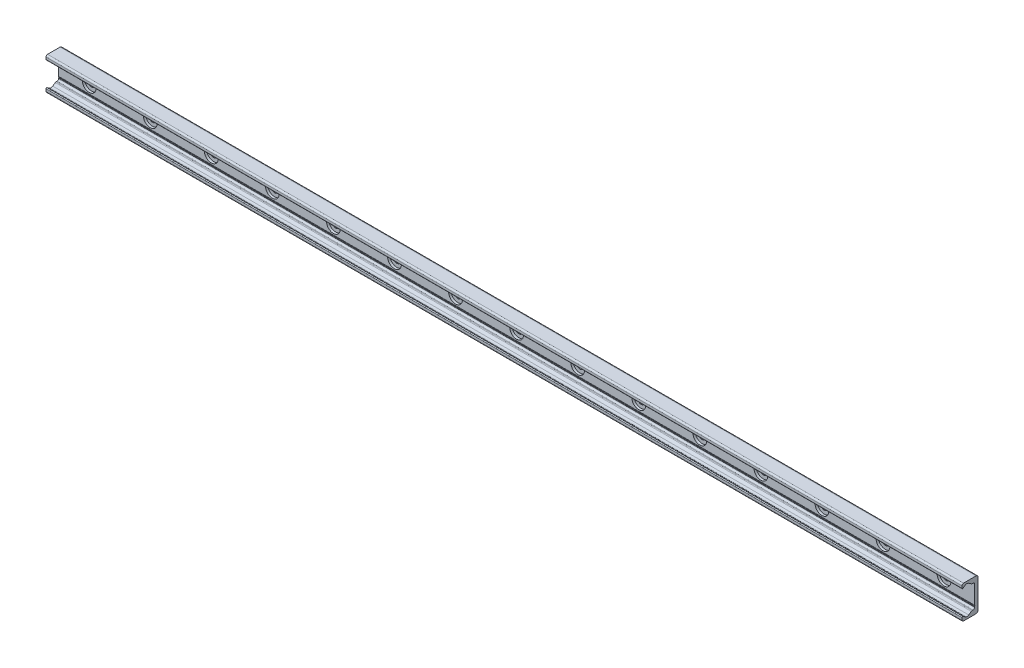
ISO-10303-21;
HEADER;
FILE_DESCRIPTION(('STEP AP214'),'2;1');
FILE_NAME('part.step','',(''),(''),'','','');
FILE_SCHEMA(('AUTOMOTIVE_DESIGN { 1 0 10303 214 1 1 1 1 }'));
ENDSEC;
DATA;
#1=APPLICATION_CONTEXT('core data for automotive mechanical design processes');
#2=APPLICATION_PROTOCOL_DEFINITION('international standard','automotive_design',2000,#1);
#3=PRODUCT_CONTEXT('',#1,'mechanical');
#4=PRODUCT('Part','Part','',(#3));
#5=PRODUCT_RELATED_PRODUCT_CATEGORY('part','',(#4));
#6=PRODUCT_DEFINITION_FORMATION('','',#4);
#7=PRODUCT_DEFINITION_CONTEXT('part definition',#1,'design');
#8=PRODUCT_DEFINITION('design','',#6,#7);
#9=PRODUCT_DEFINITION_SHAPE('','',#8);
#10=(LENGTH_UNIT() NAMED_UNIT(*) SI_UNIT(.MILLI.,.METRE.));
#11=(NAMED_UNIT(*) PLANE_ANGLE_UNIT() SI_UNIT($,.RADIAN.));
#12=(NAMED_UNIT(*) SI_UNIT($,.STERADIAN.) SOLID_ANGLE_UNIT());
#13=UNCERTAINTY_MEASURE_WITH_UNIT(LENGTH_MEASURE(1.E-05),#10,'distance_accuracy_value','');
#14=(GEOMETRIC_REPRESENTATION_CONTEXT(3) GLOBAL_UNCERTAINTY_ASSIGNED_CONTEXT((#13)) GLOBAL_UNIT_ASSIGNED_CONTEXT((#10,
#11,#12)) REPRESENTATION_CONTEXT('',''));
#15=CARTESIAN_POINT('',(0.,0.,0.));
#16=DIRECTION('',(0.,0.,1.));
#17=DIRECTION('',(1.,0.,0.));
#18=AXIS2_PLACEMENT_3D('',#15,#16,#17);
#19=CARTESIAN_POINT('',(-560.,0.,1.39999999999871));
#20=DIRECTION('',(0.,0.,1.));
#21=DIRECTION('',(1.,0.,0.));
#22=AXIS2_PLACEMENT_3D('',#19,#20,#21);
#23=PLANE('',#22);
#24=CARTESIAN_POINT('',(-560.,0.,1.39999999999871));
#25=DIRECTION('',(0.,0.,1.));
#26=DIRECTION('',(1.,0.,0.));
#27=AXIS2_PLACEMENT_3D('',#24,#25,#26);
#28=CIRCLE('',#27,4.49999999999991);
#29=CARTESIAN_POINT('',(-555.5,0.,1.39999999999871));
#30=VERTEX_POINT('',#29);
#31=EDGE_CURVE('E576',#30,#30,#28,.T.);
#32=ORIENTED_EDGE('',*,*,#31,.F.);
#33=EDGE_LOOP('',(#32));
#34=FACE_BOUND('',#33,.T.);
#35=CARTESIAN_POINT('',(-560.,0.,1.39999999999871));
#36=DIRECTION('',(0.,0.,1.));
#37=DIRECTION('',(1.,0.,0.));
#38=AXIS2_PLACEMENT_3D('',#35,#36,#37);
#39=CIRCLE('',#38,9.00000000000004);
#40=CARTESIAN_POINT('',(-551.,0.,1.39999999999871));
#41=VERTEX_POINT('',#40);
#42=EDGE_CURVE('E11',#41,#41,#39,.T.);
#43=ORIENTED_EDGE('',*,*,#42,.T.);
#44=EDGE_LOOP('',(#43));
#45=FACE_BOUND('',#44,.T.);
#46=ADVANCED_FACE('F39',(#34,#45),#23,.T.);
#47=CARTESIAN_POINT('',(-560.,0.,1.39999999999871));
#48=DIRECTION('',(0.,0.,1.));
#49=DIRECTION('',(1.,0.,0.));
#50=AXIS2_PLACEMENT_3D('',#47,#48,#49);
#51=CYLINDRICAL_SURFACE('',#50,9.00000000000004);
#52=CARTESIAN_POINT('',(-560.,0.,4.49999999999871));
#53=DIRECTION('',(0.,0.,1.));
#54=DIRECTION('',(1.,0.,0.));
#55=AXIS2_PLACEMENT_3D('',#52,#53,#54);
#56=CIRCLE('',#55,9.00000000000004);
#57=CARTESIAN_POINT('',(-551.,0.,4.49999999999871));
#58=VERTEX_POINT('',#57);
#59=EDGE_CURVE('E49',#58,#58,#56,.T.);
#60=CARTESIAN_POINT('',(-551.,0.,1.39999999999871));
#61=CARTESIAN_POINT('',(-551.,0.,1.43229166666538));
#62=CARTESIAN_POINT('',(-551.,0.,1.46458333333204));
#63=CARTESIAN_POINT('',(-551.,0.,1.52916666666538));
#64=CARTESIAN_POINT('',(-551.,0.,1.56145833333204));
#65=CARTESIAN_POINT('',(-551.,0.,1.62604166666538));
#66=CARTESIAN_POINT('',(-551.,0.,1.65833333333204));
#67=CARTESIAN_POINT('',(-551.,0.,1.72291666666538));
#68=CARTESIAN_POINT('',(-551.,0.,1.75520833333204));
#69=CARTESIAN_POINT('',(-551.,0.,1.81979166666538));
#70=CARTESIAN_POINT('',(-551.,0.,1.85208333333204));
#71=CARTESIAN_POINT('',(-551.,0.,1.91666666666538));
#72=CARTESIAN_POINT('',(-551.,0.,1.94895833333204));
#73=CARTESIAN_POINT('',(-551.,0.,2.01354166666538));
#74=CARTESIAN_POINT('',(-551.,0.,2.04583333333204));
#75=CARTESIAN_POINT('',(-551.,0.,2.11041666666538));
#76=CARTESIAN_POINT('',(-551.,0.,2.14270833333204));
#77=CARTESIAN_POINT('',(-551.,0.,2.20729166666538));
#78=CARTESIAN_POINT('',(-551.,0.,2.23958333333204));
#79=CARTESIAN_POINT('',(-551.,0.,2.30416666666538));
#80=CARTESIAN_POINT('',(-551.,0.,2.33645833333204));
#81=CARTESIAN_POINT('',(-551.,0.,2.40104166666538));
#82=CARTESIAN_POINT('',(-551.,0.,2.43333333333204));
#83=CARTESIAN_POINT('',(-551.,0.,2.49791666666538));
#84=CARTESIAN_POINT('',(-551.,0.,2.53020833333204));
#85=CARTESIAN_POINT('',(-551.,0.,2.59479166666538));
#86=CARTESIAN_POINT('',(-551.,0.,2.62708333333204));
#87=CARTESIAN_POINT('',(-551.,0.,2.69166666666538));
#88=CARTESIAN_POINT('',(-551.,0.,2.72395833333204));
#89=CARTESIAN_POINT('',(-551.,0.,2.78854166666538));
#90=CARTESIAN_POINT('',(-551.,0.,2.82083333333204));
#91=CARTESIAN_POINT('',(-551.,0.,2.88541666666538));
#92=CARTESIAN_POINT('',(-551.,0.,2.91770833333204));
#93=CARTESIAN_POINT('',(-551.,0.,2.98229166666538));
#94=CARTESIAN_POINT('',(-551.,0.,3.01458333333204));
#95=CARTESIAN_POINT('',(-551.,0.,3.07916666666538));
#96=CARTESIAN_POINT('',(-551.,0.,3.11145833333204));
#97=CARTESIAN_POINT('',(-551.,0.,3.17604166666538));
#98=CARTESIAN_POINT('',(-551.,0.,3.20833333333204));
#99=CARTESIAN_POINT('',(-551.,0.,3.27291666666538));
#100=CARTESIAN_POINT('',(-551.,0.,3.30520833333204));
#101=CARTESIAN_POINT('',(-551.,0.,3.36979166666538));
#102=CARTESIAN_POINT('',(-551.,0.,3.40208333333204));
#103=CARTESIAN_POINT('',(-551.,0.,3.46666666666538));
#104=CARTESIAN_POINT('',(-551.,0.,3.49895833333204));
#105=CARTESIAN_POINT('',(-551.,0.,3.56354166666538));
#106=CARTESIAN_POINT('',(-551.,0.,3.59583333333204));
#107=CARTESIAN_POINT('',(-551.,0.,3.66041666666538));
#108=CARTESIAN_POINT('',(-551.,0.,3.69270833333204));
#109=CARTESIAN_POINT('',(-551.,0.,3.75729166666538));
#110=CARTESIAN_POINT('',(-551.,0.,3.78958333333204));
#111=CARTESIAN_POINT('',(-551.,0.,3.85416666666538));
#112=CARTESIAN_POINT('',(-551.,0.,3.88645833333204));
#113=CARTESIAN_POINT('',(-551.,0.,3.95104166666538));
#114=CARTESIAN_POINT('',(-551.,0.,3.98333333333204));
#115=CARTESIAN_POINT('',(-551.,0.,4.04791666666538));
#116=CARTESIAN_POINT('',(-551.,0.,4.08020833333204));
#117=CARTESIAN_POINT('',(-551.,0.,4.14479166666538));
#118=CARTESIAN_POINT('',(-551.,0.,4.17708333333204));
#119=CARTESIAN_POINT('',(-551.,0.,4.24166666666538));
#120=CARTESIAN_POINT('',(-551.,0.,4.27395833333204));
#121=CARTESIAN_POINT('',(-551.,0.,4.33854166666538));
#122=CARTESIAN_POINT('',(-551.,0.,4.37083333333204));
#123=CARTESIAN_POINT('',(-551.,0.,4.43541666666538));
#124=CARTESIAN_POINT('',(-551.,0.,4.46770833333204));
#125=CARTESIAN_POINT('',(-551.,0.,4.49999999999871));
#126=B_SPLINE_CURVE_WITH_KNOTS('',3,(#60,#61,#62,#63,#64,#65,#66,#67,#68,#69,#70,#71,#72,#73,
#74,#75,#76,#77,#78,#79,#80,#81,#82,#83,#84,#85,#86,#87,#88,#89,#90,#91,#92,#93,#94,#95,#96,#97,
#98,#99,#100,#101,#102,#103,#104,#105,#106,#107,#108,#109,#110,#111,#112,#113,#114,#115,#116,
#117,#118,#119,#120,#121,#122,#123,#124,#125),.UNSPECIFIED.,.F.,.F.,(4,2,2,2,2,2,2,2,2,2,2,2,2,
2,2,2,2,2,2,2,2,2,2,2,2,2,2,2,2,2,2,2,4),(0.,0.0968750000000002,0.19375,0.290625,0.3875,
0.484375,0.58125,0.678125,0.775,0.871875,0.96875,1.065625,1.1625,1.259375,1.35625,1.453125,1.55,
1.646875,1.74375,1.840625,1.9375,2.034375,2.13125,2.228125,2.325,2.421875,2.51875,2.615625,
2.7125,2.809375,2.90625,3.003125,3.1),.UNSPECIFIED.);
#127=EDGE_CURVE('BSEAM546',#41,#58,#126,.T.);
#128=ORIENTED_EDGE('',*,*,#42,.F.);
#129=ORIENTED_EDGE('',*,*,#59,.T.);
#130=ORIENTED_EDGE('',*,*,#127,.T.);
#131=ORIENTED_EDGE('',*,*,#127,.F.);
#132=EDGE_LOOP('',(#128,#130,#129,#131));
#133=FACE_BOUND('',#132,.T.);
#134=ADVANCED_FACE('F546',(#133),#51,.F.);
#135=CARTESIAN_POINT('',(-480.,0.,1.39999999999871));
#136=DIRECTION('',(0.,0.,1.));
#137=DIRECTION('',(1.,0.,0.));
#138=AXIS2_PLACEMENT_3D('',#135,#136,#137);
#139=PLANE('',#138);
#140=CARTESIAN_POINT('',(-480.,0.,1.39999999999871));
#141=DIRECTION('',(0.,0.,1.));
#142=DIRECTION('',(1.,0.,0.));
#143=AXIS2_PLACEMENT_3D('',#140,#141,#142);
#144=CIRCLE('',#143,4.49999999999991);
#145=CARTESIAN_POINT('',(-475.5,0.,1.39999999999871));
#146=VERTEX_POINT('',#145);
#147=EDGE_CURVE('E580',#146,#146,#144,.T.);
#148=ORIENTED_EDGE('',*,*,#147,.F.);
#149=EDGE_LOOP('',(#148));
#150=FACE_BOUND('',#149,.T.);
#151=CARTESIAN_POINT('',(-480.,0.,1.39999999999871));
#152=DIRECTION('',(0.,0.,1.));
#153=DIRECTION('',(1.,0.,0.));
#154=AXIS2_PLACEMENT_3D('',#151,#152,#153);
#155=CIRCLE('',#154,9.00000000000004);
#156=CARTESIAN_POINT('',(-471.,0.,1.39999999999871));
#157=VERTEX_POINT('',#156);
#158=EDGE_CURVE('E538',#157,#157,#155,.T.);
#159=ORIENTED_EDGE('',*,*,#158,.T.);
#160=EDGE_LOOP('',(#159));
#161=FACE_BOUND('',#160,.T.);
#162=ADVANCED_FACE('F571',(#150,#161),#139,.T.);
#163=CARTESIAN_POINT('',(-480.,0.,1.39999999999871));
#164=DIRECTION('',(0.,0.,1.));
#165=DIRECTION('',(1.,0.,0.));
#166=AXIS2_PLACEMENT_3D('',#163,#164,#165);
#167=CYLINDRICAL_SURFACE('',#166,9.00000000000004);
#168=CARTESIAN_POINT('',(-480.,0.,4.49999999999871));
#169=DIRECTION('',(0.,0.,1.));
#170=DIRECTION('',(1.,0.,0.));
#171=AXIS2_PLACEMENT_3D('',#168,#169,#170);
#172=CIRCLE('',#171,9.00000000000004);
#173=CARTESIAN_POINT('',(-471.,0.,4.49999999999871));
#174=VERTEX_POINT('',#173);
#175=EDGE_CURVE('E534',#174,#174,#172,.T.);
#176=CARTESIAN_POINT('',(-471.,0.,1.39999999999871));
#177=CARTESIAN_POINT('',(-471.,0.,1.43229166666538));
#178=CARTESIAN_POINT('',(-471.,0.,1.46458333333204));
#179=CARTESIAN_POINT('',(-471.,0.,1.52916666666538));
#180=CARTESIAN_POINT('',(-471.,0.,1.56145833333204));
#181=CARTESIAN_POINT('',(-471.,0.,1.62604166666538));
#182=CARTESIAN_POINT('',(-471.,0.,1.65833333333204));
#183=CARTESIAN_POINT('',(-471.,0.,1.72291666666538));
#184=CARTESIAN_POINT('',(-471.,0.,1.75520833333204));
#185=CARTESIAN_POINT('',(-471.,0.,1.81979166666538));
#186=CARTESIAN_POINT('',(-471.,0.,1.85208333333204));
#187=CARTESIAN_POINT('',(-471.,0.,1.91666666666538));
#188=CARTESIAN_POINT('',(-471.,0.,1.94895833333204));
#189=CARTESIAN_POINT('',(-471.,0.,2.01354166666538));
#190=CARTESIAN_POINT('',(-471.,0.,2.04583333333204));
#191=CARTESIAN_POINT('',(-471.,0.,2.11041666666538));
#192=CARTESIAN_POINT('',(-471.,0.,2.14270833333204));
#193=CARTESIAN_POINT('',(-471.,0.,2.20729166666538));
#194=CARTESIAN_POINT('',(-471.,0.,2.23958333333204));
#195=CARTESIAN_POINT('',(-471.,0.,2.30416666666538));
#196=CARTESIAN_POINT('',(-471.,0.,2.33645833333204));
#197=CARTESIAN_POINT('',(-471.,0.,2.40104166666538));
#198=CARTESIAN_POINT('',(-471.,0.,2.43333333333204));
#199=CARTESIAN_POINT('',(-471.,0.,2.49791666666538));
#200=CARTESIAN_POINT('',(-471.,0.,2.53020833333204));
#201=CARTESIAN_POINT('',(-471.,0.,2.59479166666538));
#202=CARTESIAN_POINT('',(-471.,0.,2.62708333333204));
#203=CARTESIAN_POINT('',(-471.,0.,2.69166666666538));
#204=CARTESIAN_POINT('',(-471.,0.,2.72395833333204));
#205=CARTESIAN_POINT('',(-471.,0.,2.78854166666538));
#206=CARTESIAN_POINT('',(-471.,0.,2.82083333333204));
#207=CARTESIAN_POINT('',(-471.,0.,2.88541666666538));
#208=CARTESIAN_POINT('',(-471.,0.,2.91770833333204));
#209=CARTESIAN_POINT('',(-471.,0.,2.98229166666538));
#210=CARTESIAN_POINT('',(-471.,0.,3.01458333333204));
#211=CARTESIAN_POINT('',(-471.,0.,3.07916666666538));
#212=CARTESIAN_POINT('',(-471.,0.,3.11145833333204));
#213=CARTESIAN_POINT('',(-471.,0.,3.17604166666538));
#214=CARTESIAN_POINT('',(-471.,0.,3.20833333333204));
#215=CARTESIAN_POINT('',(-471.,0.,3.27291666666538));
#216=CARTESIAN_POINT('',(-471.,0.,3.30520833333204));
#217=CARTESIAN_POINT('',(-471.,0.,3.36979166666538));
#218=CARTESIAN_POINT('',(-471.,0.,3.40208333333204));
#219=CARTESIAN_POINT('',(-471.,0.,3.46666666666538));
#220=CARTESIAN_POINT('',(-471.,0.,3.49895833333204));
#221=CARTESIAN_POINT('',(-471.,0.,3.56354166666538));
#222=CARTESIAN_POINT('',(-471.,0.,3.59583333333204));
#223=CARTESIAN_POINT('',(-471.,0.,3.66041666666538));
#224=CARTESIAN_POINT('',(-471.,0.,3.69270833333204));
#225=CARTESIAN_POINT('',(-471.,0.,3.75729166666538));
#226=CARTESIAN_POINT('',(-471.,0.,3.78958333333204));
#227=CARTESIAN_POINT('',(-471.,0.,3.85416666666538));
#228=CARTESIAN_POINT('',(-471.,0.,3.88645833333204));
#229=CARTESIAN_POINT('',(-471.,0.,3.95104166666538));
#230=CARTESIAN_POINT('',(-471.,0.,3.98333333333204));
#231=CARTESIAN_POINT('',(-471.,0.,4.04791666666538));
#232=CARTESIAN_POINT('',(-471.,0.,4.08020833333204));
#233=CARTESIAN_POINT('',(-471.,0.,4.14479166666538));
#234=CARTESIAN_POINT('',(-471.,0.,4.17708333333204));
#235=CARTESIAN_POINT('',(-471.,0.,4.24166666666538));
#236=CARTESIAN_POINT('',(-471.,0.,4.27395833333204));
#237=CARTESIAN_POINT('',(-471.,0.,4.33854166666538));
#238=CARTESIAN_POINT('',(-471.,0.,4.37083333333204));
#239=CARTESIAN_POINT('',(-471.,0.,4.43541666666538));
#240=CARTESIAN_POINT('',(-471.,0.,4.46770833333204));
#241=CARTESIAN_POINT('',(-471.,0.,4.49999999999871));
#242=B_SPLINE_CURVE_WITH_KNOTS('',3,(#176,#177,#178,#179,#180,#181,#182,#183,#184,#185,#186,
#187,#188,#189,#190,#191,#192,#193,#194,#195,#196,#197,#198,#199,#200,#201,#202,#203,#204,#205,
#206,#207,#208,#209,#210,#211,#212,#213,#214,#215,#216,#217,#218,#219,#220,#221,#222,#223,#224,
#225,#226,#227,#228,#229,#230,#231,#232,#233,#234,#235,#236,#237,#238,#239,#240,#241),
.UNSPECIFIED.,.F.,.F.,(4,2,2,2,2,2,2,2,2,2,2,2,2,2,2,2,2,2,2,2,2,2,2,2,2,2,2,2,2,2,2,2,4),(0.,
0.0968750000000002,0.19375,0.290625,0.3875,0.484375,0.58125,0.678125,0.775,0.871875,0.96875,
1.065625,1.1625,1.259375,1.35625,1.453125,1.55,1.646875,1.74375,1.840625,1.9375,2.034375,
2.13125,2.228125,2.325,2.421875,2.51875,2.615625,2.7125,2.809375,2.90625,3.003125,3.1),.UNSPECIFIED.);
#243=EDGE_CURVE('BSEAM1070',#157,#174,#242,.T.);
#244=ORIENTED_EDGE('',*,*,#158,.F.);
#245=ORIENTED_EDGE('',*,*,#175,.T.);
#246=ORIENTED_EDGE('',*,*,#243,.T.);
#247=ORIENTED_EDGE('',*,*,#243,.F.);
#248=EDGE_LOOP('',(#244,#246,#245,#247));
#249=FACE_BOUND('',#248,.T.);
#250=ADVANCED_FACE('F1070',(#249),#167,.F.);
#251=CARTESIAN_POINT('',(-400.,0.,1.39999999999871));
#252=DIRECTION('',(0.,0.,1.));
#253=DIRECTION('',(1.,0.,0.));
#254=AXIS2_PLACEMENT_3D('',#251,#252,#253);
#255=PLANE('',#254);
#256=CARTESIAN_POINT('',(-400.,0.,1.39999999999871));
#257=DIRECTION('',(0.,0.,1.));
#258=DIRECTION('',(1.,0.,0.));
#259=AXIS2_PLACEMENT_3D('',#256,#257,#258);
#260=CIRCLE('',#259,4.49999999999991);
#261=CARTESIAN_POINT('',(-395.5,0.,1.39999999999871));
#262=VERTEX_POINT('',#261);
#263=EDGE_CURVE('E584',#262,#262,#260,.T.);
#264=ORIENTED_EDGE('',*,*,#263,.F.);
#265=EDGE_LOOP('',(#264));
#266=FACE_BOUND('',#265,.T.);
#267=CARTESIAN_POINT('',(-400.,0.,1.39999999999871));
#268=DIRECTION('',(0.,0.,1.));
#269=DIRECTION('',(1.,0.,0.));
#270=AXIS2_PLACEMENT_3D('',#267,#268,#269);
#271=CIRCLE('',#270,9.00000000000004);
#272=CARTESIAN_POINT('',(-391.,0.,1.39999999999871));
#273=VERTEX_POINT('',#272);
#274=EDGE_CURVE('E530',#273,#273,#271,.T.);
#275=ORIENTED_EDGE('',*,*,#274,.T.);
#276=EDGE_LOOP('',(#275));
#277=FACE_BOUND('',#276,.T.);
#278=ADVANCED_FACE('F1066',(#266,#277),#255,.T.);
#279=CARTESIAN_POINT('',(-400.,0.,1.39999999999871));
#280=DIRECTION('',(0.,0.,1.));
#281=DIRECTION('',(1.,0.,0.));
#282=AXIS2_PLACEMENT_3D('',#279,#280,#281);
#283=CYLINDRICAL_SURFACE('',#282,9.00000000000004);
#284=CARTESIAN_POINT('',(-400.,0.,4.49999999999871));
#285=DIRECTION('',(0.,0.,1.));
#286=DIRECTION('',(1.,0.,0.));
#287=AXIS2_PLACEMENT_3D('',#284,#285,#286);
#288=CIRCLE('',#287,9.00000000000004);
#289=CARTESIAN_POINT('',(-391.,0.,4.49999999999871));
#290=VERTEX_POINT('',#289);
#291=EDGE_CURVE('E526',#290,#290,#288,.T.);
#292=CARTESIAN_POINT('',(-391.,0.,1.39999999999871));
#293=CARTESIAN_POINT('',(-391.,0.,1.43229166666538));
#294=CARTESIAN_POINT('',(-391.,0.,1.46458333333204));
#295=CARTESIAN_POINT('',(-391.,0.,1.52916666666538));
#296=CARTESIAN_POINT('',(-391.,0.,1.56145833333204));
#297=CARTESIAN_POINT('',(-391.,0.,1.62604166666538));
#298=CARTESIAN_POINT('',(-391.,0.,1.65833333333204));
#299=CARTESIAN_POINT('',(-391.,0.,1.72291666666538));
#300=CARTESIAN_POINT('',(-391.,0.,1.75520833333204));
#301=CARTESIAN_POINT('',(-391.,0.,1.81979166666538));
#302=CARTESIAN_POINT('',(-391.,0.,1.85208333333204));
#303=CARTESIAN_POINT('',(-391.,0.,1.91666666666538));
#304=CARTESIAN_POINT('',(-391.,0.,1.94895833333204));
#305=CARTESIAN_POINT('',(-391.,0.,2.01354166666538));
#306=CARTESIAN_POINT('',(-391.,0.,2.04583333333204));
#307=CARTESIAN_POINT('',(-391.,0.,2.11041666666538));
#308=CARTESIAN_POINT('',(-391.,0.,2.14270833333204));
#309=CARTESIAN_POINT('',(-391.,0.,2.20729166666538));
#310=CARTESIAN_POINT('',(-391.,0.,2.23958333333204));
#311=CARTESIAN_POINT('',(-391.,0.,2.30416666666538));
#312=CARTESIAN_POINT('',(-391.,0.,2.33645833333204));
#313=CARTESIAN_POINT('',(-391.,0.,2.40104166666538));
#314=CARTESIAN_POINT('',(-391.,0.,2.43333333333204));
#315=CARTESIAN_POINT('',(-391.,0.,2.49791666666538));
#316=CARTESIAN_POINT('',(-391.,0.,2.53020833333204));
#317=CARTESIAN_POINT('',(-391.,0.,2.59479166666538));
#318=CARTESIAN_POINT('',(-391.,0.,2.62708333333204));
#319=CARTESIAN_POINT('',(-391.,0.,2.69166666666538));
#320=CARTESIAN_POINT('',(-391.,0.,2.72395833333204));
#321=CARTESIAN_POINT('',(-391.,0.,2.78854166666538));
#322=CARTESIAN_POINT('',(-391.,0.,2.82083333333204));
#323=CARTESIAN_POINT('',(-391.,0.,2.88541666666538));
#324=CARTESIAN_POINT('',(-391.,0.,2.91770833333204));
#325=CARTESIAN_POINT('',(-391.,0.,2.98229166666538));
#326=CARTESIAN_POINT('',(-391.,0.,3.01458333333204));
#327=CARTESIAN_POINT('',(-391.,0.,3.07916666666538));
#328=CARTESIAN_POINT('',(-391.,0.,3.11145833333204));
#329=CARTESIAN_POINT('',(-391.,0.,3.17604166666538));
#330=CARTESIAN_POINT('',(-391.,0.,3.20833333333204));
#331=CARTESIAN_POINT('',(-391.,0.,3.27291666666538));
#332=CARTESIAN_POINT('',(-391.,0.,3.30520833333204));
#333=CARTESIAN_POINT('',(-391.,0.,3.36979166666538));
#334=CARTESIAN_POINT('',(-391.,0.,3.40208333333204));
#335=CARTESIAN_POINT('',(-391.,0.,3.46666666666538));
#336=CARTESIAN_POINT('',(-391.,0.,3.49895833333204));
#337=CARTESIAN_POINT('',(-391.,0.,3.56354166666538));
#338=CARTESIAN_POINT('',(-391.,0.,3.59583333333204));
#339=CARTESIAN_POINT('',(-391.,0.,3.66041666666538));
#340=CARTESIAN_POINT('',(-391.,0.,3.69270833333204));
#341=CARTESIAN_POINT('',(-391.,0.,3.75729166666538));
#342=CARTESIAN_POINT('',(-391.,0.,3.78958333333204));
#343=CARTESIAN_POINT('',(-391.,0.,3.85416666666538));
#344=CARTESIAN_POINT('',(-391.,0.,3.88645833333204));
#345=CARTESIAN_POINT('',(-391.,0.,3.95104166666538));
#346=CARTESIAN_POINT('',(-391.,0.,3.98333333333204));
#347=CARTESIAN_POINT('',(-391.,0.,4.04791666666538));
#348=CARTESIAN_POINT('',(-391.,0.,4.08020833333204));
#349=CARTESIAN_POINT('',(-391.,0.,4.14479166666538));
#350=CARTESIAN_POINT('',(-391.,0.,4.17708333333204));
#351=CARTESIAN_POINT('',(-391.,0.,4.24166666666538));
#352=CARTESIAN_POINT('',(-391.,0.,4.27395833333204));
#353=CARTESIAN_POINT('',(-391.,0.,4.33854166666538));
#354=CARTESIAN_POINT('',(-391.,0.,4.37083333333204));
#355=CARTESIAN_POINT('',(-391.,0.,4.43541666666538));
#356=CARTESIAN_POINT('',(-391.,0.,4.46770833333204));
#357=CARTESIAN_POINT('',(-391.,0.,4.49999999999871));
#358=B_SPLINE_CURVE_WITH_KNOTS('',3,(#292,#293,#294,#295,#296,#297,#298,#299,#300,#301,#302,
#303,#304,#305,#306,#307,#308,#309,#310,#311,#312,#313,#314,#315,#316,#317,#318,#319,#320,#321,
#322,#323,#324,#325,#326,#327,#328,#329,#330,#331,#332,#333,#334,#335,#336,#337,#338,#339,#340,
#341,#342,#343,#344,#345,#346,#347,#348,#349,#350,#351,#352,#353,#354,#355,#356,#357),
.UNSPECIFIED.,.F.,.F.,(4,2,2,2,2,2,2,2,2,2,2,2,2,2,2,2,2,2,2,2,2,2,2,2,2,2,2,2,2,2,2,2,4),(0.,
0.0968750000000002,0.19375,0.290625,0.3875,0.484375,0.58125,0.678125,0.775,0.871875,0.96875,
1.065625,1.1625,1.259375,1.35625,1.453125,1.55,1.646875,1.74375,1.840625,1.9375,2.034375,
2.13125,2.228125,2.325,2.421875,2.51875,2.615625,2.7125,2.809375,2.90625,3.003125,3.1),.UNSPECIFIED.);
#359=EDGE_CURVE('BSEAM1062',#273,#290,#358,.T.);
#360=ORIENTED_EDGE('',*,*,#274,.F.);
#361=ORIENTED_EDGE('',*,*,#291,.T.);
#362=ORIENTED_EDGE('',*,*,#359,.T.);
#363=ORIENTED_EDGE('',*,*,#359,.F.);
#364=EDGE_LOOP('',(#360,#362,#361,#363));
#365=FACE_BOUND('',#364,.T.);
#366=ADVANCED_FACE('F1062',(#365),#283,.F.);
#367=CARTESIAN_POINT('',(-320.,0.,1.39999999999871));
#368=DIRECTION('',(0.,0.,1.));
#369=DIRECTION('',(1.,0.,0.));
#370=AXIS2_PLACEMENT_3D('',#367,#368,#369);
#371=PLANE('',#370);
#372=CARTESIAN_POINT('',(-320.,0.,1.39999999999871));
#373=DIRECTION('',(0.,0.,1.));
#374=DIRECTION('',(1.,0.,0.));
#375=AXIS2_PLACEMENT_3D('',#372,#373,#374);
#376=CIRCLE('',#375,4.49999999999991);
#377=CARTESIAN_POINT('',(-315.5,0.,1.39999999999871));
#378=VERTEX_POINT('',#377);
#379=EDGE_CURVE('E596',#378,#378,#376,.T.);
#380=ORIENTED_EDGE('',*,*,#379,.F.);
#381=EDGE_LOOP('',(#380));
#382=FACE_BOUND('',#381,.T.);
#383=CARTESIAN_POINT('',(-320.,0.,1.39999999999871));
#384=DIRECTION('',(0.,0.,1.));
#385=DIRECTION('',(1.,0.,0.));
#386=AXIS2_PLACEMENT_3D('',#383,#384,#385);
#387=CIRCLE('',#386,9.00000000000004);
#388=CARTESIAN_POINT('',(-311.,0.,1.39999999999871));
#389=VERTEX_POINT('',#388);
#390=EDGE_CURVE('E522',#389,#389,#387,.T.);
#391=ORIENTED_EDGE('',*,*,#390,.T.);
#392=EDGE_LOOP('',(#391));
#393=FACE_BOUND('',#392,.T.);
#394=ADVANCED_FACE('F1058',(#382,#393),#371,.T.);
#395=CARTESIAN_POINT('',(-320.,0.,1.39999999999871));
#396=DIRECTION('',(0.,0.,1.));
#397=DIRECTION('',(1.,0.,0.));
#398=AXIS2_PLACEMENT_3D('',#395,#396,#397);
#399=CYLINDRICAL_SURFACE('',#398,9.00000000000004);
#400=CARTESIAN_POINT('',(-320.,0.,4.49999999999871));
#401=DIRECTION('',(0.,0.,1.));
#402=DIRECTION('',(1.,0.,0.));
#403=AXIS2_PLACEMENT_3D('',#400,#401,#402);
#404=CIRCLE('',#403,9.00000000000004);
#405=CARTESIAN_POINT('',(-311.,0.,4.49999999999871));
#406=VERTEX_POINT('',#405);
#407=EDGE_CURVE('E518',#406,#406,#404,.T.);
#408=CARTESIAN_POINT('',(-311.,0.,1.39999999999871));
#409=CARTESIAN_POINT('',(-311.,0.,1.43229166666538));
#410=CARTESIAN_POINT('',(-311.,0.,1.46458333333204));
#411=CARTESIAN_POINT('',(-311.,0.,1.52916666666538));
#412=CARTESIAN_POINT('',(-311.,0.,1.56145833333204));
#413=CARTESIAN_POINT('',(-311.,0.,1.62604166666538));
#414=CARTESIAN_POINT('',(-311.,0.,1.65833333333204));
#415=CARTESIAN_POINT('',(-311.,0.,1.72291666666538));
#416=CARTESIAN_POINT('',(-311.,0.,1.75520833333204));
#417=CARTESIAN_POINT('',(-311.,0.,1.81979166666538));
#418=CARTESIAN_POINT('',(-311.,0.,1.85208333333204));
#419=CARTESIAN_POINT('',(-311.,0.,1.91666666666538));
#420=CARTESIAN_POINT('',(-311.,0.,1.94895833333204));
#421=CARTESIAN_POINT('',(-311.,0.,2.01354166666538));
#422=CARTESIAN_POINT('',(-311.,0.,2.04583333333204));
#423=CARTESIAN_POINT('',(-311.,0.,2.11041666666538));
#424=CARTESIAN_POINT('',(-311.,0.,2.14270833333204));
#425=CARTESIAN_POINT('',(-311.,0.,2.20729166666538));
#426=CARTESIAN_POINT('',(-311.,0.,2.23958333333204));
#427=CARTESIAN_POINT('',(-311.,0.,2.30416666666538));
#428=CARTESIAN_POINT('',(-311.,0.,2.33645833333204));
#429=CARTESIAN_POINT('',(-311.,0.,2.40104166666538));
#430=CARTESIAN_POINT('',(-311.,0.,2.43333333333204));
#431=CARTESIAN_POINT('',(-311.,0.,2.49791666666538));
#432=CARTESIAN_POINT('',(-311.,0.,2.53020833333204));
#433=CARTESIAN_POINT('',(-311.,0.,2.59479166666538));
#434=CARTESIAN_POINT('',(-311.,0.,2.62708333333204));
#435=CARTESIAN_POINT('',(-311.,0.,2.69166666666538));
#436=CARTESIAN_POINT('',(-311.,0.,2.72395833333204));
#437=CARTESIAN_POINT('',(-311.,0.,2.78854166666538));
#438=CARTESIAN_POINT('',(-311.,0.,2.82083333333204));
#439=CARTESIAN_POINT('',(-311.,0.,2.88541666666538));
#440=CARTESIAN_POINT('',(-311.,0.,2.91770833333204));
#441=CARTESIAN_POINT('',(-311.,0.,2.98229166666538));
#442=CARTESIAN_POINT('',(-311.,0.,3.01458333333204));
#443=CARTESIAN_POINT('',(-311.,0.,3.07916666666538));
#444=CARTESIAN_POINT('',(-311.,0.,3.11145833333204));
#445=CARTESIAN_POINT('',(-311.,0.,3.17604166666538));
#446=CARTESIAN_POINT('',(-311.,0.,3.20833333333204));
#447=CARTESIAN_POINT('',(-311.,0.,3.27291666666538));
#448=CARTESIAN_POINT('',(-311.,0.,3.30520833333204));
#449=CARTESIAN_POINT('',(-311.,0.,3.36979166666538));
#450=CARTESIAN_POINT('',(-311.,0.,3.40208333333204));
#451=CARTESIAN_POINT('',(-311.,0.,3.46666666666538));
#452=CARTESIAN_POINT('',(-311.,0.,3.49895833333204));
#453=CARTESIAN_POINT('',(-311.,0.,3.56354166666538));
#454=CARTESIAN_POINT('',(-311.,0.,3.59583333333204));
#455=CARTESIAN_POINT('',(-311.,0.,3.66041666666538));
#456=CARTESIAN_POINT('',(-311.,0.,3.69270833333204));
#457=CARTESIAN_POINT('',(-311.,0.,3.75729166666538));
#458=CARTESIAN_POINT('',(-311.,0.,3.78958333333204));
#459=CARTESIAN_POINT('',(-311.,0.,3.85416666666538));
#460=CARTESIAN_POINT('',(-311.,0.,3.88645833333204));
#461=CARTESIAN_POINT('',(-311.,0.,3.95104166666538));
#462=CARTESIAN_POINT('',(-311.,0.,3.98333333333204));
#463=CARTESIAN_POINT('',(-311.,0.,4.04791666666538));
#464=CARTESIAN_POINT('',(-311.,0.,4.08020833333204));
#465=CARTESIAN_POINT('',(-311.,0.,4.14479166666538));
#466=CARTESIAN_POINT('',(-311.,0.,4.17708333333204));
#467=CARTESIAN_POINT('',(-311.,0.,4.24166666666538));
#468=CARTESIAN_POINT('',(-311.,0.,4.27395833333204));
#469=CARTESIAN_POINT('',(-311.,0.,4.33854166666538));
#470=CARTESIAN_POINT('',(-311.,0.,4.37083333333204));
#471=CARTESIAN_POINT('',(-311.,0.,4.43541666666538));
#472=CARTESIAN_POINT('',(-311.,0.,4.46770833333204));
#473=CARTESIAN_POINT('',(-311.,0.,4.49999999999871));
#474=B_SPLINE_CURVE_WITH_KNOTS('',3,(#408,#409,#410,#411,#412,#413,#414,#415,#416,#417,#418,
#419,#420,#421,#422,#423,#424,#425,#426,#427,#428,#429,#430,#431,#432,#433,#434,#435,#436,#437,
#438,#439,#440,#441,#442,#443,#444,#445,#446,#447,#448,#449,#450,#451,#452,#453,#454,#455,#456,
#457,#458,#459,#460,#461,#462,#463,#464,#465,#466,#467,#468,#469,#470,#471,#472,#473),
.UNSPECIFIED.,.F.,.F.,(4,2,2,2,2,2,2,2,2,2,2,2,2,2,2,2,2,2,2,2,2,2,2,2,2,2,2,2,2,2,2,2,4),(0.,
0.0968750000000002,0.19375,0.290625,0.3875,0.484375,0.58125,0.678125,0.775,0.871875,0.96875,
1.065625,1.1625,1.259375,1.35625,1.453125,1.55,1.646875,1.74375,1.840625,1.9375,2.034375,
2.13125,2.228125,2.325,2.421875,2.51875,2.615625,2.7125,2.809375,2.90625,3.003125,3.1),.UNSPECIFIED.);
#475=EDGE_CURVE('BSEAM1054',#389,#406,#474,.T.);
#476=ORIENTED_EDGE('',*,*,#390,.F.);
#477=ORIENTED_EDGE('',*,*,#407,.T.);
#478=ORIENTED_EDGE('',*,*,#475,.T.);
#479=ORIENTED_EDGE('',*,*,#475,.F.);
#480=EDGE_LOOP('',(#476,#478,#477,#479));
#481=FACE_BOUND('',#480,.T.);
#482=ADVANCED_FACE('F1054',(#481),#399,.F.);
#483=CARTESIAN_POINT('',(-240.,0.,1.39999999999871));
#484=DIRECTION('',(0.,0.,1.));
#485=DIRECTION('',(1.,0.,0.));
#486=AXIS2_PLACEMENT_3D('',#483,#484,#485);
#487=PLANE('',#486);
#488=CARTESIAN_POINT('',(-240.,0.,1.39999999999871));
#489=DIRECTION('',(0.,0.,1.));
#490=DIRECTION('',(1.,0.,0.));
#491=AXIS2_PLACEMENT_3D('',#488,#489,#490);
#492=CIRCLE('',#491,4.49999999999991);
#493=CARTESIAN_POINT('',(-235.5,0.,1.39999999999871));
#494=VERTEX_POINT('',#493);
#495=EDGE_CURVE('E600',#494,#494,#492,.T.);
#496=ORIENTED_EDGE('',*,*,#495,.F.);
#497=EDGE_LOOP('',(#496));
#498=FACE_BOUND('',#497,.T.);
#499=CARTESIAN_POINT('',(-240.,0.,1.39999999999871));
#500=DIRECTION('',(0.,0.,1.));
#501=DIRECTION('',(1.,0.,0.));
#502=AXIS2_PLACEMENT_3D('',#499,#500,#501);
#503=CIRCLE('',#502,9.00000000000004);
#504=CARTESIAN_POINT('',(-231.,0.,1.39999999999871));
#505=VERTEX_POINT('',#504);
#506=EDGE_CURVE('E514',#505,#505,#503,.T.);
#507=ORIENTED_EDGE('',*,*,#506,.T.);
#508=EDGE_LOOP('',(#507));
#509=FACE_BOUND('',#508,.T.);
#510=ADVANCED_FACE('F1050',(#498,#509),#487,.T.);
#511=CARTESIAN_POINT('',(-240.,0.,1.39999999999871));
#512=DIRECTION('',(0.,0.,1.));
#513=DIRECTION('',(1.,0.,0.));
#514=AXIS2_PLACEMENT_3D('',#511,#512,#513);
#515=CYLINDRICAL_SURFACE('',#514,9.00000000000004);
#516=CARTESIAN_POINT('',(-240.,0.,4.49999999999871));
#517=DIRECTION('',(0.,0.,1.));
#518=DIRECTION('',(1.,0.,0.));
#519=AXIS2_PLACEMENT_3D('',#516,#517,#518);
#520=CIRCLE('',#519,9.00000000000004);
#521=CARTESIAN_POINT('',(-231.,0.,4.49999999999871));
#522=VERTEX_POINT('',#521);
#523=EDGE_CURVE('E510',#522,#522,#520,.T.);
#524=CARTESIAN_POINT('',(-231.,0.,1.39999999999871));
#525=CARTESIAN_POINT('',(-231.,0.,1.43229166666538));
#526=CARTESIAN_POINT('',(-231.,0.,1.46458333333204));
#527=CARTESIAN_POINT('',(-231.,0.,1.52916666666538));
#528=CARTESIAN_POINT('',(-231.,0.,1.56145833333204));
#529=CARTESIAN_POINT('',(-231.,0.,1.62604166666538));
#530=CARTESIAN_POINT('',(-231.,0.,1.65833333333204));
#531=CARTESIAN_POINT('',(-231.,0.,1.72291666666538));
#532=CARTESIAN_POINT('',(-231.,0.,1.75520833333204));
#533=CARTESIAN_POINT('',(-231.,0.,1.81979166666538));
#534=CARTESIAN_POINT('',(-231.,0.,1.85208333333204));
#535=CARTESIAN_POINT('',(-231.,0.,1.91666666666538));
#536=CARTESIAN_POINT('',(-231.,0.,1.94895833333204));
#537=CARTESIAN_POINT('',(-231.,0.,2.01354166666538));
#538=CARTESIAN_POINT('',(-231.,0.,2.04583333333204));
#539=CARTESIAN_POINT('',(-231.,0.,2.11041666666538));
#540=CARTESIAN_POINT('',(-231.,0.,2.14270833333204));
#541=CARTESIAN_POINT('',(-231.,0.,2.20729166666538));
#542=CARTESIAN_POINT('',(-231.,0.,2.23958333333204));
#543=CARTESIAN_POINT('',(-231.,0.,2.30416666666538));
#544=CARTESIAN_POINT('',(-231.,0.,2.33645833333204));
#545=CARTESIAN_POINT('',(-231.,0.,2.40104166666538));
#546=CARTESIAN_POINT('',(-231.,0.,2.43333333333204));
#547=CARTESIAN_POINT('',(-231.,0.,2.49791666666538));
#548=CARTESIAN_POINT('',(-231.,0.,2.53020833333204));
#549=CARTESIAN_POINT('',(-231.,0.,2.59479166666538));
#550=CARTESIAN_POINT('',(-231.,0.,2.62708333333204));
#551=CARTESIAN_POINT('',(-231.,0.,2.69166666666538));
#552=CARTESIAN_POINT('',(-231.,0.,2.72395833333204));
#553=CARTESIAN_POINT('',(-231.,0.,2.78854166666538));
#554=CARTESIAN_POINT('',(-231.,0.,2.82083333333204));
#555=CARTESIAN_POINT('',(-231.,0.,2.88541666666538));
#556=CARTESIAN_POINT('',(-231.,0.,2.91770833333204));
#557=CARTESIAN_POINT('',(-231.,0.,2.98229166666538));
#558=CARTESIAN_POINT('',(-231.,0.,3.01458333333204));
#559=CARTESIAN_POINT('',(-231.,0.,3.07916666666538));
#560=CARTESIAN_POINT('',(-231.,0.,3.11145833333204));
#561=CARTESIAN_POINT('',(-231.,0.,3.17604166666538));
#562=CARTESIAN_POINT('',(-231.,0.,3.20833333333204));
#563=CARTESIAN_POINT('',(-231.,0.,3.27291666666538));
#564=CARTESIAN_POINT('',(-231.,0.,3.30520833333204));
#565=CARTESIAN_POINT('',(-231.,0.,3.36979166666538));
#566=CARTESIAN_POINT('',(-231.,0.,3.40208333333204));
#567=CARTESIAN_POINT('',(-231.,0.,3.46666666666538));
#568=CARTESIAN_POINT('',(-231.,0.,3.49895833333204));
#569=CARTESIAN_POINT('',(-231.,0.,3.56354166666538));
#570=CARTESIAN_POINT('',(-231.,0.,3.59583333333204));
#571=CARTESIAN_POINT('',(-231.,0.,3.66041666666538));
#572=CARTESIAN_POINT('',(-231.,0.,3.69270833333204));
#573=CARTESIAN_POINT('',(-231.,0.,3.75729166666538));
#574=CARTESIAN_POINT('',(-231.,0.,3.78958333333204));
#575=CARTESIAN_POINT('',(-231.,0.,3.85416666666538));
#576=CARTESIAN_POINT('',(-231.,0.,3.88645833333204));
#577=CARTESIAN_POINT('',(-231.,0.,3.95104166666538));
#578=CARTESIAN_POINT('',(-231.,0.,3.98333333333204));
#579=CARTESIAN_POINT('',(-231.,0.,4.04791666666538));
#580=CARTESIAN_POINT('',(-231.,0.,4.08020833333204));
#581=CARTESIAN_POINT('',(-231.,0.,4.14479166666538));
#582=CARTESIAN_POINT('',(-231.,0.,4.17708333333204));
#583=CARTESIAN_POINT('',(-231.,0.,4.24166666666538));
#584=CARTESIAN_POINT('',(-231.,0.,4.27395833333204));
#585=CARTESIAN_POINT('',(-231.,0.,4.33854166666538));
#586=CARTESIAN_POINT('',(-231.,0.,4.37083333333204));
#587=CARTESIAN_POINT('',(-231.,0.,4.43541666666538));
#588=CARTESIAN_POINT('',(-231.,0.,4.46770833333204));
#589=CARTESIAN_POINT('',(-231.,0.,4.49999999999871));
#590=B_SPLINE_CURVE_WITH_KNOTS('',3,(#524,#525,#526,#527,#528,#529,#530,#531,#532,#533,#534,
#535,#536,#537,#538,#539,#540,#541,#542,#543,#544,#545,#546,#547,#548,#549,#550,#551,#552,#553,
#554,#555,#556,#557,#558,#559,#560,#561,#562,#563,#564,#565,#566,#567,#568,#569,#570,#571,#572,
#573,#574,#575,#576,#577,#578,#579,#580,#581,#582,#583,#584,#585,#586,#587,#588,#589),
.UNSPECIFIED.,.F.,.F.,(4,2,2,2,2,2,2,2,2,2,2,2,2,2,2,2,2,2,2,2,2,2,2,2,2,2,2,2,2,2,2,2,4),(0.,
0.0968750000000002,0.19375,0.290625,0.3875,0.484375,0.58125,0.678125,0.775,0.871875,0.96875,
1.065625,1.1625,1.259375,1.35625,1.453125,1.55,1.646875,1.74375,1.840625,1.9375,2.034375,
2.13125,2.228125,2.325,2.421875,2.51875,2.615625,2.7125,2.809375,2.90625,3.003125,3.1),.UNSPECIFIED.);
#591=EDGE_CURVE('BSEAM1046',#505,#522,#590,.T.);
#592=ORIENTED_EDGE('',*,*,#506,.F.);
#593=ORIENTED_EDGE('',*,*,#523,.T.);
#594=ORIENTED_EDGE('',*,*,#591,.T.);
#595=ORIENTED_EDGE('',*,*,#591,.F.);
#596=EDGE_LOOP('',(#592,#594,#593,#595));
#597=FACE_BOUND('',#596,.T.);
#598=ADVANCED_FACE('F1046',(#597),#515,.F.);
#599=CARTESIAN_POINT('',(-160.,0.,1.39999999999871));
#600=DIRECTION('',(0.,0.,1.));
#601=DIRECTION('',(1.,0.,0.));
#602=AXIS2_PLACEMENT_3D('',#599,#600,#601);
#603=PLANE('',#602);
#604=CARTESIAN_POINT('',(-160.,0.,1.39999999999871));
#605=DIRECTION('',(0.,0.,1.));
#606=DIRECTION('',(1.,0.,0.));
#607=AXIS2_PLACEMENT_3D('',#604,#605,#606);
#608=CIRCLE('',#607,4.49999999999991);
#609=CARTESIAN_POINT('',(-155.5,0.,1.39999999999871));
#610=VERTEX_POINT('',#609);
#611=EDGE_CURVE('E604',#610,#610,#608,.T.);
#612=ORIENTED_EDGE('',*,*,#611,.F.);
#613=EDGE_LOOP('',(#612));
#614=FACE_BOUND('',#613,.T.);
#615=CARTESIAN_POINT('',(-160.,0.,1.39999999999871));
#616=DIRECTION('',(0.,0.,1.));
#617=DIRECTION('',(1.,0.,0.));
#618=AXIS2_PLACEMENT_3D('',#615,#616,#617);
#619=CIRCLE('',#618,9.00000000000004);
#620=CARTESIAN_POINT('',(-151.,0.,1.39999999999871));
#621=VERTEX_POINT('',#620);
#622=EDGE_CURVE('E506',#621,#621,#619,.T.);
#623=ORIENTED_EDGE('',*,*,#622,.T.);
#624=EDGE_LOOP('',(#623));
#625=FACE_BOUND('',#624,.T.);
#626=ADVANCED_FACE('F1042',(#614,#625),#603,.T.);
#627=CARTESIAN_POINT('',(-160.,0.,1.39999999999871));
#628=DIRECTION('',(0.,0.,1.));
#629=DIRECTION('',(1.,0.,0.));
#630=AXIS2_PLACEMENT_3D('',#627,#628,#629);
#631=CYLINDRICAL_SURFACE('',#630,9.00000000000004);
#632=CARTESIAN_POINT('',(-160.,0.,4.49999999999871));
#633=DIRECTION('',(0.,0.,1.));
#634=DIRECTION('',(1.,0.,0.));
#635=AXIS2_PLACEMENT_3D('',#632,#633,#634);
#636=CIRCLE('',#635,9.00000000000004);
#637=CARTESIAN_POINT('',(-151.,0.,4.49999999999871));
#638=VERTEX_POINT('',#637);
#639=EDGE_CURVE('E502',#638,#638,#636,.T.);
#640=CARTESIAN_POINT('',(-151.,0.,1.39999999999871));
#641=CARTESIAN_POINT('',(-151.,0.,1.43229166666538));
#642=CARTESIAN_POINT('',(-151.,0.,1.46458333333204));
#643=CARTESIAN_POINT('',(-151.,0.,1.52916666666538));
#644=CARTESIAN_POINT('',(-151.,0.,1.56145833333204));
#645=CARTESIAN_POINT('',(-151.,0.,1.62604166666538));
#646=CARTESIAN_POINT('',(-151.,0.,1.65833333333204));
#647=CARTESIAN_POINT('',(-151.,0.,1.72291666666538));
#648=CARTESIAN_POINT('',(-151.,0.,1.75520833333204));
#649=CARTESIAN_POINT('',(-151.,0.,1.81979166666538));
#650=CARTESIAN_POINT('',(-151.,0.,1.85208333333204));
#651=CARTESIAN_POINT('',(-151.,0.,1.91666666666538));
#652=CARTESIAN_POINT('',(-151.,0.,1.94895833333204));
#653=CARTESIAN_POINT('',(-151.,0.,2.01354166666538));
#654=CARTESIAN_POINT('',(-151.,0.,2.04583333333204));
#655=CARTESIAN_POINT('',(-151.,0.,2.11041666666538));
#656=CARTESIAN_POINT('',(-151.,0.,2.14270833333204));
#657=CARTESIAN_POINT('',(-151.,0.,2.20729166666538));
#658=CARTESIAN_POINT('',(-151.,0.,2.23958333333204));
#659=CARTESIAN_POINT('',(-151.,0.,2.30416666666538));
#660=CARTESIAN_POINT('',(-151.,0.,2.33645833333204));
#661=CARTESIAN_POINT('',(-151.,0.,2.40104166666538));
#662=CARTESIAN_POINT('',(-151.,0.,2.43333333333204));
#663=CARTESIAN_POINT('',(-151.,0.,2.49791666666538));
#664=CARTESIAN_POINT('',(-151.,0.,2.53020833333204));
#665=CARTESIAN_POINT('',(-151.,0.,2.59479166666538));
#666=CARTESIAN_POINT('',(-151.,0.,2.62708333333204));
#667=CARTESIAN_POINT('',(-151.,0.,2.69166666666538));
#668=CARTESIAN_POINT('',(-151.,0.,2.72395833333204));
#669=CARTESIAN_POINT('',(-151.,0.,2.78854166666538));
#670=CARTESIAN_POINT('',(-151.,0.,2.82083333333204));
#671=CARTESIAN_POINT('',(-151.,0.,2.88541666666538));
#672=CARTESIAN_POINT('',(-151.,0.,2.91770833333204));
#673=CARTESIAN_POINT('',(-151.,0.,2.98229166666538));
#674=CARTESIAN_POINT('',(-151.,0.,3.01458333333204));
#675=CARTESIAN_POINT('',(-151.,0.,3.07916666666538));
#676=CARTESIAN_POINT('',(-151.,0.,3.11145833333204));
#677=CARTESIAN_POINT('',(-151.,0.,3.17604166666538));
#678=CARTESIAN_POINT('',(-151.,0.,3.20833333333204));
#679=CARTESIAN_POINT('',(-151.,0.,3.27291666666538));
#680=CARTESIAN_POINT('',(-151.,0.,3.30520833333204));
#681=CARTESIAN_POINT('',(-151.,0.,3.36979166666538));
#682=CARTESIAN_POINT('',(-151.,0.,3.40208333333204));
#683=CARTESIAN_POINT('',(-151.,0.,3.46666666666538));
#684=CARTESIAN_POINT('',(-151.,0.,3.49895833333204));
#685=CARTESIAN_POINT('',(-151.,0.,3.56354166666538));
#686=CARTESIAN_POINT('',(-151.,0.,3.59583333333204));
#687=CARTESIAN_POINT('',(-151.,0.,3.66041666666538));
#688=CARTESIAN_POINT('',(-151.,0.,3.69270833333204));
#689=CARTESIAN_POINT('',(-151.,0.,3.75729166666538));
#690=CARTESIAN_POINT('',(-151.,0.,3.78958333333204));
#691=CARTESIAN_POINT('',(-151.,0.,3.85416666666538));
#692=CARTESIAN_POINT('',(-151.,0.,3.88645833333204));
#693=CARTESIAN_POINT('',(-151.,0.,3.95104166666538));
#694=CARTESIAN_POINT('',(-151.,0.,3.98333333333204));
#695=CARTESIAN_POINT('',(-151.,0.,4.04791666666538));
#696=CARTESIAN_POINT('',(-151.,0.,4.08020833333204));
#697=CARTESIAN_POINT('',(-151.,0.,4.14479166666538));
#698=CARTESIAN_POINT('',(-151.,0.,4.17708333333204));
#699=CARTESIAN_POINT('',(-151.,0.,4.24166666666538));
#700=CARTESIAN_POINT('',(-151.,0.,4.27395833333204));
#701=CARTESIAN_POINT('',(-151.,0.,4.33854166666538));
#702=CARTESIAN_POINT('',(-151.,0.,4.37083333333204));
#703=CARTESIAN_POINT('',(-151.,0.,4.43541666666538));
#704=CARTESIAN_POINT('',(-151.,0.,4.46770833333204));
#705=CARTESIAN_POINT('',(-151.,0.,4.49999999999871));
#706=B_SPLINE_CURVE_WITH_KNOTS('',3,(#640,#641,#642,#643,#644,#645,#646,#647,#648,#649,#650,
#651,#652,#653,#654,#655,#656,#657,#658,#659,#660,#661,#662,#663,#664,#665,#666,#667,#668,#669,
#670,#671,#672,#673,#674,#675,#676,#677,#678,#679,#680,#681,#682,#683,#684,#685,#686,#687,#688,
#689,#690,#691,#692,#693,#694,#695,#696,#697,#698,#699,#700,#701,#702,#703,#704,#705),
.UNSPECIFIED.,.F.,.F.,(4,2,2,2,2,2,2,2,2,2,2,2,2,2,2,2,2,2,2,2,2,2,2,2,2,2,2,2,2,2,2,2,4),(0.,
0.0968750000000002,0.19375,0.290625,0.3875,0.484375,0.58125,0.678125,0.775,0.871875,0.96875,
1.065625,1.1625,1.259375,1.35625,1.453125,1.55,1.646875,1.74375,1.840625,1.9375,2.034375,
2.13125,2.228125,2.325,2.421875,2.51875,2.615625,2.7125,2.809375,2.90625,3.003125,3.1),.UNSPECIFIED.);
#707=EDGE_CURVE('BSEAM1038',#621,#638,#706,.T.);
#708=ORIENTED_EDGE('',*,*,#622,.F.);
#709=ORIENTED_EDGE('',*,*,#639,.T.);
#710=ORIENTED_EDGE('',*,*,#707,.T.);
#711=ORIENTED_EDGE('',*,*,#707,.F.);
#712=EDGE_LOOP('',(#708,#710,#709,#711));
#713=FACE_BOUND('',#712,.T.);
#714=ADVANCED_FACE('F1038',(#713),#631,.F.);
#715=CARTESIAN_POINT('',(-80.0000000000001,0.,1.39999999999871));
#716=DIRECTION('',(0.,0.,1.));
#717=DIRECTION('',(1.,0.,0.));
#718=AXIS2_PLACEMENT_3D('',#715,#716,#717);
#719=PLANE('',#718);
#720=CARTESIAN_POINT('',(-80.0000000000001,0.,1.39999999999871));
#721=DIRECTION('',(0.,0.,1.));
#722=DIRECTION('',(1.,0.,0.));
#723=AXIS2_PLACEMENT_3D('',#720,#721,#722);
#724=CIRCLE('',#723,4.49999999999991);
#725=CARTESIAN_POINT('',(-75.5000000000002,0.,1.39999999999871));
#726=VERTEX_POINT('',#725);
#727=EDGE_CURVE('E608',#726,#726,#724,.T.);
#728=ORIENTED_EDGE('',*,*,#727,.F.);
#729=EDGE_LOOP('',(#728));
#730=FACE_BOUND('',#729,.T.);
#731=CARTESIAN_POINT('',(-80.0000000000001,0.,1.39999999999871));
#732=DIRECTION('',(0.,0.,1.));
#733=DIRECTION('',(1.,0.,0.));
#734=AXIS2_PLACEMENT_3D('',#731,#732,#733);
#735=CIRCLE('',#734,9.00000000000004);
#736=CARTESIAN_POINT('',(-71.0000000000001,0.,1.39999999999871));
#737=VERTEX_POINT('',#736);
#738=EDGE_CURVE('E498',#737,#737,#735,.T.);
#739=ORIENTED_EDGE('',*,*,#738,.T.);
#740=EDGE_LOOP('',(#739));
#741=FACE_BOUND('',#740,.T.);
#742=ADVANCED_FACE('F1034',(#730,#741),#719,.T.);
#743=CARTESIAN_POINT('',(-80.0000000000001,0.,1.39999999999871));
#744=DIRECTION('',(0.,0.,1.));
#745=DIRECTION('',(1.,0.,0.));
#746=AXIS2_PLACEMENT_3D('',#743,#744,#745);
#747=CYLINDRICAL_SURFACE('',#746,9.00000000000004);
#748=CARTESIAN_POINT('',(-80.0000000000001,0.,4.49999999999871));
#749=DIRECTION('',(0.,0.,1.));
#750=DIRECTION('',(1.,0.,0.));
#751=AXIS2_PLACEMENT_3D('',#748,#749,#750);
#752=CIRCLE('',#751,9.00000000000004);
#753=CARTESIAN_POINT('',(-71.0000000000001,0.,4.49999999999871));
#754=VERTEX_POINT('',#753);
#755=EDGE_CURVE('E494',#754,#754,#752,.T.);
#756=CARTESIAN_POINT('',(-71.0000000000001,0.,1.39999999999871));
#757=CARTESIAN_POINT('',(-71.0000000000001,0.,1.43229166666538));
#758=CARTESIAN_POINT('',(-71.0000000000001,0.,1.46458333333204));
#759=CARTESIAN_POINT('',(-71.0000000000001,0.,1.52916666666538));
#760=CARTESIAN_POINT('',(-71.0000000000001,0.,1.56145833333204));
#761=CARTESIAN_POINT('',(-71.0000000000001,0.,1.62604166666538));
#762=CARTESIAN_POINT('',(-71.0000000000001,0.,1.65833333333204));
#763=CARTESIAN_POINT('',(-71.0000000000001,0.,1.72291666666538));
#764=CARTESIAN_POINT('',(-71.0000000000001,0.,1.75520833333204));
#765=CARTESIAN_POINT('',(-71.0000000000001,0.,1.81979166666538));
#766=CARTESIAN_POINT('',(-71.0000000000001,0.,1.85208333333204));
#767=CARTESIAN_POINT('',(-71.0000000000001,0.,1.91666666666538));
#768=CARTESIAN_POINT('',(-71.0000000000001,0.,1.94895833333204));
#769=CARTESIAN_POINT('',(-71.0000000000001,0.,2.01354166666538));
#770=CARTESIAN_POINT('',(-71.0000000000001,0.,2.04583333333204));
#771=CARTESIAN_POINT('',(-71.0000000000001,0.,2.11041666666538));
#772=CARTESIAN_POINT('',(-71.0000000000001,0.,2.14270833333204));
#773=CARTESIAN_POINT('',(-71.0000000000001,0.,2.20729166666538));
#774=CARTESIAN_POINT('',(-71.0000000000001,0.,2.23958333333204));
#775=CARTESIAN_POINT('',(-71.0000000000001,0.,2.30416666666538));
#776=CARTESIAN_POINT('',(-71.0000000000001,0.,2.33645833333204));
#777=CARTESIAN_POINT('',(-71.0000000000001,0.,2.40104166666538));
#778=CARTESIAN_POINT('',(-71.0000000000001,0.,2.43333333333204));
#779=CARTESIAN_POINT('',(-71.0000000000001,0.,2.49791666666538));
#780=CARTESIAN_POINT('',(-71.0000000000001,0.,2.53020833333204));
#781=CARTESIAN_POINT('',(-71.0000000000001,0.,2.59479166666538));
#782=CARTESIAN_POINT('',(-71.0000000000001,0.,2.62708333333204));
#783=CARTESIAN_POINT('',(-71.0000000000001,0.,2.69166666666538));
#784=CARTESIAN_POINT('',(-71.0000000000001,0.,2.72395833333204));
#785=CARTESIAN_POINT('',(-71.0000000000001,0.,2.78854166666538));
#786=CARTESIAN_POINT('',(-71.0000000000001,0.,2.82083333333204));
#787=CARTESIAN_POINT('',(-71.0000000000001,0.,2.88541666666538));
#788=CARTESIAN_POINT('',(-71.0000000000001,0.,2.91770833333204));
#789=CARTESIAN_POINT('',(-71.0000000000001,0.,2.98229166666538));
#790=CARTESIAN_POINT('',(-71.0000000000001,0.,3.01458333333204));
#791=CARTESIAN_POINT('',(-71.0000000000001,0.,3.07916666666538));
#792=CARTESIAN_POINT('',(-71.0000000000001,0.,3.11145833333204));
#793=CARTESIAN_POINT('',(-71.0000000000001,0.,3.17604166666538));
#794=CARTESIAN_POINT('',(-71.0000000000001,0.,3.20833333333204));
#795=CARTESIAN_POINT('',(-71.0000000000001,0.,3.27291666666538));
#796=CARTESIAN_POINT('',(-71.0000000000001,0.,3.30520833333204));
#797=CARTESIAN_POINT('',(-71.0000000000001,0.,3.36979166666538));
#798=CARTESIAN_POINT('',(-71.0000000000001,0.,3.40208333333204));
#799=CARTESIAN_POINT('',(-71.0000000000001,0.,3.46666666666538));
#800=CARTESIAN_POINT('',(-71.0000000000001,0.,3.49895833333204));
#801=CARTESIAN_POINT('',(-71.0000000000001,0.,3.56354166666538));
#802=CARTESIAN_POINT('',(-71.0000000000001,0.,3.59583333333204));
#803=CARTESIAN_POINT('',(-71.0000000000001,0.,3.66041666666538));
#804=CARTESIAN_POINT('',(-71.0000000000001,0.,3.69270833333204));
#805=CARTESIAN_POINT('',(-71.0000000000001,0.,3.75729166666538));
#806=CARTESIAN_POINT('',(-71.0000000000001,0.,3.78958333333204));
#807=CARTESIAN_POINT('',(-71.0000000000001,0.,3.85416666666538));
#808=CARTESIAN_POINT('',(-71.0000000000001,0.,3.88645833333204));
#809=CARTESIAN_POINT('',(-71.0000000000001,0.,3.95104166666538));
#810=CARTESIAN_POINT('',(-71.0000000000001,0.,3.98333333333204));
#811=CARTESIAN_POINT('',(-71.0000000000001,0.,4.04791666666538));
#812=CARTESIAN_POINT('',(-71.0000000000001,0.,4.08020833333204));
#813=CARTESIAN_POINT('',(-71.0000000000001,0.,4.14479166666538));
#814=CARTESIAN_POINT('',(-71.0000000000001,0.,4.17708333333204));
#815=CARTESIAN_POINT('',(-71.0000000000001,0.,4.24166666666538));
#816=CARTESIAN_POINT('',(-71.0000000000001,0.,4.27395833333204));
#817=CARTESIAN_POINT('',(-71.0000000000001,0.,4.33854166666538));
#818=CARTESIAN_POINT('',(-71.0000000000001,0.,4.37083333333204));
#819=CARTESIAN_POINT('',(-71.0000000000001,0.,4.43541666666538));
#820=CARTESIAN_POINT('',(-71.0000000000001,0.,4.46770833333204));
#821=CARTESIAN_POINT('',(-71.0000000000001,0.,4.49999999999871));
#822=B_SPLINE_CURVE_WITH_KNOTS('',3,(#756,#757,#758,#759,#760,#761,#762,#763,#764,#765,#766,
#767,#768,#769,#770,#771,#772,#773,#774,#775,#776,#777,#778,#779,#780,#781,#782,#783,#784,#785,
#786,#787,#788,#789,#790,#791,#792,#793,#794,#795,#796,#797,#798,#799,#800,#801,#802,#803,#804,
#805,#806,#807,#808,#809,#810,#811,#812,#813,#814,#815,#816,#817,#818,#819,#820,#821),
.UNSPECIFIED.,.F.,.F.,(4,2,2,2,2,2,2,2,2,2,2,2,2,2,2,2,2,2,2,2,2,2,2,2,2,2,2,2,2,2,2,2,4),(0.,
0.0968750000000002,0.19375,0.290625,0.3875,0.484375,0.58125,0.678125,0.775,0.871875,0.96875,
1.065625,1.1625,1.259375,1.35625,1.453125,1.55,1.646875,1.74375,1.840625,1.9375,2.034375,
2.13125,2.228125,2.325,2.421875,2.51875,2.615625,2.7125,2.809375,2.90625,3.003125,3.1),.UNSPECIFIED.);
#823=EDGE_CURVE('BSEAM1030',#737,#754,#822,.T.);
#824=ORIENTED_EDGE('',*,*,#738,.F.);
#825=ORIENTED_EDGE('',*,*,#755,.T.);
#826=ORIENTED_EDGE('',*,*,#823,.T.);
#827=ORIENTED_EDGE('',*,*,#823,.F.);
#828=EDGE_LOOP('',(#824,#826,#825,#827));
#829=FACE_BOUND('',#828,.T.);
#830=ADVANCED_FACE('F1030',(#829),#747,.F.);
#831=CARTESIAN_POINT('',(-1.11022302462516E-13,0.,1.39999999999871));
#832=DIRECTION('',(0.,0.,1.));
#833=DIRECTION('',(1.,0.,0.));
#834=AXIS2_PLACEMENT_3D('',#831,#832,#833);
#835=PLANE('',#834);
#836=CARTESIAN_POINT('',(-1.11022302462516E-13,0.,1.39999999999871));
#837=DIRECTION('',(0.,0.,1.));
#838=DIRECTION('',(1.,0.,0.));
#839=AXIS2_PLACEMENT_3D('',#836,#837,#838);
#840=CIRCLE('',#839,4.49999999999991);
#841=CARTESIAN_POINT('',(4.4999999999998,0.,1.39999999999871));
#842=VERTEX_POINT('',#841);
#843=EDGE_CURVE('E612',#842,#842,#840,.T.);
#844=ORIENTED_EDGE('',*,*,#843,.F.);
#845=EDGE_LOOP('',(#844));
#846=FACE_BOUND('',#845,.T.);
#847=CARTESIAN_POINT('',(-1.11022302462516E-13,0.,1.39999999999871));
#848=DIRECTION('',(0.,0.,1.));
#849=DIRECTION('',(1.,0.,0.));
#850=AXIS2_PLACEMENT_3D('',#847,#848,#849);
#851=CIRCLE('',#850,9.00000000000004);
#852=CARTESIAN_POINT('',(8.99999999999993,0.,1.39999999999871));
#853=VERTEX_POINT('',#852);
#854=EDGE_CURVE('E490',#853,#853,#851,.T.);
#855=ORIENTED_EDGE('',*,*,#854,.T.);
#856=EDGE_LOOP('',(#855));
#857=FACE_BOUND('',#856,.T.);
#858=ADVANCED_FACE('F1026',(#846,#857),#835,.T.);
#859=CARTESIAN_POINT('',(-1.11022302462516E-13,0.,1.39999999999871));
#860=DIRECTION('',(0.,0.,1.));
#861=DIRECTION('',(1.,0.,0.));
#862=AXIS2_PLACEMENT_3D('',#859,#860,#861);
#863=CYLINDRICAL_SURFACE('',#862,9.00000000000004);
#864=CARTESIAN_POINT('',(-1.11022302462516E-13,0.,4.49999999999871));
#865=DIRECTION('',(0.,0.,1.));
#866=DIRECTION('',(1.,0.,0.));
#867=AXIS2_PLACEMENT_3D('',#864,#865,#866);
#868=CIRCLE('',#867,9.00000000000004);
#869=CARTESIAN_POINT('',(8.99999999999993,0.,4.49999999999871));
#870=VERTEX_POINT('',#869);
#871=EDGE_CURVE('E486',#870,#870,#868,.T.);
#872=CARTESIAN_POINT('',(8.99999999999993,0.,1.39999999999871));
#873=CARTESIAN_POINT('',(8.99999999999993,0.,1.43229166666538));
#874=CARTESIAN_POINT('',(8.99999999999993,0.,1.46458333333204));
#875=CARTESIAN_POINT('',(8.99999999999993,0.,1.52916666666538));
#876=CARTESIAN_POINT('',(8.99999999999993,0.,1.56145833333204));
#877=CARTESIAN_POINT('',(8.99999999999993,0.,1.62604166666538));
#878=CARTESIAN_POINT('',(8.99999999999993,0.,1.65833333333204));
#879=CARTESIAN_POINT('',(8.99999999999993,0.,1.72291666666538));
#880=CARTESIAN_POINT('',(8.99999999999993,0.,1.75520833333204));
#881=CARTESIAN_POINT('',(8.99999999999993,0.,1.81979166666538));
#882=CARTESIAN_POINT('',(8.99999999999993,0.,1.85208333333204));
#883=CARTESIAN_POINT('',(8.99999999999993,0.,1.91666666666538));
#884=CARTESIAN_POINT('',(8.99999999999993,0.,1.94895833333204));
#885=CARTESIAN_POINT('',(8.99999999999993,0.,2.01354166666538));
#886=CARTESIAN_POINT('',(8.99999999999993,0.,2.04583333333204));
#887=CARTESIAN_POINT('',(8.99999999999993,0.,2.11041666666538));
#888=CARTESIAN_POINT('',(8.99999999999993,0.,2.14270833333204));
#889=CARTESIAN_POINT('',(8.99999999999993,0.,2.20729166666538));
#890=CARTESIAN_POINT('',(8.99999999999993,0.,2.23958333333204));
#891=CARTESIAN_POINT('',(8.99999999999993,0.,2.30416666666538));
#892=CARTESIAN_POINT('',(8.99999999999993,0.,2.33645833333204));
#893=CARTESIAN_POINT('',(8.99999999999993,0.,2.40104166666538));
#894=CARTESIAN_POINT('',(8.99999999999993,0.,2.43333333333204));
#895=CARTESIAN_POINT('',(8.99999999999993,0.,2.49791666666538));
#896=CARTESIAN_POINT('',(8.99999999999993,0.,2.53020833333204));
#897=CARTESIAN_POINT('',(8.99999999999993,0.,2.59479166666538));
#898=CARTESIAN_POINT('',(8.99999999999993,0.,2.62708333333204));
#899=CARTESIAN_POINT('',(8.99999999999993,0.,2.69166666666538));
#900=CARTESIAN_POINT('',(8.99999999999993,0.,2.72395833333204));
#901=CARTESIAN_POINT('',(8.99999999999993,0.,2.78854166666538));
#902=CARTESIAN_POINT('',(8.99999999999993,0.,2.82083333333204));
#903=CARTESIAN_POINT('',(8.99999999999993,0.,2.88541666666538));
#904=CARTESIAN_POINT('',(8.99999999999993,0.,2.91770833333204));
#905=CARTESIAN_POINT('',(8.99999999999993,0.,2.98229166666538));
#906=CARTESIAN_POINT('',(8.99999999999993,0.,3.01458333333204));
#907=CARTESIAN_POINT('',(8.99999999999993,0.,3.07916666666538));
#908=CARTESIAN_POINT('',(8.99999999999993,0.,3.11145833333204));
#909=CARTESIAN_POINT('',(8.99999999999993,0.,3.17604166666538));
#910=CARTESIAN_POINT('',(8.99999999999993,0.,3.20833333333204));
#911=CARTESIAN_POINT('',(8.99999999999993,0.,3.27291666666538));
#912=CARTESIAN_POINT('',(8.99999999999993,0.,3.30520833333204));
#913=CARTESIAN_POINT('',(8.99999999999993,0.,3.36979166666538));
#914=CARTESIAN_POINT('',(8.99999999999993,0.,3.40208333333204));
#915=CARTESIAN_POINT('',(8.99999999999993,0.,3.46666666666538));
#916=CARTESIAN_POINT('',(8.99999999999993,0.,3.49895833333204));
#917=CARTESIAN_POINT('',(8.99999999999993,0.,3.56354166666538));
#918=CARTESIAN_POINT('',(8.99999999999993,0.,3.59583333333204));
#919=CARTESIAN_POINT('',(8.99999999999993,0.,3.66041666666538));
#920=CARTESIAN_POINT('',(8.99999999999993,0.,3.69270833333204));
#921=CARTESIAN_POINT('',(8.99999999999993,0.,3.75729166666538));
#922=CARTESIAN_POINT('',(8.99999999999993,0.,3.78958333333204));
#923=CARTESIAN_POINT('',(8.99999999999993,0.,3.85416666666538));
#924=CARTESIAN_POINT('',(8.99999999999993,0.,3.88645833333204));
#925=CARTESIAN_POINT('',(8.99999999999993,0.,3.95104166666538));
#926=CARTESIAN_POINT('',(8.99999999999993,0.,3.98333333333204));
#927=CARTESIAN_POINT('',(8.99999999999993,0.,4.04791666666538));
#928=CARTESIAN_POINT('',(8.99999999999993,0.,4.08020833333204));
#929=CARTESIAN_POINT('',(8.99999999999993,0.,4.14479166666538));
#930=CARTESIAN_POINT('',(8.99999999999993,0.,4.17708333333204));
#931=CARTESIAN_POINT('',(8.99999999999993,0.,4.24166666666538));
#932=CARTESIAN_POINT('',(8.99999999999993,0.,4.27395833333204));
#933=CARTESIAN_POINT('',(8.99999999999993,0.,4.33854166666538));
#934=CARTESIAN_POINT('',(8.99999999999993,0.,4.37083333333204));
#935=CARTESIAN_POINT('',(8.99999999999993,0.,4.43541666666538));
#936=CARTESIAN_POINT('',(8.99999999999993,0.,4.46770833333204));
#937=CARTESIAN_POINT('',(8.99999999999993,0.,4.49999999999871));
#938=B_SPLINE_CURVE_WITH_KNOTS('',3,(#872,#873,#874,#875,#876,#877,#878,#879,#880,#881,#882,
#883,#884,#885,#886,#887,#888,#889,#890,#891,#892,#893,#894,#895,#896,#897,#898,#899,#900,#901,
#902,#903,#904,#905,#906,#907,#908,#909,#910,#911,#912,#913,#914,#915,#916,#917,#918,#919,#920,
#921,#922,#923,#924,#925,#926,#927,#928,#929,#930,#931,#932,#933,#934,#935,#936,#937),
.UNSPECIFIED.,.F.,.F.,(4,2,2,2,2,2,2,2,2,2,2,2,2,2,2,2,2,2,2,2,2,2,2,2,2,2,2,2,2,2,2,2,4),(0.,
0.0968750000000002,0.19375,0.290625,0.3875,0.484375,0.58125,0.678125,0.775,0.871875,0.96875,
1.065625,1.1625,1.259375,1.35625,1.453125,1.55,1.646875,1.74375,1.840625,1.9375,2.034375,
2.13125,2.228125,2.325,2.421875,2.51875,2.615625,2.7125,2.809375,2.90625,3.003125,3.1),.UNSPECIFIED.);
#939=EDGE_CURVE('BSEAM1022',#853,#870,#938,.T.);
#940=ORIENTED_EDGE('',*,*,#854,.F.);
#941=ORIENTED_EDGE('',*,*,#871,.T.);
#942=ORIENTED_EDGE('',*,*,#939,.T.);
#943=ORIENTED_EDGE('',*,*,#939,.F.);
#944=EDGE_LOOP('',(#940,#942,#941,#943));
#945=FACE_BOUND('',#944,.T.);
#946=ADVANCED_FACE('F1022',(#945),#863,.F.);
#947=CARTESIAN_POINT('',(80.,0.,1.39999999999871));
#948=DIRECTION('',(0.,0.,1.));
#949=DIRECTION('',(1.,0.,0.));
#950=AXIS2_PLACEMENT_3D('',#947,#948,#949);
#951=PLANE('',#950);
#952=CARTESIAN_POINT('',(80.,0.,1.39999999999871));
#953=DIRECTION('',(0.,0.,1.));
#954=DIRECTION('',(1.,0.,0.));
#955=AXIS2_PLACEMENT_3D('',#952,#953,#954);
#956=CIRCLE('',#955,4.49999999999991);
#957=CARTESIAN_POINT('',(84.4999999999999,0.,1.39999999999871));
#958=VERTEX_POINT('',#957);
#959=EDGE_CURVE('E616',#958,#958,#956,.T.);
#960=ORIENTED_EDGE('',*,*,#959,.F.);
#961=EDGE_LOOP('',(#960));
#962=FACE_BOUND('',#961,.T.);
#963=CARTESIAN_POINT('',(80.,0.,1.39999999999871));
#964=DIRECTION('',(0.,0.,1.));
#965=DIRECTION('',(1.,0.,0.));
#966=AXIS2_PLACEMENT_3D('',#963,#964,#965);
#967=CIRCLE('',#966,9.00000000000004);
#968=CARTESIAN_POINT('',(89.,0.,1.39999999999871));
#969=VERTEX_POINT('',#968);
#970=EDGE_CURVE('E482',#969,#969,#967,.T.);
#971=ORIENTED_EDGE('',*,*,#970,.T.);
#972=EDGE_LOOP('',(#971));
#973=FACE_BOUND('',#972,.T.);
#974=ADVANCED_FACE('F1018',(#962,#973),#951,.T.);
#975=CARTESIAN_POINT('',(80.,0.,1.39999999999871));
#976=DIRECTION('',(0.,0.,1.));
#977=DIRECTION('',(1.,0.,0.));
#978=AXIS2_PLACEMENT_3D('',#975,#976,#977);
#979=CYLINDRICAL_SURFACE('',#978,9.00000000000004);
#980=CARTESIAN_POINT('',(80.,0.,4.49999999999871));
#981=DIRECTION('',(0.,0.,1.));
#982=DIRECTION('',(1.,0.,0.));
#983=AXIS2_PLACEMENT_3D('',#980,#981,#982);
#984=CIRCLE('',#983,9.00000000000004);
#985=CARTESIAN_POINT('',(89.,0.,4.49999999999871));
#986=VERTEX_POINT('',#985);
#987=EDGE_CURVE('E478',#986,#986,#984,.T.);
#988=CARTESIAN_POINT('',(89.,0.,1.39999999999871));
#989=CARTESIAN_POINT('',(89.,0.,1.43229166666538));
#990=CARTESIAN_POINT('',(89.,0.,1.46458333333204));
#991=CARTESIAN_POINT('',(89.,0.,1.52916666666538));
#992=CARTESIAN_POINT('',(89.,0.,1.56145833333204));
#993=CARTESIAN_POINT('',(89.,0.,1.62604166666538));
#994=CARTESIAN_POINT('',(89.,0.,1.65833333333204));
#995=CARTESIAN_POINT('',(89.,0.,1.72291666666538));
#996=CARTESIAN_POINT('',(89.,0.,1.75520833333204));
#997=CARTESIAN_POINT('',(89.,0.,1.81979166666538));
#998=CARTESIAN_POINT('',(89.,0.,1.85208333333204));
#999=CARTESIAN_POINT('',(89.,0.,1.91666666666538));
#1000=CARTESIAN_POINT('',(89.,0.,1.94895833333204));
#1001=CARTESIAN_POINT('',(89.,0.,2.01354166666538));
#1002=CARTESIAN_POINT('',(89.,0.,2.04583333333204));
#1003=CARTESIAN_POINT('',(89.,0.,2.11041666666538));
#1004=CARTESIAN_POINT('',(89.,0.,2.14270833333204));
#1005=CARTESIAN_POINT('',(89.,0.,2.20729166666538));
#1006=CARTESIAN_POINT('',(89.,0.,2.23958333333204));
#1007=CARTESIAN_POINT('',(89.,0.,2.30416666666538));
#1008=CARTESIAN_POINT('',(89.,0.,2.33645833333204));
#1009=CARTESIAN_POINT('',(89.,0.,2.40104166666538));
#1010=CARTESIAN_POINT('',(89.,0.,2.43333333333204));
#1011=CARTESIAN_POINT('',(89.,0.,2.49791666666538));
#1012=CARTESIAN_POINT('',(89.,0.,2.53020833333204));
#1013=CARTESIAN_POINT('',(89.,0.,2.59479166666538));
#1014=CARTESIAN_POINT('',(89.,0.,2.62708333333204));
#1015=CARTESIAN_POINT('',(89.,0.,2.69166666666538));
#1016=CARTESIAN_POINT('',(89.,0.,2.72395833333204));
#1017=CARTESIAN_POINT('',(89.,0.,2.78854166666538));
#1018=CARTESIAN_POINT('',(89.,0.,2.82083333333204));
#1019=CARTESIAN_POINT('',(89.,0.,2.88541666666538));
#1020=CARTESIAN_POINT('',(89.,0.,2.91770833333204));
#1021=CARTESIAN_POINT('',(89.,0.,2.98229166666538));
#1022=CARTESIAN_POINT('',(89.,0.,3.01458333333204));
#1023=CARTESIAN_POINT('',(89.,0.,3.07916666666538));
#1024=CARTESIAN_POINT('',(89.,0.,3.11145833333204));
#1025=CARTESIAN_POINT('',(89.,0.,3.17604166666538));
#1026=CARTESIAN_POINT('',(89.,0.,3.20833333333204));
#1027=CARTESIAN_POINT('',(89.,0.,3.27291666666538));
#1028=CARTESIAN_POINT('',(89.,0.,3.30520833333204));
#1029=CARTESIAN_POINT('',(89.,0.,3.36979166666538));
#1030=CARTESIAN_POINT('',(89.,0.,3.40208333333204));
#1031=CARTESIAN_POINT('',(89.,0.,3.46666666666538));
#1032=CARTESIAN_POINT('',(89.,0.,3.49895833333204));
#1033=CARTESIAN_POINT('',(89.,0.,3.56354166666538));
#1034=CARTESIAN_POINT('',(89.,0.,3.59583333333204));
#1035=CARTESIAN_POINT('',(89.,0.,3.66041666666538));
#1036=CARTESIAN_POINT('',(89.,0.,3.69270833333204));
#1037=CARTESIAN_POINT('',(89.,0.,3.75729166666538));
#1038=CARTESIAN_POINT('',(89.,0.,3.78958333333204));
#1039=CARTESIAN_POINT('',(89.,0.,3.85416666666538));
#1040=CARTESIAN_POINT('',(89.,0.,3.88645833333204));
#1041=CARTESIAN_POINT('',(89.,0.,3.95104166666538));
#1042=CARTESIAN_POINT('',(89.,0.,3.98333333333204));
#1043=CARTESIAN_POINT('',(89.,0.,4.04791666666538));
#1044=CARTESIAN_POINT('',(89.,0.,4.08020833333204));
#1045=CARTESIAN_POINT('',(89.,0.,4.14479166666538));
#1046=CARTESIAN_POINT('',(89.,0.,4.17708333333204));
#1047=CARTESIAN_POINT('',(89.,0.,4.24166666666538));
#1048=CARTESIAN_POINT('',(89.,0.,4.27395833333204));
#1049=CARTESIAN_POINT('',(89.,0.,4.33854166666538));
#1050=CARTESIAN_POINT('',(89.,0.,4.37083333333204));
#1051=CARTESIAN_POINT('',(89.,0.,4.43541666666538));
#1052=CARTESIAN_POINT('',(89.,0.,4.46770833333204));
#1053=CARTESIAN_POINT('',(89.,0.,4.49999999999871));
#1054=B_SPLINE_CURVE_WITH_KNOTS('',3,(#988,#989,#990,#991,#992,#993,#994,#995,#996,#997,#998,
#999,#1000,#1001,#1002,#1003,#1004,#1005,#1006,#1007,#1008,#1009,#1010,#1011,#1012,#1013,#1014,
#1015,#1016,#1017,#1018,#1019,#1020,#1021,#1022,#1023,#1024,#1025,#1026,#1027,#1028,#1029,#1030,
#1031,#1032,#1033,#1034,#1035,#1036,#1037,#1038,#1039,#1040,#1041,#1042,#1043,#1044,#1045,#1046,
#1047,#1048,#1049,#1050,#1051,#1052,#1053),.UNSPECIFIED.,.F.,.F.,(4,2,2,2,2,2,2,2,2,2,2,2,2,2,2,
2,2,2,2,2,2,2,2,2,2,2,2,2,2,2,2,2,4),(0.,0.0968750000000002,0.19375,0.290625,0.3875,0.484375,
0.58125,0.678125,0.775,0.871875,0.96875,1.065625,1.1625,1.259375,1.35625,1.453125,1.55,1.646875,
1.74375,1.840625,1.9375,2.034375,2.13125,2.228125,2.325,2.421875,2.51875,2.615625,2.7125,
2.809375,2.90625,3.003125,3.1),.UNSPECIFIED.);
#1055=EDGE_CURVE('BSEAM1014',#969,#986,#1054,.T.);
#1056=ORIENTED_EDGE('',*,*,#970,.F.);
#1057=ORIENTED_EDGE('',*,*,#987,.T.);
#1058=ORIENTED_EDGE('',*,*,#1055,.T.);
#1059=ORIENTED_EDGE('',*,*,#1055,.F.);
#1060=EDGE_LOOP('',(#1056,#1058,#1057,#1059));
#1061=FACE_BOUND('',#1060,.T.);
#1062=ADVANCED_FACE('F1014',(#1061),#979,.F.);
#1063=CARTESIAN_POINT('',(160.,0.,1.39999999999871));
#1064=DIRECTION('',(0.,0.,1.));
#1065=DIRECTION('',(1.,0.,0.));
#1066=AXIS2_PLACEMENT_3D('',#1063,#1064,#1065);
#1067=PLANE('',#1066);
#1068=CARTESIAN_POINT('',(160.,0.,1.39999999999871));
#1069=DIRECTION('',(0.,0.,1.));
#1070=DIRECTION('',(1.,0.,0.));
#1071=AXIS2_PLACEMENT_3D('',#1068,#1069,#1070);
#1072=CIRCLE('',#1071,4.49999999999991);
#1073=CARTESIAN_POINT('',(164.5,0.,1.39999999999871));
#1074=VERTEX_POINT('',#1073);
#1075=EDGE_CURVE('E620',#1074,#1074,#1072,.T.);
#1076=ORIENTED_EDGE('',*,*,#1075,.F.);
#1077=EDGE_LOOP('',(#1076));
#1078=FACE_BOUND('',#1077,.T.);
#1079=CARTESIAN_POINT('',(160.,0.,1.39999999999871));
#1080=DIRECTION('',(0.,0.,1.));
#1081=DIRECTION('',(1.,0.,0.));
#1082=AXIS2_PLACEMENT_3D('',#1079,#1080,#1081);
#1083=CIRCLE('',#1082,9.00000000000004);
#1084=CARTESIAN_POINT('',(169.,0.,1.39999999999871));
#1085=VERTEX_POINT('',#1084);
#1086=EDGE_CURVE('E474',#1085,#1085,#1083,.T.);
#1087=ORIENTED_EDGE('',*,*,#1086,.T.);
#1088=EDGE_LOOP('',(#1087));
#1089=FACE_BOUND('',#1088,.T.);
#1090=ADVANCED_FACE('F1010',(#1078,#1089),#1067,.T.);
#1091=CARTESIAN_POINT('',(160.,0.,1.39999999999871));
#1092=DIRECTION('',(0.,0.,1.));
#1093=DIRECTION('',(1.,0.,0.));
#1094=AXIS2_PLACEMENT_3D('',#1091,#1092,#1093);
#1095=CYLINDRICAL_SURFACE('',#1094,9.00000000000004);
#1096=CARTESIAN_POINT('',(160.,0.,4.49999999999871));
#1097=DIRECTION('',(0.,0.,1.));
#1098=DIRECTION('',(1.,0.,0.));
#1099=AXIS2_PLACEMENT_3D('',#1096,#1097,#1098);
#1100=CIRCLE('',#1099,9.00000000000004);
#1101=CARTESIAN_POINT('',(169.,0.,4.49999999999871));
#1102=VERTEX_POINT('',#1101);
#1103=EDGE_CURVE('E470',#1102,#1102,#1100,.T.);
#1104=CARTESIAN_POINT('',(169.,0.,1.39999999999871));
#1105=CARTESIAN_POINT('',(169.,0.,1.43229166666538));
#1106=CARTESIAN_POINT('',(169.,0.,1.46458333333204));
#1107=CARTESIAN_POINT('',(169.,0.,1.52916666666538));
#1108=CARTESIAN_POINT('',(169.,0.,1.56145833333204));
#1109=CARTESIAN_POINT('',(169.,0.,1.62604166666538));
#1110=CARTESIAN_POINT('',(169.,0.,1.65833333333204));
#1111=CARTESIAN_POINT('',(169.,0.,1.72291666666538));
#1112=CARTESIAN_POINT('',(169.,0.,1.75520833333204));
#1113=CARTESIAN_POINT('',(169.,0.,1.81979166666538));
#1114=CARTESIAN_POINT('',(169.,0.,1.85208333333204));
#1115=CARTESIAN_POINT('',(169.,0.,1.91666666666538));
#1116=CARTESIAN_POINT('',(169.,0.,1.94895833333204));
#1117=CARTESIAN_POINT('',(169.,0.,2.01354166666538));
#1118=CARTESIAN_POINT('',(169.,0.,2.04583333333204));
#1119=CARTESIAN_POINT('',(169.,0.,2.11041666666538));
#1120=CARTESIAN_POINT('',(169.,0.,2.14270833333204));
#1121=CARTESIAN_POINT('',(169.,0.,2.20729166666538));
#1122=CARTESIAN_POINT('',(169.,0.,2.23958333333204));
#1123=CARTESIAN_POINT('',(169.,0.,2.30416666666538));
#1124=CARTESIAN_POINT('',(169.,0.,2.33645833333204));
#1125=CARTESIAN_POINT('',(169.,0.,2.40104166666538));
#1126=CARTESIAN_POINT('',(169.,0.,2.43333333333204));
#1127=CARTESIAN_POINT('',(169.,0.,2.49791666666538));
#1128=CARTESIAN_POINT('',(169.,0.,2.53020833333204));
#1129=CARTESIAN_POINT('',(169.,0.,2.59479166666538));
#1130=CARTESIAN_POINT('',(169.,0.,2.62708333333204));
#1131=CARTESIAN_POINT('',(169.,0.,2.69166666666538));
#1132=CARTESIAN_POINT('',(169.,0.,2.72395833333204));
#1133=CARTESIAN_POINT('',(169.,0.,2.78854166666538));
#1134=CARTESIAN_POINT('',(169.,0.,2.82083333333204));
#1135=CARTESIAN_POINT('',(169.,0.,2.88541666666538));
#1136=CARTESIAN_POINT('',(169.,0.,2.91770833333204));
#1137=CARTESIAN_POINT('',(169.,0.,2.98229166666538));
#1138=CARTESIAN_POINT('',(169.,0.,3.01458333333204));
#1139=CARTESIAN_POINT('',(169.,0.,3.07916666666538));
#1140=CARTESIAN_POINT('',(169.,0.,3.11145833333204));
#1141=CARTESIAN_POINT('',(169.,0.,3.17604166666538));
#1142=CARTESIAN_POINT('',(169.,0.,3.20833333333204));
#1143=CARTESIAN_POINT('',(169.,0.,3.27291666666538));
#1144=CARTESIAN_POINT('',(169.,0.,3.30520833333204));
#1145=CARTESIAN_POINT('',(169.,0.,3.36979166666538));
#1146=CARTESIAN_POINT('',(169.,0.,3.40208333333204));
#1147=CARTESIAN_POINT('',(169.,0.,3.46666666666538));
#1148=CARTESIAN_POINT('',(169.,0.,3.49895833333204));
#1149=CARTESIAN_POINT('',(169.,0.,3.56354166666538));
#1150=CARTESIAN_POINT('',(169.,0.,3.59583333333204));
#1151=CARTESIAN_POINT('',(169.,0.,3.66041666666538));
#1152=CARTESIAN_POINT('',(169.,0.,3.69270833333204));
#1153=CARTESIAN_POINT('',(169.,0.,3.75729166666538));
#1154=CARTESIAN_POINT('',(169.,0.,3.78958333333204));
#1155=CARTESIAN_POINT('',(169.,0.,3.85416666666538));
#1156=CARTESIAN_POINT('',(169.,0.,3.88645833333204));
#1157=CARTESIAN_POINT('',(169.,0.,3.95104166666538));
#1158=CARTESIAN_POINT('',(169.,0.,3.98333333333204));
#1159=CARTESIAN_POINT('',(169.,0.,4.04791666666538));
#1160=CARTESIAN_POINT('',(169.,0.,4.08020833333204));
#1161=CARTESIAN_POINT('',(169.,0.,4.14479166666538));
#1162=CARTESIAN_POINT('',(169.,0.,4.17708333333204));
#1163=CARTESIAN_POINT('',(169.,0.,4.24166666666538));
#1164=CARTESIAN_POINT('',(169.,0.,4.27395833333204));
#1165=CARTESIAN_POINT('',(169.,0.,4.33854166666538));
#1166=CARTESIAN_POINT('',(169.,0.,4.37083333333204));
#1167=CARTESIAN_POINT('',(169.,0.,4.43541666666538));
#1168=CARTESIAN_POINT('',(169.,0.,4.46770833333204));
#1169=CARTESIAN_POINT('',(169.,0.,4.49999999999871));
#1170=B_SPLINE_CURVE_WITH_KNOTS('',3,(#1104,#1105,#1106,#1107,#1108,#1109,#1110,#1111,#1112,
#1113,#1114,#1115,#1116,#1117,#1118,#1119,#1120,#1121,#1122,#1123,#1124,#1125,#1126,#1127,#1128,
#1129,#1130,#1131,#1132,#1133,#1134,#1135,#1136,#1137,#1138,#1139,#1140,#1141,#1142,#1143,#1144,
#1145,#1146,#1147,#1148,#1149,#1150,#1151,#1152,#1153,#1154,#1155,#1156,#1157,#1158,#1159,#1160,
#1161,#1162,#1163,#1164,#1165,#1166,#1167,#1168,#1169),.UNSPECIFIED.,.F.,.F.,(4,2,2,2,2,2,2,2,2,
2,2,2,2,2,2,2,2,2,2,2,2,2,2,2,2,2,2,2,2,2,2,2,4),(0.,0.0968750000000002,0.19375,0.290625,0.3875,
0.484375,0.58125,0.678125,0.775,0.871875,0.96875,1.065625,1.1625,1.259375,1.35625,1.453125,1.55,
1.646875,1.74375,1.840625,1.9375,2.034375,2.13125,2.228125,2.325,2.421875,2.51875,2.615625,
2.7125,2.809375,2.90625,3.003125,3.1),.UNSPECIFIED.);
#1171=EDGE_CURVE('BSEAM1006',#1085,#1102,#1170,.T.);
#1172=ORIENTED_EDGE('',*,*,#1086,.F.);
#1173=ORIENTED_EDGE('',*,*,#1103,.T.);
#1174=ORIENTED_EDGE('',*,*,#1171,.T.);
#1175=ORIENTED_EDGE('',*,*,#1171,.F.);
#1176=EDGE_LOOP('',(#1172,#1174,#1173,#1175));
#1177=FACE_BOUND('',#1176,.T.);
#1178=ADVANCED_FACE('F1006',(#1177),#1095,.F.);
#1179=CARTESIAN_POINT('',(240.,0.,1.39999999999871));
#1180=DIRECTION('',(0.,0.,1.));
#1181=DIRECTION('',(1.,0.,0.));
#1182=AXIS2_PLACEMENT_3D('',#1179,#1180,#1181);
#1183=PLANE('',#1182);
#1184=CARTESIAN_POINT('',(240.,0.,1.39999999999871));
#1185=DIRECTION('',(0.,0.,1.));
#1186=DIRECTION('',(1.,0.,0.));
#1187=AXIS2_PLACEMENT_3D('',#1184,#1185,#1186);
#1188=CIRCLE('',#1187,4.49999999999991);
#1189=CARTESIAN_POINT('',(244.5,0.,1.39999999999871));
#1190=VERTEX_POINT('',#1189);
#1191=EDGE_CURVE('E624',#1190,#1190,#1188,.T.);
#1192=ORIENTED_EDGE('',*,*,#1191,.F.);
#1193=EDGE_LOOP('',(#1192));
#1194=FACE_BOUND('',#1193,.T.);
#1195=CARTESIAN_POINT('',(240.,0.,1.39999999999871));
#1196=DIRECTION('',(0.,0.,1.));
#1197=DIRECTION('',(1.,0.,0.));
#1198=AXIS2_PLACEMENT_3D('',#1195,#1196,#1197);
#1199=CIRCLE('',#1198,9.00000000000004);
#1200=CARTESIAN_POINT('',(249.,0.,1.39999999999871));
#1201=VERTEX_POINT('',#1200);
#1202=EDGE_CURVE('E466',#1201,#1201,#1199,.T.);
#1203=ORIENTED_EDGE('',*,*,#1202,.T.);
#1204=EDGE_LOOP('',(#1203));
#1205=FACE_BOUND('',#1204,.T.);
#1206=ADVANCED_FACE('F1002',(#1194,#1205),#1183,.T.);
#1207=CARTESIAN_POINT('',(240.,0.,1.39999999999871));
#1208=DIRECTION('',(0.,0.,1.));
#1209=DIRECTION('',(1.,0.,0.));
#1210=AXIS2_PLACEMENT_3D('',#1207,#1208,#1209);
#1211=CYLINDRICAL_SURFACE('',#1210,9.00000000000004);
#1212=CARTESIAN_POINT('',(240.,0.,4.49999999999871));
#1213=DIRECTION('',(0.,0.,1.));
#1214=DIRECTION('',(1.,0.,0.));
#1215=AXIS2_PLACEMENT_3D('',#1212,#1213,#1214);
#1216=CIRCLE('',#1215,9.00000000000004);
#1217=CARTESIAN_POINT('',(249.,0.,4.49999999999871));
#1218=VERTEX_POINT('',#1217);
#1219=EDGE_CURVE('E462',#1218,#1218,#1216,.T.);
#1220=CARTESIAN_POINT('',(249.,0.,1.39999999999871));
#1221=CARTESIAN_POINT('',(249.,0.,1.43229166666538));
#1222=CARTESIAN_POINT('',(249.,0.,1.46458333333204));
#1223=CARTESIAN_POINT('',(249.,0.,1.52916666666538));
#1224=CARTESIAN_POINT('',(249.,0.,1.56145833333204));
#1225=CARTESIAN_POINT('',(249.,0.,1.62604166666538));
#1226=CARTESIAN_POINT('',(249.,0.,1.65833333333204));
#1227=CARTESIAN_POINT('',(249.,0.,1.72291666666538));
#1228=CARTESIAN_POINT('',(249.,0.,1.75520833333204));
#1229=CARTESIAN_POINT('',(249.,0.,1.81979166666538));
#1230=CARTESIAN_POINT('',(249.,0.,1.85208333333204));
#1231=CARTESIAN_POINT('',(249.,0.,1.91666666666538));
#1232=CARTESIAN_POINT('',(249.,0.,1.94895833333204));
#1233=CARTESIAN_POINT('',(249.,0.,2.01354166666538));
#1234=CARTESIAN_POINT('',(249.,0.,2.04583333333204));
#1235=CARTESIAN_POINT('',(249.,0.,2.11041666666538));
#1236=CARTESIAN_POINT('',(249.,0.,2.14270833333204));
#1237=CARTESIAN_POINT('',(249.,0.,2.20729166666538));
#1238=CARTESIAN_POINT('',(249.,0.,2.23958333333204));
#1239=CARTESIAN_POINT('',(249.,0.,2.30416666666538));
#1240=CARTESIAN_POINT('',(249.,0.,2.33645833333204));
#1241=CARTESIAN_POINT('',(249.,0.,2.40104166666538));
#1242=CARTESIAN_POINT('',(249.,0.,2.43333333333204));
#1243=CARTESIAN_POINT('',(249.,0.,2.49791666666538));
#1244=CARTESIAN_POINT('',(249.,0.,2.53020833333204));
#1245=CARTESIAN_POINT('',(249.,0.,2.59479166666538));
#1246=CARTESIAN_POINT('',(249.,0.,2.62708333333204));
#1247=CARTESIAN_POINT('',(249.,0.,2.69166666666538));
#1248=CARTESIAN_POINT('',(249.,0.,2.72395833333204));
#1249=CARTESIAN_POINT('',(249.,0.,2.78854166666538));
#1250=CARTESIAN_POINT('',(249.,0.,2.82083333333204));
#1251=CARTESIAN_POINT('',(249.,0.,2.88541666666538));
#1252=CARTESIAN_POINT('',(249.,0.,2.91770833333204));
#1253=CARTESIAN_POINT('',(249.,0.,2.98229166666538));
#1254=CARTESIAN_POINT('',(249.,0.,3.01458333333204));
#1255=CARTESIAN_POINT('',(249.,0.,3.07916666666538));
#1256=CARTESIAN_POINT('',(249.,0.,3.11145833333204));
#1257=CARTESIAN_POINT('',(249.,0.,3.17604166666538));
#1258=CARTESIAN_POINT('',(249.,0.,3.20833333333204));
#1259=CARTESIAN_POINT('',(249.,0.,3.27291666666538));
#1260=CARTESIAN_POINT('',(249.,0.,3.30520833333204));
#1261=CARTESIAN_POINT('',(249.,0.,3.36979166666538));
#1262=CARTESIAN_POINT('',(249.,0.,3.40208333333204));
#1263=CARTESIAN_POINT('',(249.,0.,3.46666666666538));
#1264=CARTESIAN_POINT('',(249.,0.,3.49895833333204));
#1265=CARTESIAN_POINT('',(249.,0.,3.56354166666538));
#1266=CARTESIAN_POINT('',(249.,0.,3.59583333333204));
#1267=CARTESIAN_POINT('',(249.,0.,3.66041666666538));
#1268=CARTESIAN_POINT('',(249.,0.,3.69270833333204));
#1269=CARTESIAN_POINT('',(249.,0.,3.75729166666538));
#1270=CARTESIAN_POINT('',(249.,0.,3.78958333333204));
#1271=CARTESIAN_POINT('',(249.,0.,3.85416666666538));
#1272=CARTESIAN_POINT('',(249.,0.,3.88645833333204));
#1273=CARTESIAN_POINT('',(249.,0.,3.95104166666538));
#1274=CARTESIAN_POINT('',(249.,0.,3.98333333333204));
#1275=CARTESIAN_POINT('',(249.,0.,4.04791666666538));
#1276=CARTESIAN_POINT('',(249.,0.,4.08020833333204));
#1277=CARTESIAN_POINT('',(249.,0.,4.14479166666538));
#1278=CARTESIAN_POINT('',(249.,0.,4.17708333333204));
#1279=CARTESIAN_POINT('',(249.,0.,4.24166666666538));
#1280=CARTESIAN_POINT('',(249.,0.,4.27395833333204));
#1281=CARTESIAN_POINT('',(249.,0.,4.33854166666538));
#1282=CARTESIAN_POINT('',(249.,0.,4.37083333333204));
#1283=CARTESIAN_POINT('',(249.,0.,4.43541666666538));
#1284=CARTESIAN_POINT('',(249.,0.,4.46770833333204));
#1285=CARTESIAN_POINT('',(249.,0.,4.49999999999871));
#1286=B_SPLINE_CURVE_WITH_KNOTS('',3,(#1220,#1221,#1222,#1223,#1224,#1225,#1226,#1227,#1228,
#1229,#1230,#1231,#1232,#1233,#1234,#1235,#1236,#1237,#1238,#1239,#1240,#1241,#1242,#1243,#1244,
#1245,#1246,#1247,#1248,#1249,#1250,#1251,#1252,#1253,#1254,#1255,#1256,#1257,#1258,#1259,#1260,
#1261,#1262,#1263,#1264,#1265,#1266,#1267,#1268,#1269,#1270,#1271,#1272,#1273,#1274,#1275,#1276,
#1277,#1278,#1279,#1280,#1281,#1282,#1283,#1284,#1285),.UNSPECIFIED.,.F.,.F.,(4,2,2,2,2,2,2,2,2,
2,2,2,2,2,2,2,2,2,2,2,2,2,2,2,2,2,2,2,2,2,2,2,4),(0.,0.0968750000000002,0.19375,0.290625,0.3875,
0.484375,0.58125,0.678125,0.775,0.871875,0.96875,1.065625,1.1625,1.259375,1.35625,1.453125,1.55,
1.646875,1.74375,1.840625,1.9375,2.034375,2.13125,2.228125,2.325,2.421875,2.51875,2.615625,
2.7125,2.809375,2.90625,3.003125,3.1),.UNSPECIFIED.);
#1287=EDGE_CURVE('BSEAM998',#1201,#1218,#1286,.T.);
#1288=ORIENTED_EDGE('',*,*,#1202,.F.);
#1289=ORIENTED_EDGE('',*,*,#1219,.T.);
#1290=ORIENTED_EDGE('',*,*,#1287,.T.);
#1291=ORIENTED_EDGE('',*,*,#1287,.F.);
#1292=EDGE_LOOP('',(#1288,#1290,#1289,#1291));
#1293=FACE_BOUND('',#1292,.T.);
#1294=ADVANCED_FACE('F998',(#1293),#1211,.F.);
#1295=CARTESIAN_POINT('',(320.,0.,1.39999999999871));
#1296=DIRECTION('',(0.,0.,1.));
#1297=DIRECTION('',(1.,0.,0.));
#1298=AXIS2_PLACEMENT_3D('',#1295,#1296,#1297);
#1299=PLANE('',#1298);
#1300=CARTESIAN_POINT('',(320.,0.,1.39999999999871));
#1301=DIRECTION('',(0.,0.,1.));
#1302=DIRECTION('',(1.,0.,0.));
#1303=AXIS2_PLACEMENT_3D('',#1300,#1301,#1302);
#1304=CIRCLE('',#1303,4.49999999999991);
#1305=CARTESIAN_POINT('',(324.5,0.,1.39999999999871));
#1306=VERTEX_POINT('',#1305);
#1307=EDGE_CURVE('E628',#1306,#1306,#1304,.T.);
#1308=ORIENTED_EDGE('',*,*,#1307,.F.);
#1309=EDGE_LOOP('',(#1308));
#1310=FACE_BOUND('',#1309,.T.);
#1311=CARTESIAN_POINT('',(320.,0.,1.39999999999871));
#1312=DIRECTION('',(0.,0.,1.));
#1313=DIRECTION('',(1.,0.,0.));
#1314=AXIS2_PLACEMENT_3D('',#1311,#1312,#1313);
#1315=CIRCLE('',#1314,9.00000000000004);
#1316=CARTESIAN_POINT('',(329.,0.,1.39999999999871));
#1317=VERTEX_POINT('',#1316);
#1318=EDGE_CURVE('E458',#1317,#1317,#1315,.T.);
#1319=ORIENTED_EDGE('',*,*,#1318,.T.);
#1320=EDGE_LOOP('',(#1319));
#1321=FACE_BOUND('',#1320,.T.);
#1322=ADVANCED_FACE('F994',(#1310,#1321),#1299,.T.);
#1323=CARTESIAN_POINT('',(320.,0.,1.39999999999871));
#1324=DIRECTION('',(0.,0.,1.));
#1325=DIRECTION('',(1.,0.,0.));
#1326=AXIS2_PLACEMENT_3D('',#1323,#1324,#1325);
#1327=CYLINDRICAL_SURFACE('',#1326,9.00000000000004);
#1328=CARTESIAN_POINT('',(320.,0.,4.49999999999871));
#1329=DIRECTION('',(0.,0.,1.));
#1330=DIRECTION('',(1.,0.,0.));
#1331=AXIS2_PLACEMENT_3D('',#1328,#1329,#1330);
#1332=CIRCLE('',#1331,9.00000000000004);
#1333=CARTESIAN_POINT('',(329.,0.,4.49999999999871));
#1334=VERTEX_POINT('',#1333);
#1335=EDGE_CURVE('E454',#1334,#1334,#1332,.T.);
#1336=CARTESIAN_POINT('',(329.,0.,1.39999999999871));
#1337=CARTESIAN_POINT('',(329.,0.,1.43229166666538));
#1338=CARTESIAN_POINT('',(329.,0.,1.46458333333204));
#1339=CARTESIAN_POINT('',(329.,0.,1.52916666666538));
#1340=CARTESIAN_POINT('',(329.,0.,1.56145833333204));
#1341=CARTESIAN_POINT('',(329.,0.,1.62604166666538));
#1342=CARTESIAN_POINT('',(329.,0.,1.65833333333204));
#1343=CARTESIAN_POINT('',(329.,0.,1.72291666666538));
#1344=CARTESIAN_POINT('',(329.,0.,1.75520833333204));
#1345=CARTESIAN_POINT('',(329.,0.,1.81979166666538));
#1346=CARTESIAN_POINT('',(329.,0.,1.85208333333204));
#1347=CARTESIAN_POINT('',(329.,0.,1.91666666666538));
#1348=CARTESIAN_POINT('',(329.,0.,1.94895833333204));
#1349=CARTESIAN_POINT('',(329.,0.,2.01354166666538));
#1350=CARTESIAN_POINT('',(329.,0.,2.04583333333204));
#1351=CARTESIAN_POINT('',(329.,0.,2.11041666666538));
#1352=CARTESIAN_POINT('',(329.,0.,2.14270833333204));
#1353=CARTESIAN_POINT('',(329.,0.,2.20729166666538));
#1354=CARTESIAN_POINT('',(329.,0.,2.23958333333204));
#1355=CARTESIAN_POINT('',(329.,0.,2.30416666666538));
#1356=CARTESIAN_POINT('',(329.,0.,2.33645833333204));
#1357=CARTESIAN_POINT('',(329.,0.,2.40104166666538));
#1358=CARTESIAN_POINT('',(329.,0.,2.43333333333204));
#1359=CARTESIAN_POINT('',(329.,0.,2.49791666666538));
#1360=CARTESIAN_POINT('',(329.,0.,2.53020833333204));
#1361=CARTESIAN_POINT('',(329.,0.,2.59479166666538));
#1362=CARTESIAN_POINT('',(329.,0.,2.62708333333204));
#1363=CARTESIAN_POINT('',(329.,0.,2.69166666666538));
#1364=CARTESIAN_POINT('',(329.,0.,2.72395833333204));
#1365=CARTESIAN_POINT('',(329.,0.,2.78854166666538));
#1366=CARTESIAN_POINT('',(329.,0.,2.82083333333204));
#1367=CARTESIAN_POINT('',(329.,0.,2.88541666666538));
#1368=CARTESIAN_POINT('',(329.,0.,2.91770833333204));
#1369=CARTESIAN_POINT('',(329.,0.,2.98229166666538));
#1370=CARTESIAN_POINT('',(329.,0.,3.01458333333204));
#1371=CARTESIAN_POINT('',(329.,0.,3.07916666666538));
#1372=CARTESIAN_POINT('',(329.,0.,3.11145833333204));
#1373=CARTESIAN_POINT('',(329.,0.,3.17604166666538));
#1374=CARTESIAN_POINT('',(329.,0.,3.20833333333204));
#1375=CARTESIAN_POINT('',(329.,0.,3.27291666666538));
#1376=CARTESIAN_POINT('',(329.,0.,3.30520833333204));
#1377=CARTESIAN_POINT('',(329.,0.,3.36979166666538));
#1378=CARTESIAN_POINT('',(329.,0.,3.40208333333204));
#1379=CARTESIAN_POINT('',(329.,0.,3.46666666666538));
#1380=CARTESIAN_POINT('',(329.,0.,3.49895833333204));
#1381=CARTESIAN_POINT('',(329.,0.,3.56354166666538));
#1382=CARTESIAN_POINT('',(329.,0.,3.59583333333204));
#1383=CARTESIAN_POINT('',(329.,0.,3.66041666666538));
#1384=CARTESIAN_POINT('',(329.,0.,3.69270833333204));
#1385=CARTESIAN_POINT('',(329.,0.,3.75729166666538));
#1386=CARTESIAN_POINT('',(329.,0.,3.78958333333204));
#1387=CARTESIAN_POINT('',(329.,0.,3.85416666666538));
#1388=CARTESIAN_POINT('',(329.,0.,3.88645833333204));
#1389=CARTESIAN_POINT('',(329.,0.,3.95104166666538));
#1390=CARTESIAN_POINT('',(329.,0.,3.98333333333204));
#1391=CARTESIAN_POINT('',(329.,0.,4.04791666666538));
#1392=CARTESIAN_POINT('',(329.,0.,4.08020833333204));
#1393=CARTESIAN_POINT('',(329.,0.,4.14479166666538));
#1394=CARTESIAN_POINT('',(329.,0.,4.17708333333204));
#1395=CARTESIAN_POINT('',(329.,0.,4.24166666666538));
#1396=CARTESIAN_POINT('',(329.,0.,4.27395833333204));
#1397=CARTESIAN_POINT('',(329.,0.,4.33854166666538));
#1398=CARTESIAN_POINT('',(329.,0.,4.37083333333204));
#1399=CARTESIAN_POINT('',(329.,0.,4.43541666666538));
#1400=CARTESIAN_POINT('',(329.,0.,4.46770833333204));
#1401=CARTESIAN_POINT('',(329.,0.,4.49999999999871));
#1402=B_SPLINE_CURVE_WITH_KNOTS('',3,(#1336,#1337,#1338,#1339,#1340,#1341,#1342,#1343,#1344,
#1345,#1346,#1347,#1348,#1349,#1350,#1351,#1352,#1353,#1354,#1355,#1356,#1357,#1358,#1359,#1360,
#1361,#1362,#1363,#1364,#1365,#1366,#1367,#1368,#1369,#1370,#1371,#1372,#1373,#1374,#1375,#1376,
#1377,#1378,#1379,#1380,#1381,#1382,#1383,#1384,#1385,#1386,#1387,#1388,#1389,#1390,#1391,#1392,
#1393,#1394,#1395,#1396,#1397,#1398,#1399,#1400,#1401),.UNSPECIFIED.,.F.,.F.,(4,2,2,2,2,2,2,2,2,
2,2,2,2,2,2,2,2,2,2,2,2,2,2,2,2,2,2,2,2,2,2,2,4),(0.,0.0968750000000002,0.19375,0.290625,0.3875,
0.484375,0.58125,0.678125,0.775,0.871875,0.96875,1.065625,1.1625,1.259375,1.35625,1.453125,1.55,
1.646875,1.74375,1.840625,1.9375,2.034375,2.13125,2.228125,2.325,2.421875,2.51875,2.615625,
2.7125,2.809375,2.90625,3.003125,3.1),.UNSPECIFIED.);
#1403=EDGE_CURVE('BSEAM990',#1317,#1334,#1402,.T.);
#1404=ORIENTED_EDGE('',*,*,#1318,.F.);
#1405=ORIENTED_EDGE('',*,*,#1335,.T.);
#1406=ORIENTED_EDGE('',*,*,#1403,.T.);
#1407=ORIENTED_EDGE('',*,*,#1403,.F.);
#1408=EDGE_LOOP('',(#1404,#1406,#1405,#1407));
#1409=FACE_BOUND('',#1408,.T.);
#1410=ADVANCED_FACE('F990',(#1409),#1327,.F.);
#1411=CARTESIAN_POINT('',(400.,0.,1.39999999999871));
#1412=DIRECTION('',(0.,0.,1.));
#1413=DIRECTION('',(1.,0.,0.));
#1414=AXIS2_PLACEMENT_3D('',#1411,#1412,#1413);
#1415=PLANE('',#1414);
#1416=CARTESIAN_POINT('',(400.,0.,1.39999999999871));
#1417=DIRECTION('',(0.,0.,1.));
#1418=DIRECTION('',(1.,0.,0.));
#1419=AXIS2_PLACEMENT_3D('',#1416,#1417,#1418);
#1420=CIRCLE('',#1419,4.49999999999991);
#1421=CARTESIAN_POINT('',(404.5,0.,1.39999999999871));
#1422=VERTEX_POINT('',#1421);
#1423=EDGE_CURVE('E632',#1422,#1422,#1420,.T.);
#1424=ORIENTED_EDGE('',*,*,#1423,.F.);
#1425=EDGE_LOOP('',(#1424));
#1426=FACE_BOUND('',#1425,.T.);
#1427=CARTESIAN_POINT('',(400.,0.,1.39999999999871));
#1428=DIRECTION('',(0.,0.,1.));
#1429=DIRECTION('',(1.,0.,0.));
#1430=AXIS2_PLACEMENT_3D('',#1427,#1428,#1429);
#1431=CIRCLE('',#1430,9.00000000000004);
#1432=CARTESIAN_POINT('',(409.,0.,1.39999999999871));
#1433=VERTEX_POINT('',#1432);
#1434=EDGE_CURVE('E450',#1433,#1433,#1431,.T.);
#1435=ORIENTED_EDGE('',*,*,#1434,.T.);
#1436=EDGE_LOOP('',(#1435));
#1437=FACE_BOUND('',#1436,.T.);
#1438=ADVANCED_FACE('F982',(#1426,#1437),#1415,.T.);
#1439=CARTESIAN_POINT('',(400.,0.,1.39999999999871));
#1440=DIRECTION('',(0.,0.,1.));
#1441=DIRECTION('',(1.,0.,0.));
#1442=AXIS2_PLACEMENT_3D('',#1439,#1440,#1441);
#1443=CYLINDRICAL_SURFACE('',#1442,9.00000000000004);
#1444=CARTESIAN_POINT('',(400.,0.,4.49999999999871));
#1445=DIRECTION('',(0.,0.,1.));
#1446=DIRECTION('',(1.,0.,0.));
#1447=AXIS2_PLACEMENT_3D('',#1444,#1445,#1446);
#1448=CIRCLE('',#1447,9.00000000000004);
#1449=CARTESIAN_POINT('',(409.,0.,4.49999999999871));
#1450=VERTEX_POINT('',#1449);
#1451=EDGE_CURVE('E446',#1450,#1450,#1448,.T.);
#1452=CARTESIAN_POINT('',(409.,0.,1.39999999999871));
#1453=CARTESIAN_POINT('',(409.,0.,1.43229166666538));
#1454=CARTESIAN_POINT('',(409.,0.,1.46458333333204));
#1455=CARTESIAN_POINT('',(409.,0.,1.52916666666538));
#1456=CARTESIAN_POINT('',(409.,0.,1.56145833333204));
#1457=CARTESIAN_POINT('',(409.,0.,1.62604166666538));
#1458=CARTESIAN_POINT('',(409.,0.,1.65833333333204));
#1459=CARTESIAN_POINT('',(409.,0.,1.72291666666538));
#1460=CARTESIAN_POINT('',(409.,0.,1.75520833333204));
#1461=CARTESIAN_POINT('',(409.,0.,1.81979166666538));
#1462=CARTESIAN_POINT('',(409.,0.,1.85208333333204));
#1463=CARTESIAN_POINT('',(409.,0.,1.91666666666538));
#1464=CARTESIAN_POINT('',(409.,0.,1.94895833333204));
#1465=CARTESIAN_POINT('',(409.,0.,2.01354166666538));
#1466=CARTESIAN_POINT('',(409.,0.,2.04583333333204));
#1467=CARTESIAN_POINT('',(409.,0.,2.11041666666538));
#1468=CARTESIAN_POINT('',(409.,0.,2.14270833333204));
#1469=CARTESIAN_POINT('',(409.,0.,2.20729166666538));
#1470=CARTESIAN_POINT('',(409.,0.,2.23958333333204));
#1471=CARTESIAN_POINT('',(409.,0.,2.30416666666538));
#1472=CARTESIAN_POINT('',(409.,0.,2.33645833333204));
#1473=CARTESIAN_POINT('',(409.,0.,2.40104166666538));
#1474=CARTESIAN_POINT('',(409.,0.,2.43333333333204));
#1475=CARTESIAN_POINT('',(409.,0.,2.49791666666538));
#1476=CARTESIAN_POINT('',(409.,0.,2.53020833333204));
#1477=CARTESIAN_POINT('',(409.,0.,2.59479166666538));
#1478=CARTESIAN_POINT('',(409.,0.,2.62708333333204));
#1479=CARTESIAN_POINT('',(409.,0.,2.69166666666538));
#1480=CARTESIAN_POINT('',(409.,0.,2.72395833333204));
#1481=CARTESIAN_POINT('',(409.,0.,2.78854166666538));
#1482=CARTESIAN_POINT('',(409.,0.,2.82083333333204));
#1483=CARTESIAN_POINT('',(409.,0.,2.88541666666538));
#1484=CARTESIAN_POINT('',(409.,0.,2.91770833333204));
#1485=CARTESIAN_POINT('',(409.,0.,2.98229166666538));
#1486=CARTESIAN_POINT('',(409.,0.,3.01458333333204));
#1487=CARTESIAN_POINT('',(409.,0.,3.07916666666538));
#1488=CARTESIAN_POINT('',(409.,0.,3.11145833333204));
#1489=CARTESIAN_POINT('',(409.,0.,3.17604166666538));
#1490=CARTESIAN_POINT('',(409.,0.,3.20833333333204));
#1491=CARTESIAN_POINT('',(409.,0.,3.27291666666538));
#1492=CARTESIAN_POINT('',(409.,0.,3.30520833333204));
#1493=CARTESIAN_POINT('',(409.,0.,3.36979166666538));
#1494=CARTESIAN_POINT('',(409.,0.,3.40208333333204));
#1495=CARTESIAN_POINT('',(409.,0.,3.46666666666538));
#1496=CARTESIAN_POINT('',(409.,0.,3.49895833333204));
#1497=CARTESIAN_POINT('',(409.,0.,3.56354166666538));
#1498=CARTESIAN_POINT('',(409.,0.,3.59583333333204));
#1499=CARTESIAN_POINT('',(409.,0.,3.66041666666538));
#1500=CARTESIAN_POINT('',(409.,0.,3.69270833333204));
#1501=CARTESIAN_POINT('',(409.,0.,3.75729166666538));
#1502=CARTESIAN_POINT('',(409.,0.,3.78958333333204));
#1503=CARTESIAN_POINT('',(409.,0.,3.85416666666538));
#1504=CARTESIAN_POINT('',(409.,0.,3.88645833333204));
#1505=CARTESIAN_POINT('',(409.,0.,3.95104166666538));
#1506=CARTESIAN_POINT('',(409.,0.,3.98333333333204));
#1507=CARTESIAN_POINT('',(409.,0.,4.04791666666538));
#1508=CARTESIAN_POINT('',(409.,0.,4.08020833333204));
#1509=CARTESIAN_POINT('',(409.,0.,4.14479166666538));
#1510=CARTESIAN_POINT('',(409.,0.,4.17708333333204));
#1511=CARTESIAN_POINT('',(409.,0.,4.24166666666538));
#1512=CARTESIAN_POINT('',(409.,0.,4.27395833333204));
#1513=CARTESIAN_POINT('',(409.,0.,4.33854166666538));
#1514=CARTESIAN_POINT('',(409.,0.,4.37083333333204));
#1515=CARTESIAN_POINT('',(409.,0.,4.43541666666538));
#1516=CARTESIAN_POINT('',(409.,0.,4.46770833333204));
#1517=CARTESIAN_POINT('',(409.,0.,4.49999999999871));
#1518=B_SPLINE_CURVE_WITH_KNOTS('',3,(#1452,#1453,#1454,#1455,#1456,#1457,#1458,#1459,#1460,
#1461,#1462,#1463,#1464,#1465,#1466,#1467,#1468,#1469,#1470,#1471,#1472,#1473,#1474,#1475,#1476,
#1477,#1478,#1479,#1480,#1481,#1482,#1483,#1484,#1485,#1486,#1487,#1488,#1489,#1490,#1491,#1492,
#1493,#1494,#1495,#1496,#1497,#1498,#1499,#1500,#1501,#1502,#1503,#1504,#1505,#1506,#1507,#1508,
#1509,#1510,#1511,#1512,#1513,#1514,#1515,#1516,#1517),.UNSPECIFIED.,.F.,.F.,(4,2,2,2,2,2,2,2,2,
2,2,2,2,2,2,2,2,2,2,2,2,2,2,2,2,2,2,2,2,2,2,2,4),(0.,0.0968750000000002,0.19375,0.290625,0.3875,
0.484375,0.58125,0.678125,0.775,0.871875,0.96875,1.065625,1.1625,1.259375,1.35625,1.453125,1.55,
1.646875,1.74375,1.840625,1.9375,2.034375,2.13125,2.228125,2.325,2.421875,2.51875,2.615625,
2.7125,2.809375,2.90625,3.003125,3.1),.UNSPECIFIED.);
#1519=EDGE_CURVE('BSEAM974',#1433,#1450,#1518,.T.);
#1520=ORIENTED_EDGE('',*,*,#1434,.F.);
#1521=ORIENTED_EDGE('',*,*,#1451,.T.);
#1522=ORIENTED_EDGE('',*,*,#1519,.T.);
#1523=ORIENTED_EDGE('',*,*,#1519,.F.);
#1524=EDGE_LOOP('',(#1520,#1522,#1521,#1523));
#1525=FACE_BOUND('',#1524,.T.);
#1526=ADVANCED_FACE('F974',(#1525),#1443,.F.);
#1527=CARTESIAN_POINT('',(600.,0.,0.));
#1528=DIRECTION('',(0.,0.,1.));
#1529=DIRECTION('',(1.,0.,0.));
#1530=AXIS2_PLACEMENT_3D('',#1527,#1528,#1529);
#1531=PLANE('',#1530);
#1532=CARTESIAN_POINT('',(480.,0.,0.));
#1533=DIRECTION('',(0.,0.,1.));
#1534=DIRECTION('',(1.,0.,0.));
#1535=AXIS2_PLACEMENT_3D('',#1532,#1533,#1534);
#1536=CIRCLE('',#1535,4.49999999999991);
#1537=CARTESIAN_POINT('',(484.5,0.,0.));
#1538=VERTEX_POINT('',#1537);
#1539=EDGE_CURVE('E588',#1538,#1538,#1536,.T.);
#1540=ORIENTED_EDGE('',*,*,#1539,.T.);
#1541=EDGE_LOOP('',(#1540));
#1542=FACE_BOUND('',#1541,.T.);
#1543=CARTESIAN_POINT('',(400.,0.,0.));
#1544=DIRECTION('',(0.,0.,1.));
#1545=DIRECTION('',(1.,0.,0.));
#1546=AXIS2_PLACEMENT_3D('',#1543,#1544,#1545);
#1547=CIRCLE('',#1546,4.49999999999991);
#1548=CARTESIAN_POINT('',(404.5,0.,0.));
#1549=VERTEX_POINT('',#1548);
#1550=EDGE_CURVE('E732',#1549,#1549,#1547,.T.);
#1551=ORIENTED_EDGE('',*,*,#1550,.T.);
#1552=EDGE_LOOP('',(#1551));
#1553=FACE_BOUND('',#1552,.T.);
#1554=CARTESIAN_POINT('',(320.,0.,0.));
#1555=DIRECTION('',(0.,0.,1.));
#1556=DIRECTION('',(1.,0.,0.));
#1557=AXIS2_PLACEMENT_3D('',#1554,#1555,#1556);
#1558=CIRCLE('',#1557,4.49999999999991);
#1559=CARTESIAN_POINT('',(324.5,0.,0.));
#1560=VERTEX_POINT('',#1559);
#1561=EDGE_CURVE('E742',#1560,#1560,#1558,.T.);
#1562=ORIENTED_EDGE('',*,*,#1561,.T.);
#1563=EDGE_LOOP('',(#1562));
#1564=FACE_BOUND('',#1563,.T.);
#1565=CARTESIAN_POINT('',(240.,0.,0.));
#1566=DIRECTION('',(0.,0.,1.));
#1567=DIRECTION('',(1.,0.,0.));
#1568=AXIS2_PLACEMENT_3D('',#1565,#1566,#1567);
#1569=CIRCLE('',#1568,4.49999999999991);
#1570=CARTESIAN_POINT('',(244.5,0.,0.));
#1571=VERTEX_POINT('',#1570);
#1572=EDGE_CURVE('E751',#1571,#1571,#1569,.T.);
#1573=ORIENTED_EDGE('',*,*,#1572,.T.);
#1574=EDGE_LOOP('',(#1573));
#1575=FACE_BOUND('',#1574,.T.);
#1576=CARTESIAN_POINT('',(160.,0.,0.));
#1577=DIRECTION('',(0.,0.,1.));
#1578=DIRECTION('',(1.,0.,0.));
#1579=AXIS2_PLACEMENT_3D('',#1576,#1577,#1578);
#1580=CIRCLE('',#1579,4.49999999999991);
#1581=CARTESIAN_POINT('',(164.5,0.,0.));
#1582=VERTEX_POINT('',#1581);
#1583=EDGE_CURVE('E753',#1582,#1582,#1580,.T.);
#1584=ORIENTED_EDGE('',*,*,#1583,.T.);
#1585=EDGE_LOOP('',(#1584));
#1586=FACE_BOUND('',#1585,.T.);
#1587=CARTESIAN_POINT('',(80.,0.,0.));
#1588=DIRECTION('',(0.,0.,1.));
#1589=DIRECTION('',(1.,0.,0.));
#1590=AXIS2_PLACEMENT_3D('',#1587,#1588,#1589);
#1591=CIRCLE('',#1590,4.49999999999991);
#1592=CARTESIAN_POINT('',(84.4999999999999,0.,0.));
#1593=VERTEX_POINT('',#1592);
#1594=EDGE_CURVE('E748',#1593,#1593,#1591,.T.);
#1595=ORIENTED_EDGE('',*,*,#1594,.T.);
#1596=EDGE_LOOP('',(#1595));
#1597=FACE_BOUND('',#1596,.T.);
#1598=CARTESIAN_POINT('',(-1.11022302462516E-13,0.,0.));
#1599=DIRECTION('',(0.,0.,1.));
#1600=DIRECTION('',(1.,0.,0.));
#1601=AXIS2_PLACEMENT_3D('',#1598,#1599,#1600);
#1602=CIRCLE('',#1601,4.49999999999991);
#1603=CARTESIAN_POINT('',(4.4999999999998,0.,0.));
#1604=VERTEX_POINT('',#1603);
#1605=EDGE_CURVE('E745',#1604,#1604,#1602,.T.);
#1606=ORIENTED_EDGE('',*,*,#1605,.T.);
#1607=EDGE_LOOP('',(#1606));
#1608=FACE_BOUND('',#1607,.T.);
#1609=CARTESIAN_POINT('',(-80.0000000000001,0.,0.));
#1610=DIRECTION('',(0.,0.,1.));
#1611=DIRECTION('',(1.,0.,0.));
#1612=AXIS2_PLACEMENT_3D('',#1609,#1610,#1611);
#1613=CIRCLE('',#1612,4.49999999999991);
#1614=CARTESIAN_POINT('',(-75.5000000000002,0.,0.));
#1615=VERTEX_POINT('',#1614);
#1616=EDGE_CURVE('E749',#1615,#1615,#1613,.T.);
#1617=ORIENTED_EDGE('',*,*,#1616,.T.);
#1618=EDGE_LOOP('',(#1617));
#1619=FACE_BOUND('',#1618,.T.);
#1620=CARTESIAN_POINT('',(-160.,0.,0.));
#1621=DIRECTION('',(0.,0.,1.));
#1622=DIRECTION('',(1.,0.,0.));
#1623=AXIS2_PLACEMENT_3D('',#1620,#1621,#1622);
#1624=CIRCLE('',#1623,4.49999999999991);
#1625=CARTESIAN_POINT('',(-155.5,0.,0.));
#1626=VERTEX_POINT('',#1625);
#1627=EDGE_CURVE('E760',#1626,#1626,#1624,.T.);
#1628=ORIENTED_EDGE('',*,*,#1627,.T.);
#1629=EDGE_LOOP('',(#1628));
#1630=FACE_BOUND('',#1629,.T.);
#1631=CARTESIAN_POINT('',(-240.,0.,0.));
#1632=DIRECTION('',(0.,0.,1.));
#1633=DIRECTION('',(1.,0.,0.));
#1634=AXIS2_PLACEMENT_3D('',#1631,#1632,#1633);
#1635=CIRCLE('',#1634,4.49999999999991);
#1636=CARTESIAN_POINT('',(-235.5,0.,0.));
#1637=VERTEX_POINT('',#1636);
#1638=EDGE_CURVE('E771',#1637,#1637,#1635,.T.);
#1639=ORIENTED_EDGE('',*,*,#1638,.T.);
#1640=EDGE_LOOP('',(#1639));
#1641=FACE_BOUND('',#1640,.T.);
#1642=CARTESIAN_POINT('',(-320.,0.,0.));
#1643=DIRECTION('',(0.,0.,1.));
#1644=DIRECTION('',(1.,0.,0.));
#1645=AXIS2_PLACEMENT_3D('',#1642,#1643,#1644);
#1646=CIRCLE('',#1645,4.49999999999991);
#1647=CARTESIAN_POINT('',(-315.5,0.,0.));
#1648=VERTEX_POINT('',#1647);
#1649=EDGE_CURVE('E738',#1648,#1648,#1646,.T.);
#1650=ORIENTED_EDGE('',*,*,#1649,.T.);
#1651=EDGE_LOOP('',(#1650));
#1652=FACE_BOUND('',#1651,.T.);
#1653=CARTESIAN_POINT('',(-400.,0.,0.));
#1654=DIRECTION('',(0.,0.,1.));
#1655=DIRECTION('',(1.,0.,0.));
#1656=AXIS2_PLACEMENT_3D('',#1653,#1654,#1655);
#1657=CIRCLE('',#1656,4.49999999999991);
#1658=CARTESIAN_POINT('',(-395.5,0.,0.));
#1659=VERTEX_POINT('',#1658);
#1660=EDGE_CURVE('E735',#1659,#1659,#1657,.T.);
#1661=ORIENTED_EDGE('',*,*,#1660,.T.);
#1662=EDGE_LOOP('',(#1661));
#1663=FACE_BOUND('',#1662,.T.);
#1664=CARTESIAN_POINT('',(-480.,0.,0.));
#1665=DIRECTION('',(0.,0.,1.));
#1666=DIRECTION('',(1.,0.,0.));
#1667=AXIS2_PLACEMENT_3D('',#1664,#1665,#1666);
#1668=CIRCLE('',#1667,4.49999999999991);
#1669=CARTESIAN_POINT('',(-475.5,0.,0.));
#1670=VERTEX_POINT('',#1669);
#1671=EDGE_CURVE('E739',#1670,#1670,#1668,.T.);
#1672=ORIENTED_EDGE('',*,*,#1671,.T.);
#1673=EDGE_LOOP('',(#1672));
#1674=FACE_BOUND('',#1673,.T.);
#1675=CARTESIAN_POINT('',(-560.,0.,0.));
#1676=DIRECTION('',(0.,0.,1.));
#1677=DIRECTION('',(1.,0.,0.));
#1678=AXIS2_PLACEMENT_3D('',#1675,#1676,#1677);
#1679=CIRCLE('',#1678,4.49999999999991);
#1680=CARTESIAN_POINT('',(-555.5,0.,0.));
#1681=VERTEX_POINT('',#1680);
#1682=EDGE_CURVE('E590',#1681,#1681,#1679,.T.);
#1683=ORIENTED_EDGE('',*,*,#1682,.T.);
#1684=EDGE_LOOP('',(#1683));
#1685=FACE_BOUND('',#1684,.T.);
#1686=CARTESIAN_POINT('',(560.,0.,0.));
#1687=DIRECTION('',(0.,0.,1.));
#1688=DIRECTION('',(1.,0.,0.));
#1689=AXIS2_PLACEMENT_3D('',#1686,#1687,#1688);
#1690=CIRCLE('',#1689,4.49999999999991);
#1691=CARTESIAN_POINT('',(564.5,0.,0.));
#1692=VERTEX_POINT('',#1691);
#1693=EDGE_CURVE('E644',#1692,#1692,#1690,.T.);
#1694=ORIENTED_EDGE('',*,*,#1693,.T.);
#1695=EDGE_LOOP('',(#1694));
#1696=FACE_BOUND('',#1695,.T.);
#1697=DIRECTION('',(0.,1.,0.));
#1698=VECTOR('',#1697,1.);
#1699=CARTESIAN_POINT('',(-600.,0.,0.));
#1700=LINE('',#1699,#1698);
#1701=CARTESIAN_POINT('',(-600.,-19.,0.));
#1702=VERTEX_POINT('',#1701);
#1703=CARTESIAN_POINT('',(-600.,19.,0.));
#1704=VERTEX_POINT('',#1703);
#1705=EDGE_CURVE('E153',#1702,#1704,#1700,.T.);
#1706=ORIENTED_EDGE('',*,*,#1705,.T.);
#1707=DIRECTION('',(-1.,0.,0.));
#1708=VECTOR('',#1707,1.);
#1709=CARTESIAN_POINT('',(600.,19.,0.));
#1710=LINE('',#1709,#1708);
#1711=CARTESIAN_POINT('',(600.,19.,0.));
#1712=VERTEX_POINT('',#1711);
#1713=EDGE_CURVE('E442',#1712,#1704,#1710,.T.);
#1714=ORIENTED_EDGE('',*,*,#1713,.F.);
#1715=DIRECTION('',(0.,1.,0.));
#1716=VECTOR('',#1715,1.);
#1717=CARTESIAN_POINT('',(600.,0.,0.));
#1718=LINE('',#1717,#1716);
#1719=CARTESIAN_POINT('',(600.,-19.,0.));
#1720=VERTEX_POINT('',#1719);
#1721=EDGE_CURVE('E159',#1720,#1712,#1718,.T.);
#1722=ORIENTED_EDGE('',*,*,#1721,.F.);
#1723=DIRECTION('',(-1.,0.,0.));
#1724=VECTOR('',#1723,1.);
#1725=CARTESIAN_POINT('',(600.,-19.,0.));
#1726=LINE('',#1725,#1724);
#1727=EDGE_CURVE('E258',#1720,#1702,#1726,.T.);
#1728=ORIENTED_EDGE('',*,*,#1727,.T.);
#1729=EDGE_LOOP('',(#1706,#1714,#1722,#1728));
#1730=FACE_BOUND('',#1729,.T.);
#1731=ADVANCED_FACE('F786',(#1542,#1553,#1564,#1575,#1586,#1597,#1608,#1619,#1630,#1641,#1652,
#1663,#1674,#1685,#1696,#1730),#1531,.F.);
#1732=CARTESIAN_POINT('',(600.,19.,2.5));
#1733=DIRECTION('',(-1.,0.,0.));
#1734=DIRECTION('',(0.,0.,1.));
#1735=AXIS2_PLACEMENT_3D('',#1732,#1733,#1734);
#1736=CYLINDRICAL_SURFACE('',#1735,2.5);
#1737=CARTESIAN_POINT('',(-600.,19.,2.5));
#1738=DIRECTION('',(1.,0.,0.));
#1739=DIRECTION('',(0.,0.,-1.));
#1740=AXIS2_PLACEMENT_3D('',#1737,#1738,#1739);
#1741=CIRCLE('',#1740,2.5);
#1742=CARTESIAN_POINT('',(-600.,21.5,2.5));
#1743=VERTEX_POINT('',#1742);
#1744=EDGE_CURVE('E264',#1704,#1743,#1741,.T.);
#1745=ORIENTED_EDGE('',*,*,#1744,.T.);
#1746=DIRECTION('',(-1.,0.,0.));
#1747=VECTOR('',#1746,1.);
#1748=CARTESIAN_POINT('',(600.,21.5,2.5));
#1749=LINE('',#1748,#1747);
#1750=CARTESIAN_POINT('',(600.,21.5,2.5));
#1751=VERTEX_POINT('',#1750);
#1752=EDGE_CURVE('E438',#1751,#1743,#1749,.T.);
#1753=ORIENTED_EDGE('',*,*,#1752,.F.);
#1754=CARTESIAN_POINT('',(600.,19.,2.5));
#1755=DIRECTION('',(1.,0.,0.));
#1756=DIRECTION('',(0.,0.,-1.));
#1757=AXIS2_PLACEMENT_3D('',#1754,#1755,#1756);
#1758=CIRCLE('',#1757,2.5);
#1759=EDGE_CURVE('E661',#1712,#1751,#1758,.T.);
#1760=ORIENTED_EDGE('',*,*,#1759,.F.);
#1761=ORIENTED_EDGE('',*,*,#1713,.T.);
#1762=EDGE_LOOP('',(#1745,#1753,#1760,#1761));
#1763=FACE_BOUND('',#1762,.T.);
#1764=ADVANCED_FACE('F955',(#1763),#1736,.T.);
#1765=CARTESIAN_POINT('',(600.,21.5,2.5));
#1766=DIRECTION('',(0.,-1.,0.));
#1767=DIRECTION('',(0.,0.,-1.));
#1768=AXIS2_PLACEMENT_3D('',#1765,#1766,#1767);
#1769=PLANE('',#1768);
#1770=DIRECTION('',(0.,0.,1.));
#1771=VECTOR('',#1770,1.);
#1772=CARTESIAN_POINT('',(-600.,21.5,2.5));
#1773=LINE('',#1772,#1771);
#1774=CARTESIAN_POINT('',(-600.,21.5,19.000000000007));
#1775=VERTEX_POINT('',#1774);
#1776=EDGE_CURVE('E268',#1743,#1775,#1773,.T.);
#1777=ORIENTED_EDGE('',*,*,#1776,.T.);
#1778=DIRECTION('',(-1.,0.,0.));
#1779=VECTOR('',#1778,1.);
#1780=CARTESIAN_POINT('',(600.,21.5,19.000000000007));
#1781=LINE('',#1780,#1779);
#1782=CARTESIAN_POINT('',(600.,21.5,19.000000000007));
#1783=VERTEX_POINT('',#1782);
#1784=EDGE_CURVE('E434',#1783,#1775,#1781,.T.);
#1785=ORIENTED_EDGE('',*,*,#1784,.F.);
#1786=DIRECTION('',(0.,0.,1.));
#1787=VECTOR('',#1786,1.);
#1788=CARTESIAN_POINT('',(600.,21.5,2.5));
#1789=LINE('',#1788,#1787);
#1790=EDGE_CURVE('E664',#1751,#1783,#1789,.T.);
#1791=ORIENTED_EDGE('',*,*,#1790,.F.);
#1792=ORIENTED_EDGE('',*,*,#1752,.T.);
#1793=EDGE_LOOP('',(#1777,#1785,#1791,#1792));
#1794=FACE_BOUND('',#1793,.T.);
#1795=ADVANCED_FACE('F951',(#1794),#1769,.F.);
#1796=CARTESIAN_POINT('',(600.,19.4999999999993,19.000000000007));
#1797=DIRECTION('',(-1.,0.,0.));
#1798=DIRECTION('',(0.,0.,1.));
#1799=AXIS2_PLACEMENT_3D('',#1796,#1797,#1798);
#1800=CYLINDRICAL_SURFACE('',#1799,2.00000000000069);
#1801=CARTESIAN_POINT('',(-600.,19.4999999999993,19.000000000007));
#1802=DIRECTION('',(1.,0.,0.));
#1803=DIRECTION('',(0.,0.,-1.));
#1804=AXIS2_PLACEMENT_3D('',#1801,#1802,#1803);
#1805=CIRCLE('',#1804,2.00000000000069);
#1806=CARTESIAN_POINT('',(-600.,19.4999999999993,21.0000000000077));
#1807=VERTEX_POINT('',#1806);
#1808=EDGE_CURVE('E271',#1775,#1807,#1805,.T.);
#1809=ORIENTED_EDGE('',*,*,#1808,.T.);
#1810=DIRECTION('',(-1.,0.,0.));
#1811=VECTOR('',#1810,1.);
#1812=CARTESIAN_POINT('',(600.,19.4999999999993,21.0000000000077));
#1813=LINE('',#1812,#1811);
#1814=CARTESIAN_POINT('',(600.,19.4999999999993,21.0000000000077));
#1815=VERTEX_POINT('',#1814);
#1816=EDGE_CURVE('E430',#1815,#1807,#1813,.T.);
#1817=ORIENTED_EDGE('',*,*,#1816,.F.);
#1818=CARTESIAN_POINT('',(600.,19.4999999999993,19.000000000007));
#1819=DIRECTION('',(1.,0.,0.));
#1820=DIRECTION('',(0.,0.,-1.));
#1821=AXIS2_PLACEMENT_3D('',#1818,#1819,#1820);
#1822=CIRCLE('',#1821,2.00000000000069);
#1823=EDGE_CURVE('E667',#1783,#1815,#1822,.T.);
#1824=ORIENTED_EDGE('',*,*,#1823,.F.);
#1825=ORIENTED_EDGE('',*,*,#1784,.T.);
#1826=EDGE_LOOP('',(#1809,#1817,#1824,#1825));
#1827=FACE_BOUND('',#1826,.T.);
#1828=ADVANCED_FACE('F946',(#1827),#1800,.T.);
#1829=CARTESIAN_POINT('',(600.,19.4999999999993,21.0000000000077));
#1830=DIRECTION('',(0.,0.,-1.));
#1831=DIRECTION('',(-1.,0.,0.));
#1832=AXIS2_PLACEMENT_3D('',#1829,#1830,#1831);
#1833=PLANE('',#1832);
#1834=DIRECTION('',(0.,-1.,0.));
#1835=VECTOR('',#1834,1.);
#1836=CARTESIAN_POINT('',(-600.,19.4999999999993,21.0000000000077));
#1837=LINE('',#1836,#1835);
#1838=CARTESIAN_POINT('',(-600.,16.6250570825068,21.0000000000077));
#1839=VERTEX_POINT('',#1838);
#1840=EDGE_CURVE('E274',#1807,#1839,#1837,.T.);
#1841=ORIENTED_EDGE('',*,*,#1840,.T.);
#1842=DIRECTION('',(-1.,0.,0.));
#1843=VECTOR('',#1842,1.);
#1844=CARTESIAN_POINT('',(600.,16.6250570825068,21.0000000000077));
#1845=LINE('',#1844,#1843);
#1846=CARTESIAN_POINT('',(600.,16.6250570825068,21.0000000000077));
#1847=VERTEX_POINT('',#1846);
#1848=EDGE_CURVE('E426',#1847,#1839,#1845,.T.);
#1849=ORIENTED_EDGE('',*,*,#1848,.F.);
#1850=DIRECTION('',(0.,-1.,0.));
#1851=VECTOR('',#1850,1.);
#1852=CARTESIAN_POINT('',(600.,19.4999999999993,21.0000000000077));
#1853=LINE('',#1852,#1851);
#1854=EDGE_CURVE('E670',#1815,#1847,#1853,.T.);
#1855=ORIENTED_EDGE('',*,*,#1854,.F.);
#1856=ORIENTED_EDGE('',*,*,#1816,.T.);
#1857=EDGE_LOOP('',(#1841,#1849,#1855,#1856));
#1858=FACE_BOUND('',#1857,.T.);
#1859=ADVANCED_FACE('F941',(#1858),#1833,.F.);
#1860=CARTESIAN_POINT('',(600.,16.6250570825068,20.1700000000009));
#1861=DIRECTION('',(-1.,0.,0.));
#1862=DIRECTION('',(0.,0.,1.));
#1863=AXIS2_PLACEMENT_3D('',#1860,#1861,#1862);
#1864=CYLINDRICAL_SURFACE('',#1863,0.83000000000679);
#1865=CARTESIAN_POINT('',(-600.,16.6250570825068,20.1700000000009));
#1866=DIRECTION('',(1.,0.,0.));
#1867=DIRECTION('',(0.,0.,-1.));
#1868=AXIS2_PLACEMENT_3D('',#1865,#1866,#1867);
#1869=CIRCLE('',#1868,0.83000000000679);
#1870=CARTESIAN_POINT('',(-600.,15.9451608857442,19.6939315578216));
#1871=VERTEX_POINT('',#1870);
#1872=EDGE_CURVE('E277',#1839,#1871,#1869,.T.);
#1873=ORIENTED_EDGE('',*,*,#1872,.T.);
#1874=DIRECTION('',(-1.,0.,0.));
#1875=VECTOR('',#1874,1.);
#1876=CARTESIAN_POINT('',(600.,15.9451608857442,19.6939315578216));
#1877=LINE('',#1876,#1875);
#1878=CARTESIAN_POINT('',(600.,15.9451608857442,19.6939315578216));
#1879=VERTEX_POINT('',#1878);
#1880=EDGE_CURVE('E422',#1879,#1871,#1877,.T.);
#1881=ORIENTED_EDGE('',*,*,#1880,.F.);
#1882=CARTESIAN_POINT('',(600.,16.6250570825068,20.1700000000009));
#1883=DIRECTION('',(1.,0.,0.));
#1884=DIRECTION('',(0.,0.,-1.));
#1885=AXIS2_PLACEMENT_3D('',#1882,#1883,#1884);
#1886=CIRCLE('',#1885,0.83000000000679);
#1887=EDGE_CURVE('E673',#1847,#1879,#1886,.T.);
#1888=ORIENTED_EDGE('',*,*,#1887,.F.);
#1889=ORIENTED_EDGE('',*,*,#1848,.T.);
#1890=EDGE_LOOP('',(#1873,#1881,#1888,#1889));
#1891=FACE_BOUND('',#1890,.T.);
#1892=ADVANCED_FACE('F937',(#1891),#1864,.T.);
#1893=CARTESIAN_POINT('',(600.,15.9451608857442,19.6939315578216));
#1894=DIRECTION('',(0.,0.81915204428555,0.573576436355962));
#1895=DIRECTION('',(0.,-0.573576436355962,0.81915204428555));
#1896=AXIS2_PLACEMENT_3D('',#1893,#1894,#1895);
#1897=PLANE('',#1896);
#1898=DIRECTION('',(0.,0.573576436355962,-0.81915204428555));
#1899=VECTOR('',#1898,1.);
#1900=CARTESIAN_POINT('',(-600.,15.9451608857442,19.6939315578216));
#1901=LINE('',#1900,#1899);
#1902=CARTESIAN_POINT('',(-600.,17.975500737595,16.7943057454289));
#1903=VERTEX_POINT('',#1902);
#1904=EDGE_CURVE('E280',#1871,#1903,#1901,.T.);
#1905=ORIENTED_EDGE('',*,*,#1904,.T.);
#1906=DIRECTION('',(-1.,0.,0.));
#1907=VECTOR('',#1906,1.);
#1908=CARTESIAN_POINT('',(600.,17.975500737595,16.7943057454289));
#1909=LINE('',#1908,#1907);
#1910=CARTESIAN_POINT('',(600.,17.975500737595,16.7943057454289));
#1911=VERTEX_POINT('',#1910);
#1912=EDGE_CURVE('E418',#1911,#1903,#1909,.T.);
#1913=ORIENTED_EDGE('',*,*,#1912,.F.);
#1914=DIRECTION('',(0.,0.573576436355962,-0.81915204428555));
#1915=VECTOR('',#1914,1.);
#1916=CARTESIAN_POINT('',(600.,15.9451608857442,19.6939315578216));
#1917=LINE('',#1916,#1915);
#1918=EDGE_CURVE('E676',#1879,#1911,#1917,.T.);
#1919=ORIENTED_EDGE('',*,*,#1918,.F.);
#1920=ORIENTED_EDGE('',*,*,#1880,.T.);
#1921=EDGE_LOOP('',(#1905,#1913,#1919,#1920));
#1922=FACE_BOUND('',#1921,.T.);
#1923=ADVANCED_FACE('F932',(#1922),#1897,.F.);
#1924=CARTESIAN_POINT('',(600.,14.6988925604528,14.5000000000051));
#1925=DIRECTION('',(-1.,0.,0.));
#1926=DIRECTION('',(0.,0.,1.));
#1927=AXIS2_PLACEMENT_3D('',#1924,#1925,#1926);
#1928=CYLINDRICAL_SURFACE('',#1927,3.99999999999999);
#1929=CARTESIAN_POINT('',(-600.,14.6988925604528,14.5000000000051));
#1930=DIRECTION('',(-1.,0.,0.));
#1931=DIRECTION('',(0.,0.,1.));
#1932=AXIS2_PLACEMENT_3D('',#1929,#1930,#1931);
#1933=CIRCLE('',#1932,3.99999999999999);
#1934=CARTESIAN_POINT('',(-600.,17.975500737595,12.2056942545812));
#1935=VERTEX_POINT('',#1934);
#1936=EDGE_CURVE('E283',#1903,#1935,#1933,.T.);
#1937=ORIENTED_EDGE('',*,*,#1936,.T.);
#1938=DIRECTION('',(-1.,0.,0.));
#1939=VECTOR('',#1938,1.);
#1940=CARTESIAN_POINT('',(600.,17.975500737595,12.2056942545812));
#1941=LINE('',#1940,#1939);
#1942=CARTESIAN_POINT('',(600.,17.975500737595,12.2056942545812));
#1943=VERTEX_POINT('',#1942);
#1944=EDGE_CURVE('E414',#1943,#1935,#1941,.T.);
#1945=ORIENTED_EDGE('',*,*,#1944,.F.);
#1946=CARTESIAN_POINT('',(600.,14.6988925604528,14.5000000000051));
#1947=DIRECTION('',(-1.,0.,0.));
#1948=DIRECTION('',(0.,0.,1.));
#1949=AXIS2_PLACEMENT_3D('',#1946,#1947,#1948);
#1950=CIRCLE('',#1949,3.99999999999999);
#1951=EDGE_CURVE('E679',#1911,#1943,#1950,.T.);
#1952=ORIENTED_EDGE('',*,*,#1951,.F.);
#1953=ORIENTED_EDGE('',*,*,#1912,.T.);
#1954=EDGE_LOOP('',(#1937,#1945,#1952,#1953));
#1955=FACE_BOUND('',#1954,.T.);
#1956=ADVANCED_FACE('F926',(#1955),#1928,.F.);
#1957=CARTESIAN_POINT('',(600.,17.975500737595,12.2056942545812));
#1958=DIRECTION('',(0.,0.81915204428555,-0.573576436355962));
#1959=DIRECTION('',(0.,0.573576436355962,0.81915204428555));
#1960=AXIS2_PLACEMENT_3D('',#1957,#1958,#1959);
#1961=PLANE('',#1960);
#1962=DIRECTION('',(0.,-0.573576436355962,-0.81915204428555));
#1963=VECTOR('',#1962,1.);
#1964=CARTESIAN_POINT('',(-600.,17.975500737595,12.2056942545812));
#1965=LINE('',#1964,#1963);
#1966=CARTESIAN_POINT('',(-600.,15.6116959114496,8.82983110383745));
#1967=VERTEX_POINT('',#1966);
#1968=EDGE_CURVE('E286',#1935,#1967,#1965,.T.);
#1969=ORIENTED_EDGE('',*,*,#1968,.T.);
#1970=DIRECTION('',(-1.,0.,0.));
#1971=VECTOR('',#1970,1.);
#1972=CARTESIAN_POINT('',(600.,15.6116959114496,8.82983110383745));
#1973=LINE('',#1972,#1971);
#1974=CARTESIAN_POINT('',(600.,15.6116959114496,8.82983110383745));
#1975=VERTEX_POINT('',#1974);
#1976=EDGE_CURVE('E410',#1975,#1967,#1973,.T.);
#1977=ORIENTED_EDGE('',*,*,#1976,.F.);
#1978=DIRECTION('',(0.,-0.573576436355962,-0.81915204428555));
#1979=VECTOR('',#1978,1.);
#1980=CARTESIAN_POINT('',(600.,17.975500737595,12.2056942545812));
#1981=LINE('',#1980,#1979);
#1982=EDGE_CURVE('E682',#1943,#1975,#1981,.T.);
#1983=ORIENTED_EDGE('',*,*,#1982,.F.);
#1984=ORIENTED_EDGE('',*,*,#1944,.T.);
#1985=EDGE_LOOP('',(#1969,#1977,#1983,#1984));
#1986=FACE_BOUND('',#1985,.T.);
#1987=ADVANCED_FACE('F922',(#1986),#1961,.F.);
#1988=CARTESIAN_POINT('',(600.,17.2500000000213,7.68267823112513));
#1989=DIRECTION('',(-1.,0.,0.));
#1990=DIRECTION('',(0.,0.,1.));
#1991=AXIS2_PLACEMENT_3D('',#1988,#1989,#1990);
#1992=CYLINDRICAL_SURFACE('',#1991,2.00000000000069);
#1993=CARTESIAN_POINT('',(-600.,17.2500000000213,7.68267823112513));
#1994=DIRECTION('',(1.,0.,0.));
#1995=DIRECTION('',(0.,0.,-1.));
#1996=AXIS2_PLACEMENT_3D('',#1993,#1994,#1995);
#1997=CIRCLE('',#1996,2.00000000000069);
#1998=CARTESIAN_POINT('',(-600.,15.2500000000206,7.68267823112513));
#1999=VERTEX_POINT('',#1998);
#2000=EDGE_CURVE('E289',#1967,#1999,#1997,.T.);
#2001=ORIENTED_EDGE('',*,*,#2000,.T.);
#2002=DIRECTION('',(-1.,0.,0.));
#2003=VECTOR('',#2002,1.);
#2004=CARTESIAN_POINT('',(600.,15.2500000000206,7.68267823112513));
#2005=LINE('',#2004,#2003);
#2006=CARTESIAN_POINT('',(600.,15.2500000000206,7.68267823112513));
#2007=VERTEX_POINT('',#2006);
#2008=EDGE_CURVE('E406',#2007,#1999,#2005,.T.);
#2009=ORIENTED_EDGE('',*,*,#2008,.F.);
#2010=CARTESIAN_POINT('',(600.,17.2500000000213,7.68267823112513));
#2011=DIRECTION('',(1.,0.,0.));
#2012=DIRECTION('',(0.,0.,-1.));
#2013=AXIS2_PLACEMENT_3D('',#2010,#2011,#2012);
#2014=CIRCLE('',#2013,2.00000000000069);
#2015=EDGE_CURVE('E685',#1975,#2007,#2014,.T.);
#2016=ORIENTED_EDGE('',*,*,#2015,.F.);
#2017=ORIENTED_EDGE('',*,*,#1976,.T.);
#2018=EDGE_LOOP('',(#2001,#2009,#2016,#2017));
#2019=FACE_BOUND('',#2018,.T.);
#2020=ADVANCED_FACE('F917',(#2019),#1992,.T.);
#2021=CARTESIAN_POINT('',(600.,15.2500000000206,7.68267823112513));
#2022=DIRECTION('',(0.,1.,0.));
#2023=DIRECTION('',(0.,0.,1.));
#2024=AXIS2_PLACEMENT_3D('',#2021,#2022,#2023);
#2025=PLANE('',#2024);
#2026=DIRECTION('',(0.,0.,-1.));
#2027=VECTOR('',#2026,1.);
#2028=CARTESIAN_POINT('',(-600.,15.2500000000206,7.68267823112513));
#2029=LINE('',#2028,#2027);
#2030=CARTESIAN_POINT('',(-600.,15.2500000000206,6.4999999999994));
#2031=VERTEX_POINT('',#2030);
#2032=EDGE_CURVE('E292',#1999,#2031,#2029,.T.);
#2033=ORIENTED_EDGE('',*,*,#2032,.T.);
#2034=DIRECTION('',(-1.,0.,0.));
#2035=VECTOR('',#2034,1.);
#2036=CARTESIAN_POINT('',(600.,15.2500000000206,6.4999999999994));
#2037=LINE('',#2036,#2035);
#2038=CARTESIAN_POINT('',(600.,15.2500000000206,6.4999999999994));
#2039=VERTEX_POINT('',#2038);
#2040=EDGE_CURVE('E402',#2039,#2031,#2037,.T.);
#2041=ORIENTED_EDGE('',*,*,#2040,.F.);
#2042=DIRECTION('',(0.,0.,-1.));
#2043=VECTOR('',#2042,1.);
#2044=CARTESIAN_POINT('',(600.,15.2500000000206,7.68267823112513));
#2045=LINE('',#2044,#2043);
#2046=EDGE_CURVE('E688',#2007,#2039,#2045,.T.);
#2047=ORIENTED_EDGE('',*,*,#2046,.F.);
#2048=ORIENTED_EDGE('',*,*,#2008,.T.);
#2049=EDGE_LOOP('',(#2033,#2041,#2047,#2048));
#2050=FACE_BOUND('',#2049,.T.);
#2051=ADVANCED_FACE('F561',(#2050),#2025,.F.);
#2052=CARTESIAN_POINT('',(600.,13.2500000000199,6.4999999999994));
#2053=DIRECTION('',(-1.,0.,0.));
#2054=DIRECTION('',(0.,0.,1.));
#2055=AXIS2_PLACEMENT_3D('',#2052,#2053,#2054);
#2056=CYLINDRICAL_SURFACE('',#2055,2.00000000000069);
#2057=CARTESIAN_POINT('',(-600.,13.2500000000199,6.4999999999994));
#2058=DIRECTION('',(-1.,0.,0.));
#2059=DIRECTION('',(0.,0.,1.));
#2060=AXIS2_PLACEMENT_3D('',#2057,#2058,#2059);
#2061=CIRCLE('',#2060,2.00000000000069);
#2062=CARTESIAN_POINT('',(-600.,13.2500000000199,4.49999999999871));
#2063=VERTEX_POINT('',#2062);
#2064=EDGE_CURVE('E295',#2031,#2063,#2061,.T.);
#2065=ORIENTED_EDGE('',*,*,#2064,.T.);
#2066=DIRECTION('',(-1.,0.,0.));
#2067=VECTOR('',#2066,1.);
#2068=CARTESIAN_POINT('',(600.,13.2500000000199,4.49999999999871));
#2069=LINE('',#2068,#2067);
#2070=CARTESIAN_POINT('',(600.,13.2500000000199,4.49999999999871));
#2071=VERTEX_POINT('',#2070);
#2072=EDGE_CURVE('E398',#2071,#2063,#2069,.T.);
#2073=ORIENTED_EDGE('',*,*,#2072,.F.);
#2074=CARTESIAN_POINT('',(600.,13.2500000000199,6.4999999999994));
#2075=DIRECTION('',(-1.,0.,0.));
#2076=DIRECTION('',(0.,0.,1.));
#2077=AXIS2_PLACEMENT_3D('',#2074,#2075,#2076);
#2078=CIRCLE('',#2077,2.00000000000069);
#2079=EDGE_CURVE('E691',#2039,#2071,#2078,.T.);
#2080=ORIENTED_EDGE('',*,*,#2079,.F.);
#2081=ORIENTED_EDGE('',*,*,#2040,.T.);
#2082=EDGE_LOOP('',(#2065,#2073,#2080,#2081));
#2083=FACE_BOUND('',#2082,.T.);
#2084=ADVANCED_FACE('F551',(#2083),#2056,.F.);
#2085=CARTESIAN_POINT('',(600.,13.2500000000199,4.49999999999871));
#2086=DIRECTION('',(0.,0.,-1.));
#2087=DIRECTION('',(0.,1.,0.));
#2088=AXIS2_PLACEMENT_3D('',#2085,#2086,#2087);
#2089=PLANE('',#2088);
#2090=CARTESIAN_POINT('',(480.,0.,4.49999999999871));
#2091=DIRECTION('',(0.,0.,1.));
#2092=DIRECTION('',(1.,0.,0.));
#2093=AXIS2_PLACEMENT_3D('',#2090,#2091,#2092);
#2094=CIRCLE('',#2093,9.00000000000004);
#2095=CARTESIAN_POINT('',(489.,0.,4.49999999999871));
#2096=VERTEX_POINT('',#2095);
#2097=EDGE_CURVE('E636',#2096,#2096,#2094,.T.);
#2098=ORIENTED_EDGE('',*,*,#2097,.F.);
#2099=EDGE_LOOP('',(#2098));
#2100=FACE_BOUND('',#2099,.T.);
#2101=CARTESIAN_POINT('',(560.,0.,4.49999999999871));
#2102=DIRECTION('',(0.,0.,1.));
#2103=DIRECTION('',(1.,0.,0.));
#2104=AXIS2_PLACEMENT_3D('',#2101,#2102,#2103);
#2105=CIRCLE('',#2104,9.00000000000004);
#2106=CARTESIAN_POINT('',(569.,0.,4.49999999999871));
#2107=VERTEX_POINT('',#2106);
#2108=EDGE_CURVE('E652',#2107,#2107,#2105,.T.);
#2109=ORIENTED_EDGE('',*,*,#2108,.F.);
#2110=EDGE_LOOP('',(#2109));
#2111=FACE_BOUND('',#2110,.T.);
#2112=DIRECTION('',(0.,-1.,0.));
#2113=VECTOR('',#2112,1.);
#2114=CARTESIAN_POINT('',(-600.,13.2500000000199,4.49999999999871));
#2115=LINE('',#2114,#2113);
#2116=CARTESIAN_POINT('',(-600.,-10.75,4.49999999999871));
#2117=VERTEX_POINT('',#2116);
#2118=EDGE_CURVE('E298',#2063,#2117,#2115,.T.);
#2119=ORIENTED_EDGE('',*,*,#2118,.T.);
#2120=DIRECTION('',(-1.,0.,0.));
#2121=VECTOR('',#2120,1.);
#2122=CARTESIAN_POINT('',(600.,-10.75,4.49999999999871));
#2123=LINE('',#2122,#2121);
#2124=CARTESIAN_POINT('',(600.,-10.75,4.49999999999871));
#2125=VERTEX_POINT('',#2124);
#2126=EDGE_CURVE('E394',#2125,#2117,#2123,.T.);
#2127=ORIENTED_EDGE('',*,*,#2126,.F.);
#2128=DIRECTION('',(0.,-1.,0.));
#2129=VECTOR('',#2128,1.);
#2130=CARTESIAN_POINT('',(600.,13.2500000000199,4.49999999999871));
#2131=LINE('',#2130,#2129);
#2132=EDGE_CURVE('E694',#2071,#2125,#2131,.T.);
#2133=ORIENTED_EDGE('',*,*,#2132,.F.);
#2134=ORIENTED_EDGE('',*,*,#2072,.T.);
#2135=EDGE_LOOP('',(#2119,#2127,#2133,#2134));
#2136=FACE_BOUND('',#2135,.T.);
#2137=ORIENTED_EDGE('',*,*,#1451,.F.);
#2138=EDGE_LOOP('',(#2137));
#2139=FACE_BOUND('',#2138,.T.);
#2140=ORIENTED_EDGE('',*,*,#1335,.F.);
#2141=EDGE_LOOP('',(#2140));
#2142=FACE_BOUND('',#2141,.T.);
#2143=ORIENTED_EDGE('',*,*,#1219,.F.);
#2144=EDGE_LOOP('',(#2143));
#2145=FACE_BOUND('',#2144,.T.);
#2146=ORIENTED_EDGE('',*,*,#1103,.F.);
#2147=EDGE_LOOP('',(#2146));
#2148=FACE_BOUND('',#2147,.T.);
#2149=ORIENTED_EDGE('',*,*,#987,.F.);
#2150=EDGE_LOOP('',(#2149));
#2151=FACE_BOUND('',#2150,.T.);
#2152=ORIENTED_EDGE('',*,*,#871,.F.);
#2153=EDGE_LOOP('',(#2152));
#2154=FACE_BOUND('',#2153,.T.);
#2155=ORIENTED_EDGE('',*,*,#755,.F.);
#2156=EDGE_LOOP('',(#2155));
#2157=FACE_BOUND('',#2156,.T.);
#2158=ORIENTED_EDGE('',*,*,#639,.F.);
#2159=EDGE_LOOP('',(#2158));
#2160=FACE_BOUND('',#2159,.T.);
#2161=ORIENTED_EDGE('',*,*,#523,.F.);
#2162=EDGE_LOOP('',(#2161));
#2163=FACE_BOUND('',#2162,.T.);
#2164=ORIENTED_EDGE('',*,*,#407,.F.);
#2165=EDGE_LOOP('',(#2164));
#2166=FACE_BOUND('',#2165,.T.);
#2167=ORIENTED_EDGE('',*,*,#291,.F.);
#2168=EDGE_LOOP('',(#2167));
#2169=FACE_BOUND('',#2168,.T.);
#2170=ORIENTED_EDGE('',*,*,#175,.F.);
#2171=EDGE_LOOP('',(#2170));
#2172=FACE_BOUND('',#2171,.T.);
#2173=ORIENTED_EDGE('',*,*,#59,.F.);
#2174=EDGE_LOOP('',(#2173));
#2175=FACE_BOUND('',#2174,.T.);
#2176=ADVANCED_FACE('F548',(#2100,#2111,#2136,#2139,#2142,#2145,#2148,#2151,#2154,#2157,#2160,
#2163,#2166,#2169,#2172,#2175),#2089,.F.);
#2177=CARTESIAN_POINT('',(600.,-11.,4.49999999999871));
#2178=DIRECTION('',(-1.,0.,0.));
#2179=DIRECTION('',(0.,0.,1.));
#2180=AXIS2_PLACEMENT_3D('',#2177,#2178,#2179);
#2181=CYLINDRICAL_SURFACE('',#2180,0.25);
#2182=CARTESIAN_POINT('',(-600.,-11.,4.49999999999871));
#2183=DIRECTION('',(-1.,0.,0.));
#2184=DIRECTION('',(0.,0.,-1.));
#2185=AXIS2_PLACEMENT_3D('',#2182,#2183,#2184);
#2186=CIRCLE('',#2185,0.25);
#2187=CARTESIAN_POINT('',(-600.,-11.25,4.49999999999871));
#2188=VERTEX_POINT('',#2187);
#2189=EDGE_CURVE('E301',#2117,#2188,#2186,.T.);
#2190=ORIENTED_EDGE('',*,*,#2189,.T.);
#2191=DIRECTION('',(-1.,0.,0.));
#2192=VECTOR('',#2191,1.);
#2193=CARTESIAN_POINT('',(600.,-11.25,4.49999999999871));
#2194=LINE('',#2193,#2192);
#2195=CARTESIAN_POINT('',(600.,-11.25,4.49999999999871));
#2196=VERTEX_POINT('',#2195);
#2197=EDGE_CURVE('E390',#2196,#2188,#2194,.T.);
#2198=ORIENTED_EDGE('',*,*,#2197,.F.);
#2199=CARTESIAN_POINT('',(600.,-11.,4.49999999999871));
#2200=DIRECTION('',(-1.,0.,0.));
#2201=DIRECTION('',(0.,0.,-1.));
#2202=AXIS2_PLACEMENT_3D('',#2199,#2200,#2201);
#2203=CIRCLE('',#2202,0.25);
#2204=EDGE_CURVE('E697',#2125,#2196,#2203,.T.);
#2205=ORIENTED_EDGE('',*,*,#2204,.F.);
#2206=ORIENTED_EDGE('',*,*,#2126,.T.);
#2207=EDGE_LOOP('',(#2190,#2198,#2205,#2206));
#2208=FACE_BOUND('',#2207,.T.);
#2209=ADVANCED_FACE('F550',(#2208),#2181,.F.);
#2210=CARTESIAN_POINT('',(600.,-12.25,4.49999999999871));
#2211=DIRECTION('',(0.,0.,-1.));
#2212=DIRECTION('',(-1.,0.,0.));
#2213=AXIS2_PLACEMENT_3D('',#2210,#2211,#2212);
#2214=PLANE('',#2213);
#2215=DIRECTION('',(0.,-1.,0.));
#2216=VECTOR('',#2215,1.);
#2217=CARTESIAN_POINT('',(-600.,-12.25,4.49999999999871));
#2218=LINE('',#2217,#2216);
#2219=CARTESIAN_POINT('',(-600.,-12.25,4.49999999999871));
#2220=VERTEX_POINT('',#2219);
#2221=EDGE_CURVE('E304',#2188,#2220,#2218,.T.);
#2222=ORIENTED_EDGE('',*,*,#2221,.T.);
#2223=DIRECTION('',(-1.,0.,0.));
#2224=VECTOR('',#2223,1.);
#2225=CARTESIAN_POINT('',(600.,-12.25,4.49999999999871));
#2226=LINE('',#2225,#2224);
#2227=CARTESIAN_POINT('',(600.,-12.25,4.49999999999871));
#2228=VERTEX_POINT('',#2227);
#2229=EDGE_CURVE('E386',#2228,#2220,#2226,.T.);
#2230=ORIENTED_EDGE('',*,*,#2229,.F.);
#2231=DIRECTION('',(0.,-1.,0.));
#2232=VECTOR('',#2231,1.);
#2233=CARTESIAN_POINT('',(600.,-12.25,4.49999999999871));
#2234=LINE('',#2233,#2232);
#2235=EDGE_CURVE('E700',#2196,#2228,#2234,.T.);
#2236=ORIENTED_EDGE('',*,*,#2235,.F.);
#2237=ORIENTED_EDGE('',*,*,#2197,.T.);
#2238=EDGE_LOOP('',(#2222,#2230,#2236,#2237));
#2239=FACE_BOUND('',#2238,.T.);
#2240=ADVANCED_FACE('F558',(#2239),#2214,.F.);
#2241=CARTESIAN_POINT('',(600.,-12.5,4.49999999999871));
#2242=DIRECTION('',(-1.,0.,0.));
#2243=DIRECTION('',(0.,0.,1.));
#2244=AXIS2_PLACEMENT_3D('',#2241,#2242,#2243);
#2245=CYLINDRICAL_SURFACE('',#2244,0.25);
#2246=CARTESIAN_POINT('',(-600.,-12.5,4.49999999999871));
#2247=DIRECTION('',(-1.,0.,0.));
#2248=DIRECTION('',(0.,0.,-1.));
#2249=AXIS2_PLACEMENT_3D('',#2246,#2247,#2248);
#2250=CIRCLE('',#2249,0.25);
#2251=CARTESIAN_POINT('',(-600.,-12.75,4.49999999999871));
#2252=VERTEX_POINT('',#2251);
#2253=EDGE_CURVE('E307',#2220,#2252,#2250,.T.);
#2254=ORIENTED_EDGE('',*,*,#2253,.T.);
#2255=DIRECTION('',(-1.,0.,0.));
#2256=VECTOR('',#2255,1.);
#2257=CARTESIAN_POINT('',(600.,-12.75,4.49999999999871));
#2258=LINE('',#2257,#2256);
#2259=CARTESIAN_POINT('',(600.,-12.75,4.49999999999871));
#2260=VERTEX_POINT('',#2259);
#2261=EDGE_CURVE('E382',#2260,#2252,#2258,.T.);
#2262=ORIENTED_EDGE('',*,*,#2261,.F.);
#2263=CARTESIAN_POINT('',(600.,-12.5,4.49999999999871));
#2264=DIRECTION('',(-1.,0.,0.));
#2265=DIRECTION('',(0.,0.,-1.));
#2266=AXIS2_PLACEMENT_3D('',#2263,#2264,#2265);
#2267=CIRCLE('',#2266,0.25);
#2268=EDGE_CURVE('E703',#2228,#2260,#2267,.T.);
#2269=ORIENTED_EDGE('',*,*,#2268,.F.);
#2270=ORIENTED_EDGE('',*,*,#2229,.T.);
#2271=EDGE_LOOP('',(#2254,#2262,#2269,#2270));
#2272=FACE_BOUND('',#2271,.T.);
#2273=ADVANCED_FACE('F873',(#2272),#2245,.F.);
#2274=CARTESIAN_POINT('',(600.,-13.2500000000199,4.49999999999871));
#2275=DIRECTION('',(0.,0.,-1.));
#2276=DIRECTION('',(-1.,0.,0.));
#2277=AXIS2_PLACEMENT_3D('',#2274,#2275,#2276);
#2278=PLANE('',#2277);
#2279=DIRECTION('',(0.,-1.,0.));
#2280=VECTOR('',#2279,1.);
#2281=CARTESIAN_POINT('',(-600.,-13.2500000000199,4.49999999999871));
#2282=LINE('',#2281,#2280);
#2283=CARTESIAN_POINT('',(-600.,-13.2500000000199,4.49999999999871));
#2284=VERTEX_POINT('',#2283);
#2285=EDGE_CURVE('E310',#2252,#2284,#2282,.T.);
#2286=ORIENTED_EDGE('',*,*,#2285,.T.);
#2287=DIRECTION('',(-1.,0.,0.));
#2288=VECTOR('',#2287,1.);
#2289=CARTESIAN_POINT('',(600.,-13.2500000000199,4.49999999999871));
#2290=LINE('',#2289,#2288);
#2291=CARTESIAN_POINT('',(600.,-13.2500000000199,4.49999999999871));
#2292=VERTEX_POINT('',#2291);
#2293=EDGE_CURVE('E378',#2292,#2284,#2290,.T.);
#2294=ORIENTED_EDGE('',*,*,#2293,.F.);
#2295=DIRECTION('',(0.,-1.,0.));
#2296=VECTOR('',#2295,1.);
#2297=CARTESIAN_POINT('',(600.,-13.2500000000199,4.49999999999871));
#2298=LINE('',#2297,#2296);
#2299=EDGE_CURVE('E706',#2260,#2292,#2298,.T.);
#2300=ORIENTED_EDGE('',*,*,#2299,.F.);
#2301=ORIENTED_EDGE('',*,*,#2261,.T.);
#2302=EDGE_LOOP('',(#2286,#2294,#2300,#2301));
#2303=FACE_BOUND('',#2302,.T.);
#2304=ADVANCED_FACE('F869',(#2303),#2278,.F.);
#2305=CARTESIAN_POINT('',(600.,-13.2500000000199,6.4999999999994));
#2306=DIRECTION('',(-1.,0.,0.));
#2307=DIRECTION('',(0.,0.,1.));
#2308=AXIS2_PLACEMENT_3D('',#2305,#2306,#2307);
#2309=CYLINDRICAL_SURFACE('',#2308,2.0000000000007);
#2310=CARTESIAN_POINT('',(-600.,-13.2500000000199,6.4999999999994));
#2311=DIRECTION('',(-1.,0.,0.));
#2312=DIRECTION('',(0.,0.,-1.));
#2313=AXIS2_PLACEMENT_3D('',#2310,#2311,#2312);
#2314=CIRCLE('',#2313,2.0000000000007);
#2315=CARTESIAN_POINT('',(-600.,-15.2500000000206,6.4999999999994));
#2316=VERTEX_POINT('',#2315);
#2317=EDGE_CURVE('E313',#2284,#2316,#2314,.T.);
#2318=ORIENTED_EDGE('',*,*,#2317,.T.);
#2319=DIRECTION('',(-1.,0.,0.));
#2320=VECTOR('',#2319,1.);
#2321=CARTESIAN_POINT('',(600.,-15.2500000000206,6.4999999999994));
#2322=LINE('',#2321,#2320);
#2323=CARTESIAN_POINT('',(600.,-15.2500000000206,6.4999999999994));
#2324=VERTEX_POINT('',#2323);
#2325=EDGE_CURVE('E374',#2324,#2316,#2322,.T.);
#2326=ORIENTED_EDGE('',*,*,#2325,.F.);
#2327=CARTESIAN_POINT('',(600.,-13.2500000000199,6.4999999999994));
#2328=DIRECTION('',(-1.,0.,0.));
#2329=DIRECTION('',(0.,0.,-1.));
#2330=AXIS2_PLACEMENT_3D('',#2327,#2328,#2329);
#2331=CIRCLE('',#2330,2.0000000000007);
#2332=EDGE_CURVE('E709',#2292,#2324,#2331,.T.);
#2333=ORIENTED_EDGE('',*,*,#2332,.F.);
#2334=ORIENTED_EDGE('',*,*,#2293,.T.);
#2335=EDGE_LOOP('',(#2318,#2326,#2333,#2334));
#2336=FACE_BOUND('',#2335,.T.);
#2337=ADVANCED_FACE('F865',(#2336),#2309,.F.);
#2338=CARTESIAN_POINT('',(600.,-15.2500000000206,7.68267823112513));
#2339=DIRECTION('',(0.,-1.,0.));
#2340=DIRECTION('',(0.,0.,-1.));
#2341=AXIS2_PLACEMENT_3D('',#2338,#2339,#2340);
#2342=PLANE('',#2341);
#2343=DIRECTION('',(0.,0.,1.));
#2344=VECTOR('',#2343,1.);
#2345=CARTESIAN_POINT('',(-600.,-15.2500000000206,7.68267823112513));
#2346=LINE('',#2345,#2344);
#2347=CARTESIAN_POINT('',(-600.,-15.2500000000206,7.68267823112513));
#2348=VERTEX_POINT('',#2347);
#2349=EDGE_CURVE('E316',#2316,#2348,#2346,.T.);
#2350=ORIENTED_EDGE('',*,*,#2349,.T.);
#2351=DIRECTION('',(-1.,0.,0.));
#2352=VECTOR('',#2351,1.);
#2353=CARTESIAN_POINT('',(600.,-15.2500000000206,7.68267823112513));
#2354=LINE('',#2353,#2352);
#2355=CARTESIAN_POINT('',(600.,-15.2500000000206,7.68267823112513));
#2356=VERTEX_POINT('',#2355);
#2357=EDGE_CURVE('E370',#2356,#2348,#2354,.T.);
#2358=ORIENTED_EDGE('',*,*,#2357,.F.);
#2359=DIRECTION('',(0.,0.,1.));
#2360=VECTOR('',#2359,1.);
#2361=CARTESIAN_POINT('',(600.,-15.2500000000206,7.68267823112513));
#2362=LINE('',#2361,#2360);
#2363=EDGE_CURVE('E712',#2324,#2356,#2362,.T.);
#2364=ORIENTED_EDGE('',*,*,#2363,.F.);
#2365=ORIENTED_EDGE('',*,*,#2325,.T.);
#2366=EDGE_LOOP('',(#2350,#2358,#2364,#2365));
#2367=FACE_BOUND('',#2366,.T.);
#2368=ADVANCED_FACE('F861',(#2367),#2342,.F.);
#2369=CARTESIAN_POINT('',(600.,-17.2500000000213,7.68267823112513));
#2370=DIRECTION('',(-1.,0.,0.));
#2371=DIRECTION('',(0.,0.,1.));
#2372=AXIS2_PLACEMENT_3D('',#2369,#2370,#2371);
#2373=CYLINDRICAL_SURFACE('',#2372,2.00000000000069);
#2374=CARTESIAN_POINT('',(-600.,-17.2500000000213,7.68267823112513));
#2375=DIRECTION('',(1.,0.,0.));
#2376=DIRECTION('',(0.,0.,1.));
#2377=AXIS2_PLACEMENT_3D('',#2374,#2375,#2376);
#2378=CIRCLE('',#2377,2.00000000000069);
#2379=CARTESIAN_POINT('',(-600.,-15.6116959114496,8.82983110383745));
#2380=VERTEX_POINT('',#2379);
#2381=EDGE_CURVE('E319',#2348,#2380,#2378,.T.);
#2382=ORIENTED_EDGE('',*,*,#2381,.T.);
#2383=DIRECTION('',(-1.,0.,0.));
#2384=VECTOR('',#2383,1.);
#2385=CARTESIAN_POINT('',(600.,-15.6116959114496,8.82983110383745));
#2386=LINE('',#2385,#2384);
#2387=CARTESIAN_POINT('',(600.,-15.6116959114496,8.82983110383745));
#2388=VERTEX_POINT('',#2387);
#2389=EDGE_CURVE('E366',#2388,#2380,#2386,.T.);
#2390=ORIENTED_EDGE('',*,*,#2389,.F.);
#2391=CARTESIAN_POINT('',(600.,-17.2500000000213,7.68267823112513));
#2392=DIRECTION('',(1.,0.,0.));
#2393=DIRECTION('',(0.,0.,1.));
#2394=AXIS2_PLACEMENT_3D('',#2391,#2392,#2393);
#2395=CIRCLE('',#2394,2.00000000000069);
#2396=EDGE_CURVE('E715',#2356,#2388,#2395,.T.);
#2397=ORIENTED_EDGE('',*,*,#2396,.F.);
#2398=ORIENTED_EDGE('',*,*,#2357,.T.);
#2399=EDGE_LOOP('',(#2382,#2390,#2397,#2398));
#2400=FACE_BOUND('',#2399,.T.);
#2401=ADVANCED_FACE('F857',(#2400),#2373,.T.);
#2402=CARTESIAN_POINT('',(600.,-17.975500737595,12.2056942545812));
#2403=DIRECTION('',(0.,-0.81915204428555,-0.573576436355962));
#2404=DIRECTION('',(0.,0.573576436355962,-0.81915204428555));
#2405=AXIS2_PLACEMENT_3D('',#2402,#2403,#2404);
#2406=PLANE('',#2405);
#2407=DIRECTION('',(0.,-0.573576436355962,0.81915204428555));
#2408=VECTOR('',#2407,1.);
#2409=CARTESIAN_POINT('',(-600.,-17.975500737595,12.2056942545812));
#2410=LINE('',#2409,#2408);
#2411=CARTESIAN_POINT('',(-600.,-17.975500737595,12.2056942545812));
#2412=VERTEX_POINT('',#2411);
#2413=EDGE_CURVE('E322',#2380,#2412,#2410,.T.);
#2414=ORIENTED_EDGE('',*,*,#2413,.T.);
#2415=DIRECTION('',(-1.,0.,0.));
#2416=VECTOR('',#2415,1.);
#2417=CARTESIAN_POINT('',(600.,-17.975500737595,12.2056942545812));
#2418=LINE('',#2417,#2416);
#2419=CARTESIAN_POINT('',(600.,-17.975500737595,12.2056942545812));
#2420=VERTEX_POINT('',#2419);
#2421=EDGE_CURVE('E362',#2420,#2412,#2418,.T.);
#2422=ORIENTED_EDGE('',*,*,#2421,.F.);
#2423=DIRECTION('',(0.,-0.573576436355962,0.81915204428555));
#2424=VECTOR('',#2423,1.);
#2425=CARTESIAN_POINT('',(600.,-17.975500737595,12.2056942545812));
#2426=LINE('',#2425,#2424);
#2427=EDGE_CURVE('E718',#2388,#2420,#2426,.T.);
#2428=ORIENTED_EDGE('',*,*,#2427,.F.);
#2429=ORIENTED_EDGE('',*,*,#2389,.T.);
#2430=EDGE_LOOP('',(#2414,#2422,#2428,#2429));
#2431=FACE_BOUND('',#2430,.T.);
#2432=ADVANCED_FACE('F853',(#2431),#2406,.F.);
#2433=CARTESIAN_POINT('',(600.,-14.6988925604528,14.5000000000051));
#2434=DIRECTION('',(-1.,0.,0.));
#2435=DIRECTION('',(0.,0.,1.));
#2436=AXIS2_PLACEMENT_3D('',#2433,#2434,#2435);
#2437=CYLINDRICAL_SURFACE('',#2436,3.99999999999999);
#2438=CARTESIAN_POINT('',(-600.,-14.6988925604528,14.5000000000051));
#2439=DIRECTION('',(-1.,0.,0.));
#2440=DIRECTION('',(0.,0.,-1.));
#2441=AXIS2_PLACEMENT_3D('',#2438,#2439,#2440);
#2442=CIRCLE('',#2441,3.99999999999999);
#2443=CARTESIAN_POINT('',(-600.,-17.975500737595,16.7943057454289));
#2444=VERTEX_POINT('',#2443);
#2445=EDGE_CURVE('E324',#2412,#2444,#2442,.T.);
#2446=ORIENTED_EDGE('',*,*,#2445,.T.);
#2447=DIRECTION('',(-1.,0.,0.));
#2448=VECTOR('',#2447,1.);
#2449=CARTESIAN_POINT('',(600.,-17.975500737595,16.7943057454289));
#2450=LINE('',#2449,#2448);
#2451=CARTESIAN_POINT('',(600.,-17.975500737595,16.7943057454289));
#2452=VERTEX_POINT('',#2451);
#2453=EDGE_CURVE('E358',#2452,#2444,#2450,.T.);
#2454=ORIENTED_EDGE('',*,*,#2453,.F.);
#2455=CARTESIAN_POINT('',(600.,-14.6988925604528,14.5000000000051));
#2456=DIRECTION('',(-1.,0.,0.));
#2457=DIRECTION('',(0.,0.,-1.));
#2458=AXIS2_PLACEMENT_3D('',#2455,#2456,#2457);
#2459=CIRCLE('',#2458,3.99999999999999);
#2460=EDGE_CURVE('E721',#2420,#2452,#2459,.T.);
#2461=ORIENTED_EDGE('',*,*,#2460,.F.);
#2462=ORIENTED_EDGE('',*,*,#2421,.T.);
#2463=EDGE_LOOP('',(#2446,#2454,#2461,#2462));
#2464=FACE_BOUND('',#2463,.T.);
#2465=ADVANCED_FACE('F849',(#2464),#2437,.F.);
#2466=CARTESIAN_POINT('',(600.,-15.9451608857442,19.6939315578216));
#2467=DIRECTION('',(0.,-0.81915204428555,0.573576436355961));
#2468=DIRECTION('',(0.,-0.573576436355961,-0.81915204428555));
#2469=AXIS2_PLACEMENT_3D('',#2466,#2467,#2468);
#2470=PLANE('',#2469);
#2471=DIRECTION('',(0.,0.573576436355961,0.81915204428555));
#2472=VECTOR('',#2471,1.);
#2473=CARTESIAN_POINT('',(-600.,-15.9451608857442,19.6939315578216));
#2474=LINE('',#2473,#2472);
#2475=CARTESIAN_POINT('',(-600.,-15.9451608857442,19.6939315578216));
#2476=VERTEX_POINT('',#2475);
#2477=EDGE_CURVE('E327',#2444,#2476,#2474,.T.);
#2478=ORIENTED_EDGE('',*,*,#2477,.T.);
#2479=DIRECTION('',(-1.,0.,0.));
#2480=VECTOR('',#2479,1.);
#2481=CARTESIAN_POINT('',(600.,-15.9451608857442,19.6939315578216));
#2482=LINE('',#2481,#2480);
#2483=CARTESIAN_POINT('',(600.,-15.9451608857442,19.6939315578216));
#2484=VERTEX_POINT('',#2483);
#2485=EDGE_CURVE('E354',#2484,#2476,#2482,.T.);
#2486=ORIENTED_EDGE('',*,*,#2485,.F.);
#2487=DIRECTION('',(0.,0.573576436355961,0.81915204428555));
#2488=VECTOR('',#2487,1.);
#2489=CARTESIAN_POINT('',(600.,-15.9451608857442,19.6939315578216));
#2490=LINE('',#2489,#2488);
#2491=EDGE_CURVE('E724',#2452,#2484,#2490,.T.);
#2492=ORIENTED_EDGE('',*,*,#2491,.F.);
#2493=ORIENTED_EDGE('',*,*,#2453,.T.);
#2494=EDGE_LOOP('',(#2478,#2486,#2492,#2493));
#2495=FACE_BOUND('',#2494,.T.);
#2496=ADVANCED_FACE('F845',(#2495),#2470,.F.);
#2497=CARTESIAN_POINT('',(600.,-16.6250570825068,20.1700000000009));
#2498=DIRECTION('',(-1.,0.,0.));
#2499=DIRECTION('',(0.,0.,1.));
#2500=AXIS2_PLACEMENT_3D('',#2497,#2498,#2499);
#2501=CYLINDRICAL_SURFACE('',#2500,0.83000000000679);
#2502=CARTESIAN_POINT('',(-600.,-16.6250570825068,20.1700000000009));
#2503=DIRECTION('',(1.,0.,0.));
#2504=DIRECTION('',(0.,0.,1.));
#2505=AXIS2_PLACEMENT_3D('',#2502,#2503,#2504);
#2506=CIRCLE('',#2505,0.83000000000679);
#2507=CARTESIAN_POINT('',(-600.,-16.6250570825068,21.0000000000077));
#2508=VERTEX_POINT('',#2507);
#2509=EDGE_CURVE('E330',#2476,#2508,#2506,.T.);
#2510=ORIENTED_EDGE('',*,*,#2509,.T.);
#2511=DIRECTION('',(-1.,0.,0.));
#2512=VECTOR('',#2511,1.);
#2513=CARTESIAN_POINT('',(600.,-16.6250570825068,21.0000000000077));
#2514=LINE('',#2513,#2512);
#2515=CARTESIAN_POINT('',(600.,-16.6250570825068,21.0000000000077));
#2516=VERTEX_POINT('',#2515);
#2517=EDGE_CURVE('E350',#2516,#2508,#2514,.T.);
#2518=ORIENTED_EDGE('',*,*,#2517,.F.);
#2519=CARTESIAN_POINT('',(600.,-16.6250570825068,20.1700000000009));
#2520=DIRECTION('',(1.,0.,0.));
#2521=DIRECTION('',(0.,0.,1.));
#2522=AXIS2_PLACEMENT_3D('',#2519,#2520,#2521);
#2523=CIRCLE('',#2522,0.83000000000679);
#2524=EDGE_CURVE('E727',#2484,#2516,#2523,.T.);
#2525=ORIENTED_EDGE('',*,*,#2524,.F.);
#2526=ORIENTED_EDGE('',*,*,#2485,.T.);
#2527=EDGE_LOOP('',(#2510,#2518,#2525,#2526));
#2528=FACE_BOUND('',#2527,.T.);
#2529=ADVANCED_FACE('F841',(#2528),#2501,.T.);
#2530=CARTESIAN_POINT('',(600.,-19.4999999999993,21.0000000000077));
#2531=DIRECTION('',(0.,0.,-1.));
#2532=DIRECTION('',(-1.,0.,0.));
#2533=AXIS2_PLACEMENT_3D('',#2530,#2531,#2532);
#2534=PLANE('',#2533);
#2535=DIRECTION('',(0.,-1.,0.));
#2536=VECTOR('',#2535,1.);
#2537=CARTESIAN_POINT('',(-600.,-19.4999999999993,21.0000000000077));
#2538=LINE('',#2537,#2536);
#2539=CARTESIAN_POINT('',(-600.,-19.4999999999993,21.0000000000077));
#2540=VERTEX_POINT('',#2539);
#2541=EDGE_CURVE('E333',#2508,#2540,#2538,.T.);
#2542=ORIENTED_EDGE('',*,*,#2541,.T.);
#2543=DIRECTION('',(-1.,0.,0.));
#2544=VECTOR('',#2543,1.);
#2545=CARTESIAN_POINT('',(600.,-19.4999999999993,21.0000000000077));
#2546=LINE('',#2545,#2544);
#2547=CARTESIAN_POINT('',(600.,-19.4999999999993,21.0000000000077));
#2548=VERTEX_POINT('',#2547);
#2549=EDGE_CURVE('E250',#2548,#2540,#2546,.T.);
#2550=ORIENTED_EDGE('',*,*,#2549,.F.);
#2551=DIRECTION('',(0.,-1.,0.));
#2552=VECTOR('',#2551,1.);
#2553=CARTESIAN_POINT('',(600.,-19.4999999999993,21.0000000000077));
#2554=LINE('',#2553,#2552);
#2555=EDGE_CURVE('E239',#2516,#2548,#2554,.T.);
#2556=ORIENTED_EDGE('',*,*,#2555,.F.);
#2557=ORIENTED_EDGE('',*,*,#2517,.T.);
#2558=EDGE_LOOP('',(#2542,#2550,#2556,#2557));
#2559=FACE_BOUND('',#2558,.T.);
#2560=ADVANCED_FACE('F838',(#2559),#2534,.F.);
#2561=CARTESIAN_POINT('',(600.,-19.4999999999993,19.000000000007));
#2562=DIRECTION('',(-1.,0.,0.));
#2563=DIRECTION('',(0.,0.,1.));
#2564=AXIS2_PLACEMENT_3D('',#2561,#2562,#2563);
#2565=CYLINDRICAL_SURFACE('',#2564,2.00000000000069);
#2566=CARTESIAN_POINT('',(-600.,-19.4999999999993,19.000000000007));
#2567=DIRECTION('',(1.,0.,0.));
#2568=DIRECTION('',(0.,0.,1.));
#2569=AXIS2_PLACEMENT_3D('',#2566,#2567,#2568);
#2570=CIRCLE('',#2569,2.00000000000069);
#2571=CARTESIAN_POINT('',(-600.,-21.5,19.000000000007));
#2572=VERTEX_POINT('',#2571);
#2573=EDGE_CURVE('E248',#2540,#2572,#2570,.T.);
#2574=ORIENTED_EDGE('',*,*,#2573,.T.);
#2575=DIRECTION('',(-1.,0.,0.));
#2576=VECTOR('',#2575,1.);
#2577=CARTESIAN_POINT('',(600.,-21.5,19.000000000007));
#2578=LINE('',#2577,#2576);
#2579=CARTESIAN_POINT('',(600.,-21.5,19.000000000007));
#2580=VERTEX_POINT('',#2579);
#2581=EDGE_CURVE('E245',#2580,#2572,#2578,.T.);
#2582=ORIENTED_EDGE('',*,*,#2581,.F.);
#2583=CARTESIAN_POINT('',(600.,-19.4999999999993,19.000000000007));
#2584=DIRECTION('',(1.,0.,0.));
#2585=DIRECTION('',(0.,0.,1.));
#2586=AXIS2_PLACEMENT_3D('',#2583,#2584,#2585);
#2587=CIRCLE('',#2586,2.00000000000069);
#2588=EDGE_CURVE('E233',#2548,#2580,#2587,.T.);
#2589=ORIENTED_EDGE('',*,*,#2588,.F.);
#2590=ORIENTED_EDGE('',*,*,#2549,.T.);
#2591=EDGE_LOOP('',(#2574,#2582,#2589,#2590));
#2592=FACE_BOUND('',#2591,.T.);
#2593=ADVANCED_FACE('F246',(#2592),#2565,.T.);
#2594=CARTESIAN_POINT('',(600.,-21.5,2.5));
#2595=DIRECTION('',(0.,1.,0.));
#2596=DIRECTION('',(0.,0.,1.));
#2597=AXIS2_PLACEMENT_3D('',#2594,#2595,#2596);
#2598=PLANE('',#2597);
#2599=DIRECTION('',(0.,0.,-1.));
#2600=VECTOR('',#2599,1.);
#2601=CARTESIAN_POINT('',(-600.,-21.5,2.5));
#2602=LINE('',#2601,#2600);
#2603=CARTESIAN_POINT('',(-600.,-21.5,2.5));
#2604=VERTEX_POINT('',#2603);
#2605=EDGE_CURVE('E146',#2572,#2604,#2602,.T.);
#2606=ORIENTED_EDGE('',*,*,#2605,.T.);
#2607=DIRECTION('',(-1.,0.,0.));
#2608=VECTOR('',#2607,1.);
#2609=CARTESIAN_POINT('',(600.,-21.5,2.5));
#2610=LINE('',#2609,#2608);
#2611=CARTESIAN_POINT('',(600.,-21.5,2.5));
#2612=VERTEX_POINT('',#2611);
#2613=EDGE_CURVE('E251',#2612,#2604,#2610,.T.);
#2614=ORIENTED_EDGE('',*,*,#2613,.F.);
#2615=DIRECTION('',(0.,0.,-1.));
#2616=VECTOR('',#2615,1.);
#2617=CARTESIAN_POINT('',(600.,-21.5,2.5));
#2618=LINE('',#2617,#2616);
#2619=EDGE_CURVE('E237',#2580,#2612,#2618,.T.);
#2620=ORIENTED_EDGE('',*,*,#2619,.F.);
#2621=ORIENTED_EDGE('',*,*,#2581,.T.);
#2622=EDGE_LOOP('',(#2606,#2614,#2620,#2621));
#2623=FACE_BOUND('',#2622,.T.);
#2624=ADVANCED_FACE('F253',(#2623),#2598,.F.);
#2625=CARTESIAN_POINT('',(600.,-19.,2.5));
#2626=DIRECTION('',(-1.,0.,0.));
#2627=DIRECTION('',(0.,0.,1.));
#2628=AXIS2_PLACEMENT_3D('',#2625,#2626,#2627);
#2629=CYLINDRICAL_SURFACE('',#2628,2.5);
#2630=CARTESIAN_POINT('',(-600.,-19.,2.5));
#2631=DIRECTION('',(1.,0.,0.));
#2632=DIRECTION('',(0.,0.,1.));
#2633=AXIS2_PLACEMENT_3D('',#2630,#2631,#2632);
#2634=CIRCLE('',#2633,2.5);
#2635=EDGE_CURVE('E340',#2604,#1702,#2634,.T.);
#2636=ORIENTED_EDGE('',*,*,#2635,.T.);
#2637=ORIENTED_EDGE('',*,*,#1727,.F.);
#2638=CARTESIAN_POINT('',(600.,-19.,2.5));
#2639=DIRECTION('',(1.,0.,0.));
#2640=DIRECTION('',(0.,0.,1.));
#2641=AXIS2_PLACEMENT_3D('',#2638,#2639,#2640);
#2642=CIRCLE('',#2641,2.5);
#2643=EDGE_CURVE('E57',#2612,#1720,#2642,.T.);
#2644=ORIENTED_EDGE('',*,*,#2643,.F.);
#2645=ORIENTED_EDGE('',*,*,#2613,.T.);
#2646=EDGE_LOOP('',(#2636,#2637,#2644,#2645));
#2647=FACE_BOUND('',#2646,.T.);
#2648=ADVANCED_FACE('F828',(#2647),#2629,.T.);
#2649=CARTESIAN_POINT('',(600.,-19.,2.5));
#2650=DIRECTION('',(-1.,0.,0.));
#2651=DIRECTION('',(0.,0.,1.));
#2652=AXIS2_PLACEMENT_3D('',#2649,#2650,#2651);
#2653=PLANE('',#2652);
#2654=ORIENTED_EDGE('',*,*,#1721,.T.);
#2655=ORIENTED_EDGE('',*,*,#1759,.T.);
#2656=ORIENTED_EDGE('',*,*,#1790,.T.);
#2657=ORIENTED_EDGE('',*,*,#1823,.T.);
#2658=ORIENTED_EDGE('',*,*,#1854,.T.);
#2659=ORIENTED_EDGE('',*,*,#1887,.T.);
#2660=ORIENTED_EDGE('',*,*,#1918,.T.);
#2661=ORIENTED_EDGE('',*,*,#1951,.T.);
#2662=ORIENTED_EDGE('',*,*,#1982,.T.);
#2663=ORIENTED_EDGE('',*,*,#2015,.T.);
#2664=ORIENTED_EDGE('',*,*,#2046,.T.);
#2665=ORIENTED_EDGE('',*,*,#2079,.T.);
#2666=ORIENTED_EDGE('',*,*,#2132,.T.);
#2667=ORIENTED_EDGE('',*,*,#2204,.T.);
#2668=ORIENTED_EDGE('',*,*,#2235,.T.);
#2669=ORIENTED_EDGE('',*,*,#2268,.T.);
#2670=ORIENTED_EDGE('',*,*,#2299,.T.);
#2671=ORIENTED_EDGE('',*,*,#2332,.T.);
#2672=ORIENTED_EDGE('',*,*,#2363,.T.);
#2673=ORIENTED_EDGE('',*,*,#2396,.T.);
#2674=ORIENTED_EDGE('',*,*,#2427,.T.);
#2675=ORIENTED_EDGE('',*,*,#2460,.T.);
#2676=ORIENTED_EDGE('',*,*,#2491,.T.);
#2677=ORIENTED_EDGE('',*,*,#2524,.T.);
#2678=ORIENTED_EDGE('',*,*,#2555,.T.);
#2679=ORIENTED_EDGE('',*,*,#2588,.T.);
#2680=ORIENTED_EDGE('',*,*,#2619,.T.);
#2681=ORIENTED_EDGE('',*,*,#2643,.T.);
#2682=EDGE_LOOP('',(#2654,#2655,#2656,#2657,#2658,#2659,#2660,#2661,#2662,#2663,#2664,#2665,
#2666,#2667,#2668,#2669,#2670,#2671,#2672,#2673,#2674,#2675,#2676,#2677,#2678,#2679,#2680,#2681));
#2683=FACE_BOUND('',#2682,.T.);
#2684=ADVANCED_FACE('F235',(#2683),#2653,.F.);
#2685=CARTESIAN_POINT('',(-600.,-19.,2.5));
#2686=DIRECTION('',(-1.,0.,0.));
#2687=DIRECTION('',(0.,0.,1.));
#2688=AXIS2_PLACEMENT_3D('',#2685,#2686,#2687);
#2689=PLANE('',#2688);
#2690=ORIENTED_EDGE('',*,*,#1705,.F.);
#2691=ORIENTED_EDGE('',*,*,#2635,.F.);
#2692=ORIENTED_EDGE('',*,*,#2605,.F.);
#2693=ORIENTED_EDGE('',*,*,#2573,.F.);
#2694=ORIENTED_EDGE('',*,*,#2541,.F.);
#2695=ORIENTED_EDGE('',*,*,#2509,.F.);
#2696=ORIENTED_EDGE('',*,*,#2477,.F.);
#2697=ORIENTED_EDGE('',*,*,#2445,.F.);
#2698=ORIENTED_EDGE('',*,*,#2413,.F.);
#2699=ORIENTED_EDGE('',*,*,#2381,.F.);
#2700=ORIENTED_EDGE('',*,*,#2349,.F.);
#2701=ORIENTED_EDGE('',*,*,#2317,.F.);
#2702=ORIENTED_EDGE('',*,*,#2285,.F.);
#2703=ORIENTED_EDGE('',*,*,#2253,.F.);
#2704=ORIENTED_EDGE('',*,*,#2221,.F.);
#2705=ORIENTED_EDGE('',*,*,#2189,.F.);
#2706=ORIENTED_EDGE('',*,*,#2118,.F.);
#2707=ORIENTED_EDGE('',*,*,#2064,.F.);
#2708=ORIENTED_EDGE('',*,*,#2032,.F.);
#2709=ORIENTED_EDGE('',*,*,#2000,.F.);
#2710=ORIENTED_EDGE('',*,*,#1968,.F.);
#2711=ORIENTED_EDGE('',*,*,#1936,.F.);
#2712=ORIENTED_EDGE('',*,*,#1904,.F.);
#2713=ORIENTED_EDGE('',*,*,#1872,.F.);
#2714=ORIENTED_EDGE('',*,*,#1840,.F.);
#2715=ORIENTED_EDGE('',*,*,#1808,.F.);
#2716=ORIENTED_EDGE('',*,*,#1776,.F.);
#2717=ORIENTED_EDGE('',*,*,#1744,.F.);
#2718=EDGE_LOOP('',(#2690,#2691,#2692,#2693,#2694,#2695,#2696,#2697,#2698,#2699,#2700,#2701,
#2702,#2703,#2704,#2705,#2706,#2707,#2708,#2709,#2710,#2711,#2712,#2713,#2714,#2715,#2716,#2717));
#2719=FACE_BOUND('',#2718,.T.);
#2720=ADVANCED_FACE('F824',(#2719),#2689,.T.);
#2721=CARTESIAN_POINT('',(560.,0.,1.39999999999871));
#2722=DIRECTION('',(0.,0.,1.));
#2723=DIRECTION('',(1.,0.,0.));
#2724=AXIS2_PLACEMENT_3D('',#2721,#2722,#2723);
#2725=CYLINDRICAL_SURFACE('',#2724,9.00000000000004);
#2726=CARTESIAN_POINT('',(560.,0.,1.39999999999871));
#2727=DIRECTION('',(0.,0.,1.));
#2728=DIRECTION('',(1.,0.,0.));
#2729=AXIS2_PLACEMENT_3D('',#2726,#2727,#2728);
#2730=CIRCLE('',#2729,9.00000000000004);
#2731=CARTESIAN_POINT('',(569.,0.,1.39999999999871));
#2732=VERTEX_POINT('',#2731);
#2733=EDGE_CURVE('E265',#2732,#2732,#2730,.T.);
#2734=CARTESIAN_POINT('',(569.,0.,1.39999999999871));
#2735=CARTESIAN_POINT('',(569.,0.,1.43229166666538));
#2736=CARTESIAN_POINT('',(569.,0.,1.46458333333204));
#2737=CARTESIAN_POINT('',(569.,0.,1.52916666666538));
#2738=CARTESIAN_POINT('',(569.,0.,1.56145833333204));
#2739=CARTESIAN_POINT('',(569.,0.,1.62604166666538));
#2740=CARTESIAN_POINT('',(569.,0.,1.65833333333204));
#2741=CARTESIAN_POINT('',(569.,0.,1.72291666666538));
#2742=CARTESIAN_POINT('',(569.,0.,1.75520833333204));
#2743=CARTESIAN_POINT('',(569.,0.,1.81979166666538));
#2744=CARTESIAN_POINT('',(569.,0.,1.85208333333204));
#2745=CARTESIAN_POINT('',(569.,0.,1.91666666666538));
#2746=CARTESIAN_POINT('',(569.,0.,1.94895833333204));
#2747=CARTESIAN_POINT('',(569.,0.,2.01354166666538));
#2748=CARTESIAN_POINT('',(569.,0.,2.04583333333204));
#2749=CARTESIAN_POINT('',(569.,0.,2.11041666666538));
#2750=CARTESIAN_POINT('',(569.,0.,2.14270833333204));
#2751=CARTESIAN_POINT('',(569.,0.,2.20729166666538));
#2752=CARTESIAN_POINT('',(569.,0.,2.23958333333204));
#2753=CARTESIAN_POINT('',(569.,0.,2.30416666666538));
#2754=CARTESIAN_POINT('',(569.,0.,2.33645833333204));
#2755=CARTESIAN_POINT('',(569.,0.,2.40104166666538));
#2756=CARTESIAN_POINT('',(569.,0.,2.43333333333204));
#2757=CARTESIAN_POINT('',(569.,0.,2.49791666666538));
#2758=CARTESIAN_POINT('',(569.,0.,2.53020833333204));
#2759=CARTESIAN_POINT('',(569.,0.,2.59479166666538));
#2760=CARTESIAN_POINT('',(569.,0.,2.62708333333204));
#2761=CARTESIAN_POINT('',(569.,0.,2.69166666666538));
#2762=CARTESIAN_POINT('',(569.,0.,2.72395833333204));
#2763=CARTESIAN_POINT('',(569.,0.,2.78854166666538));
#2764=CARTESIAN_POINT('',(569.,0.,2.82083333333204));
#2765=CARTESIAN_POINT('',(569.,0.,2.88541666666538));
#2766=CARTESIAN_POINT('',(569.,0.,2.91770833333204));
#2767=CARTESIAN_POINT('',(569.,0.,2.98229166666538));
#2768=CARTESIAN_POINT('',(569.,0.,3.01458333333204));
#2769=CARTESIAN_POINT('',(569.,0.,3.07916666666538));
#2770=CARTESIAN_POINT('',(569.,0.,3.11145833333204));
#2771=CARTESIAN_POINT('',(569.,0.,3.17604166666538));
#2772=CARTESIAN_POINT('',(569.,0.,3.20833333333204));
#2773=CARTESIAN_POINT('',(569.,0.,3.27291666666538));
#2774=CARTESIAN_POINT('',(569.,0.,3.30520833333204));
#2775=CARTESIAN_POINT('',(569.,0.,3.36979166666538));
#2776=CARTESIAN_POINT('',(569.,0.,3.40208333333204));
#2777=CARTESIAN_POINT('',(569.,0.,3.46666666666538));
#2778=CARTESIAN_POINT('',(569.,0.,3.49895833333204));
#2779=CARTESIAN_POINT('',(569.,0.,3.56354166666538));
#2780=CARTESIAN_POINT('',(569.,0.,3.59583333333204));
#2781=CARTESIAN_POINT('',(569.,0.,3.66041666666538));
#2782=CARTESIAN_POINT('',(569.,0.,3.69270833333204));
#2783=CARTESIAN_POINT('',(569.,0.,3.75729166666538));
#2784=CARTESIAN_POINT('',(569.,0.,3.78958333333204));
#2785=CARTESIAN_POINT('',(569.,0.,3.85416666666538));
#2786=CARTESIAN_POINT('',(569.,0.,3.88645833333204));
#2787=CARTESIAN_POINT('',(569.,0.,3.95104166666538));
#2788=CARTESIAN_POINT('',(569.,0.,3.98333333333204));
#2789=CARTESIAN_POINT('',(569.,0.,4.04791666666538));
#2790=CARTESIAN_POINT('',(569.,0.,4.08020833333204));
#2791=CARTESIAN_POINT('',(569.,0.,4.14479166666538));
#2792=CARTESIAN_POINT('',(569.,0.,4.17708333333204));
#2793=CARTESIAN_POINT('',(569.,0.,4.24166666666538));
#2794=CARTESIAN_POINT('',(569.,0.,4.27395833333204));
#2795=CARTESIAN_POINT('',(569.,0.,4.33854166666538));
#2796=CARTESIAN_POINT('',(569.,0.,4.37083333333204));
#2797=CARTESIAN_POINT('',(569.,0.,4.43541666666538));
#2798=CARTESIAN_POINT('',(569.,0.,4.46770833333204));
#2799=CARTESIAN_POINT('',(569.,0.,4.49999999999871));
#2800=B_SPLINE_CURVE_WITH_KNOTS('',3,(#2734,#2735,#2736,#2737,#2738,#2739,#2740,#2741,#2742,
#2743,#2744,#2745,#2746,#2747,#2748,#2749,#2750,#2751,#2752,#2753,#2754,#2755,#2756,#2757,#2758,
#2759,#2760,#2761,#2762,#2763,#2764,#2765,#2766,#2767,#2768,#2769,#2770,#2771,#2772,#2773,#2774,
#2775,#2776,#2777,#2778,#2779,#2780,#2781,#2782,#2783,#2784,#2785,#2786,#2787,#2788,#2789,#2790,
#2791,#2792,#2793,#2794,#2795,#2796,#2797,#2798,#2799),.UNSPECIFIED.,.F.,.F.,(4,2,2,2,2,2,2,2,2,
2,2,2,2,2,2,2,2,2,2,2,2,2,2,2,2,2,2,2,2,2,2,2,4),(0.,0.0968750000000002,0.19375,0.290625,0.3875,
0.484375,0.58125,0.678125,0.775,0.871875,0.96875,1.065625,1.1625,1.259375,1.35625,1.453125,1.55,
1.646875,1.74375,1.840625,1.9375,2.034375,2.13125,2.228125,2.325,2.421875,2.51875,2.615625,
2.7125,2.809375,2.90625,3.003125,3.1),.UNSPECIFIED.);
#2801=EDGE_CURVE('BSEAM820',#2732,#2107,#2800,.T.);
#2802=ORIENTED_EDGE('',*,*,#2733,.F.);
#2803=ORIENTED_EDGE('',*,*,#2108,.T.);
#2804=ORIENTED_EDGE('',*,*,#2801,.T.);
#2805=ORIENTED_EDGE('',*,*,#2801,.F.);
#2806=EDGE_LOOP('',(#2802,#2804,#2803,#2805));
#2807=FACE_BOUND('',#2806,.T.);
#2808=ADVANCED_FACE('F820',(#2807),#2725,.F.);
#2809=CARTESIAN_POINT('',(560.,0.,1.39999999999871));
#2810=DIRECTION('',(0.,0.,1.));
#2811=DIRECTION('',(1.,0.,0.));
#2812=AXIS2_PLACEMENT_3D('',#2809,#2810,#2811);
#2813=PLANE('',#2812);
#2814=CARTESIAN_POINT('',(560.,0.,1.39999999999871));
#2815=DIRECTION('',(0.,0.,1.));
#2816=DIRECTION('',(1.,0.,0.));
#2817=AXIS2_PLACEMENT_3D('',#2814,#2815,#2816);
#2818=CIRCLE('',#2817,4.49999999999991);
#2819=CARTESIAN_POINT('',(564.5,0.,1.39999999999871));
#2820=VERTEX_POINT('',#2819);
#2821=EDGE_CURVE('E648',#2820,#2820,#2818,.T.);
#2822=ORIENTED_EDGE('',*,*,#2821,.F.);
#2823=EDGE_LOOP('',(#2822));
#2824=FACE_BOUND('',#2823,.T.);
#2825=ORIENTED_EDGE('',*,*,#2733,.T.);
#2826=EDGE_LOOP('',(#2825));
#2827=FACE_BOUND('',#2826,.T.);
#2828=ADVANCED_FACE('F816',(#2824,#2827),#2813,.T.);
#2829=CARTESIAN_POINT('',(560.,0.,0.));
#2830=DIRECTION('',(0.,0.,1.));
#2831=DIRECTION('',(1.,0.,0.));
#2832=AXIS2_PLACEMENT_3D('',#2829,#2830,#2831);
#2833=CYLINDRICAL_SURFACE('',#2832,4.49999999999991);
#2834=ORIENTED_EDGE('',*,*,#2821,.T.);
#2835=EDGE_LOOP('',(#2834));
#2836=FACE_BOUND('',#2835,.T.);
#2837=ORIENTED_EDGE('',*,*,#1693,.F.);
#2838=EDGE_LOOP('',(#2837));
#2839=FACE_BOUND('',#2838,.T.);
#2840=ADVANCED_FACE('F812',(#2836,#2839),#2833,.F.);
#2841=CARTESIAN_POINT('',(480.,0.,1.39999999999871));
#2842=DIRECTION('',(0.,0.,1.));
#2843=DIRECTION('',(1.,0.,0.));
#2844=AXIS2_PLACEMENT_3D('',#2841,#2842,#2843);
#2845=CYLINDRICAL_SURFACE('',#2844,9.00000000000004);
#2846=CARTESIAN_POINT('',(480.,0.,1.39999999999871));
#2847=DIRECTION('',(0.,0.,1.));
#2848=DIRECTION('',(1.,0.,0.));
#2849=AXIS2_PLACEMENT_3D('',#2846,#2847,#2848);
#2850=CIRCLE('',#2849,9.00000000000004);
#2851=CARTESIAN_POINT('',(489.,0.,1.39999999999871));
#2852=VERTEX_POINT('',#2851);
#2853=EDGE_CURVE('E640',#2852,#2852,#2850,.T.);
#2854=CARTESIAN_POINT('',(489.,0.,1.39999999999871));
#2855=CARTESIAN_POINT('',(489.,0.,1.43229166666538));
#2856=CARTESIAN_POINT('',(489.,0.,1.46458333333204));
#2857=CARTESIAN_POINT('',(489.,0.,1.52916666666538));
#2858=CARTESIAN_POINT('',(489.,0.,1.56145833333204));
#2859=CARTESIAN_POINT('',(489.,0.,1.62604166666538));
#2860=CARTESIAN_POINT('',(489.,0.,1.65833333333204));
#2861=CARTESIAN_POINT('',(489.,0.,1.72291666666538));
#2862=CARTESIAN_POINT('',(489.,0.,1.75520833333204));
#2863=CARTESIAN_POINT('',(489.,0.,1.81979166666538));
#2864=CARTESIAN_POINT('',(489.,0.,1.85208333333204));
#2865=CARTESIAN_POINT('',(489.,0.,1.91666666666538));
#2866=CARTESIAN_POINT('',(489.,0.,1.94895833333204));
#2867=CARTESIAN_POINT('',(489.,0.,2.01354166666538));
#2868=CARTESIAN_POINT('',(489.,0.,2.04583333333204));
#2869=CARTESIAN_POINT('',(489.,0.,2.11041666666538));
#2870=CARTESIAN_POINT('',(489.,0.,2.14270833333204));
#2871=CARTESIAN_POINT('',(489.,0.,2.20729166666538));
#2872=CARTESIAN_POINT('',(489.,0.,2.23958333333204));
#2873=CARTESIAN_POINT('',(489.,0.,2.30416666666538));
#2874=CARTESIAN_POINT('',(489.,0.,2.33645833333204));
#2875=CARTESIAN_POINT('',(489.,0.,2.40104166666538));
#2876=CARTESIAN_POINT('',(489.,0.,2.43333333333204));
#2877=CARTESIAN_POINT('',(489.,0.,2.49791666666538));
#2878=CARTESIAN_POINT('',(489.,0.,2.53020833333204));
#2879=CARTESIAN_POINT('',(489.,0.,2.59479166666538));
#2880=CARTESIAN_POINT('',(489.,0.,2.62708333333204));
#2881=CARTESIAN_POINT('',(489.,0.,2.69166666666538));
#2882=CARTESIAN_POINT('',(489.,0.,2.72395833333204));
#2883=CARTESIAN_POINT('',(489.,0.,2.78854166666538));
#2884=CARTESIAN_POINT('',(489.,0.,2.82083333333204));
#2885=CARTESIAN_POINT('',(489.,0.,2.88541666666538));
#2886=CARTESIAN_POINT('',(489.,0.,2.91770833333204));
#2887=CARTESIAN_POINT('',(489.,0.,2.98229166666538));
#2888=CARTESIAN_POINT('',(489.,0.,3.01458333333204));
#2889=CARTESIAN_POINT('',(489.,0.,3.07916666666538));
#2890=CARTESIAN_POINT('',(489.,0.,3.11145833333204));
#2891=CARTESIAN_POINT('',(489.,0.,3.17604166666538));
#2892=CARTESIAN_POINT('',(489.,0.,3.20833333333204));
#2893=CARTESIAN_POINT('',(489.,0.,3.27291666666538));
#2894=CARTESIAN_POINT('',(489.,0.,3.30520833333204));
#2895=CARTESIAN_POINT('',(489.,0.,3.36979166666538));
#2896=CARTESIAN_POINT('',(489.,0.,3.40208333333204));
#2897=CARTESIAN_POINT('',(489.,0.,3.46666666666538));
#2898=CARTESIAN_POINT('',(489.,0.,3.49895833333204));
#2899=CARTESIAN_POINT('',(489.,0.,3.56354166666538));
#2900=CARTESIAN_POINT('',(489.,0.,3.59583333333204));
#2901=CARTESIAN_POINT('',(489.,0.,3.66041666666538));
#2902=CARTESIAN_POINT('',(489.,0.,3.69270833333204));
#2903=CARTESIAN_POINT('',(489.,0.,3.75729166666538));
#2904=CARTESIAN_POINT('',(489.,0.,3.78958333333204));
#2905=CARTESIAN_POINT('',(489.,0.,3.85416666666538));
#2906=CARTESIAN_POINT('',(489.,0.,3.88645833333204));
#2907=CARTESIAN_POINT('',(489.,0.,3.95104166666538));
#2908=CARTESIAN_POINT('',(489.,0.,3.98333333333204));
#2909=CARTESIAN_POINT('',(489.,0.,4.04791666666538));
#2910=CARTESIAN_POINT('',(489.,0.,4.08020833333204));
#2911=CARTESIAN_POINT('',(489.,0.,4.14479166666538));
#2912=CARTESIAN_POINT('',(489.,0.,4.17708333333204));
#2913=CARTESIAN_POINT('',(489.,0.,4.24166666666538));
#2914=CARTESIAN_POINT('',(489.,0.,4.27395833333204));
#2915=CARTESIAN_POINT('',(489.,0.,4.33854166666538));
#2916=CARTESIAN_POINT('',(489.,0.,4.37083333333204));
#2917=CARTESIAN_POINT('',(489.,0.,4.43541666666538));
#2918=CARTESIAN_POINT('',(489.,0.,4.46770833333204));
#2919=CARTESIAN_POINT('',(489.,0.,4.49999999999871));
#2920=B_SPLINE_CURVE_WITH_KNOTS('',3,(#2854,#2855,#2856,#2857,#2858,#2859,#2860,#2861,#2862,
#2863,#2864,#2865,#2866,#2867,#2868,#2869,#2870,#2871,#2872,#2873,#2874,#2875,#2876,#2877,#2878,
#2879,#2880,#2881,#2882,#2883,#2884,#2885,#2886,#2887,#2888,#2889,#2890,#2891,#2892,#2893,#2894,
#2895,#2896,#2897,#2898,#2899,#2900,#2901,#2902,#2903,#2904,#2905,#2906,#2907,#2908,#2909,#2910,
#2911,#2912,#2913,#2914,#2915,#2916,#2917,#2918,#2919),.UNSPECIFIED.,.F.,.F.,(4,2,2,2,2,2,2,2,2,
2,2,2,2,2,2,2,2,2,2,2,2,2,2,2,2,2,2,2,2,2,2,2,4),(0.,0.0968750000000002,0.19375,0.290625,0.3875,
0.484375,0.58125,0.678125,0.775,0.871875,0.96875,1.065625,1.1625,1.259375,1.35625,1.453125,1.55,
1.646875,1.74375,1.840625,1.9375,2.034375,2.13125,2.228125,2.325,2.421875,2.51875,2.615625,
2.7125,2.809375,2.90625,3.003125,3.1),.UNSPECIFIED.);
#2921=EDGE_CURVE('BSEAM808',#2852,#2096,#2920,.T.);
#2922=ORIENTED_EDGE('',*,*,#2853,.F.);
#2923=ORIENTED_EDGE('',*,*,#2097,.T.);
#2924=ORIENTED_EDGE('',*,*,#2921,.T.);
#2925=ORIENTED_EDGE('',*,*,#2921,.F.);
#2926=EDGE_LOOP('',(#2922,#2924,#2923,#2925));
#2927=FACE_BOUND('',#2926,.T.);
#2928=ADVANCED_FACE('F808',(#2927),#2845,.F.);
#2929=CARTESIAN_POINT('',(480.,0.,1.39999999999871));
#2930=DIRECTION('',(0.,0.,1.));
#2931=DIRECTION('',(1.,0.,0.));
#2932=AXIS2_PLACEMENT_3D('',#2929,#2930,#2931);
#2933=PLANE('',#2932);
#2934=CARTESIAN_POINT('',(480.,0.,1.39999999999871));
#2935=DIRECTION('',(0.,0.,1.));
#2936=DIRECTION('',(1.,0.,0.));
#2937=AXIS2_PLACEMENT_3D('',#2934,#2935,#2936);
#2938=CIRCLE('',#2937,4.49999999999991);
#2939=CARTESIAN_POINT('',(484.5,0.,1.39999999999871));
#2940=VERTEX_POINT('',#2939);
#2941=EDGE_CURVE('E42',#2940,#2940,#2938,.T.);
#2942=ORIENTED_EDGE('',*,*,#2941,.F.);
#2943=EDGE_LOOP('',(#2942));
#2944=FACE_BOUND('',#2943,.T.);
#2945=ORIENTED_EDGE('',*,*,#2853,.T.);
#2946=EDGE_LOOP('',(#2945));
#2947=FACE_BOUND('',#2946,.T.);
#2948=ADVANCED_FACE('F801',(#2944,#2947),#2933,.T.);
#2949=CARTESIAN_POINT('',(480.,0.,0.));
#2950=DIRECTION('',(0.,0.,1.));
#2951=DIRECTION('',(1.,0.,0.));
#2952=AXIS2_PLACEMENT_3D('',#2949,#2950,#2951);
#2953=CYLINDRICAL_SURFACE('',#2952,4.49999999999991);
#2954=ORIENTED_EDGE('',*,*,#2941,.T.);
#2955=EDGE_LOOP('',(#2954));
#2956=FACE_BOUND('',#2955,.T.);
#2957=ORIENTED_EDGE('',*,*,#1539,.F.);
#2958=EDGE_LOOP('',(#2957));
#2959=FACE_BOUND('',#2958,.T.);
#2960=ADVANCED_FACE('F792',(#2956,#2959),#2953,.F.);
#2961=CARTESIAN_POINT('',(-560.,0.,0.));
#2962=DIRECTION('',(0.,0.,1.));
#2963=DIRECTION('',(1.,0.,0.));
#2964=AXIS2_PLACEMENT_3D('',#2961,#2962,#2963);
#2965=CYLINDRICAL_SURFACE('',#2964,4.49999999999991);
#2966=ORIENTED_EDGE('',*,*,#31,.T.);
#2967=EDGE_LOOP('',(#2966));
#2968=FACE_BOUND('',#2967,.T.);
#2969=ORIENTED_EDGE('',*,*,#1682,.F.);
#2970=EDGE_LOOP('',(#2969));
#2971=FACE_BOUND('',#2970,.T.);
#2972=ADVANCED_FACE('F789',(#2968,#2971),#2965,.F.);
#2973=CARTESIAN_POINT('',(-480.,0.,0.));
#2974=DIRECTION('',(0.,0.,1.));
#2975=DIRECTION('',(1.,0.,0.));
#2976=AXIS2_PLACEMENT_3D('',#2973,#2974,#2975);
#2977=CYLINDRICAL_SURFACE('',#2976,4.49999999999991);
#2978=ORIENTED_EDGE('',*,*,#147,.T.);
#2979=EDGE_LOOP('',(#2978));
#2980=FACE_BOUND('',#2979,.T.);
#2981=ORIENTED_EDGE('',*,*,#1671,.F.);
#2982=EDGE_LOOP('',(#2981));
#2983=FACE_BOUND('',#2982,.T.);
#2984=ADVANCED_FACE('F791',(#2980,#2983),#2977,.F.);
#2985=CARTESIAN_POINT('',(-400.,0.,0.));
#2986=DIRECTION('',(0.,0.,1.));
#2987=DIRECTION('',(1.,0.,0.));
#2988=AXIS2_PLACEMENT_3D('',#2985,#2986,#2987);
#2989=CYLINDRICAL_SURFACE('',#2988,4.49999999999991);
#2990=ORIENTED_EDGE('',*,*,#263,.T.);
#2991=EDGE_LOOP('',(#2990));
#2992=FACE_BOUND('',#2991,.T.);
#2993=ORIENTED_EDGE('',*,*,#1660,.F.);
#2994=EDGE_LOOP('',(#2993));
#2995=FACE_BOUND('',#2994,.T.);
#2996=ADVANCED_FACE('F798',(#2992,#2995),#2989,.F.);
#2997=CARTESIAN_POINT('',(-320.,0.,0.));
#2998=DIRECTION('',(0.,0.,1.));
#2999=DIRECTION('',(1.,0.,0.));
#3000=AXIS2_PLACEMENT_3D('',#2997,#2998,#2999);
#3001=CYLINDRICAL_SURFACE('',#3000,4.49999999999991);
#3002=ORIENTED_EDGE('',*,*,#379,.T.);
#3003=EDGE_LOOP('',(#3002));
#3004=FACE_BOUND('',#3003,.T.);
#3005=ORIENTED_EDGE('',*,*,#1649,.F.);
#3006=EDGE_LOOP('',(#3005));
#3007=FACE_BOUND('',#3006,.T.);
#3008=ADVANCED_FACE('F1364',(#3004,#3007),#3001,.F.);
#3009=CARTESIAN_POINT('',(-240.,0.,0.));
#3010=DIRECTION('',(0.,0.,1.));
#3011=DIRECTION('',(1.,0.,0.));
#3012=AXIS2_PLACEMENT_3D('',#3009,#3010,#3011);
#3013=CYLINDRICAL_SURFACE('',#3012,4.49999999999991);
#3014=ORIENTED_EDGE('',*,*,#495,.T.);
#3015=EDGE_LOOP('',(#3014));
#3016=FACE_BOUND('',#3015,.T.);
#3017=ORIENTED_EDGE('',*,*,#1638,.F.);
#3018=EDGE_LOOP('',(#3017));
#3019=FACE_BOUND('',#3018,.T.);
#3020=ADVANCED_FACE('F1372',(#3016,#3019),#3013,.F.);
#3021=CARTESIAN_POINT('',(-160.,0.,0.));
#3022=DIRECTION('',(0.,0.,1.));
#3023=DIRECTION('',(1.,0.,0.));
#3024=AXIS2_PLACEMENT_3D('',#3021,#3022,#3023);
#3025=CYLINDRICAL_SURFACE('',#3024,4.49999999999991);
#3026=ORIENTED_EDGE('',*,*,#611,.T.);
#3027=EDGE_LOOP('',(#3026));
#3028=FACE_BOUND('',#3027,.T.);
#3029=ORIENTED_EDGE('',*,*,#1627,.F.);
#3030=EDGE_LOOP('',(#3029));
#3031=FACE_BOUND('',#3030,.T.);
#3032=ADVANCED_FACE('F1381',(#3028,#3031),#3025,.F.);
#3033=CARTESIAN_POINT('',(-80.0000000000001,0.,0.));
#3034=DIRECTION('',(0.,0.,1.));
#3035=DIRECTION('',(1.,0.,0.));
#3036=AXIS2_PLACEMENT_3D('',#3033,#3034,#3035);
#3037=CYLINDRICAL_SURFACE('',#3036,4.49999999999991);
#3038=ORIENTED_EDGE('',*,*,#727,.T.);
#3039=EDGE_LOOP('',(#3038));
#3040=FACE_BOUND('',#3039,.T.);
#3041=ORIENTED_EDGE('',*,*,#1616,.F.);
#3042=EDGE_LOOP('',(#3041));
#3043=FACE_BOUND('',#3042,.T.);
#3044=ADVANCED_FACE('F1390',(#3040,#3043),#3037,.F.);
#3045=CARTESIAN_POINT('',(-1.11022302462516E-13,0.,0.));
#3046=DIRECTION('',(0.,0.,1.));
#3047=DIRECTION('',(1.,0.,0.));
#3048=AXIS2_PLACEMENT_3D('',#3045,#3046,#3047);
#3049=CYLINDRICAL_SURFACE('',#3048,4.49999999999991);
#3050=ORIENTED_EDGE('',*,*,#843,.T.);
#3051=EDGE_LOOP('',(#3050));
#3052=FACE_BOUND('',#3051,.T.);
#3053=ORIENTED_EDGE('',*,*,#1605,.F.);
#3054=EDGE_LOOP('',(#3053));
#3055=FACE_BOUND('',#3054,.T.);
#3056=ADVANCED_FACE('F1399',(#3052,#3055),#3049,.F.);
#3057=CARTESIAN_POINT('',(80.,0.,0.));
#3058=DIRECTION('',(0.,0.,1.));
#3059=DIRECTION('',(1.,0.,0.));
#3060=AXIS2_PLACEMENT_3D('',#3057,#3058,#3059);
#3061=CYLINDRICAL_SURFACE('',#3060,4.49999999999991);
#3062=ORIENTED_EDGE('',*,*,#959,.T.);
#3063=EDGE_LOOP('',(#3062));
#3064=FACE_BOUND('',#3063,.T.);
#3065=ORIENTED_EDGE('',*,*,#1594,.F.);
#3066=EDGE_LOOP('',(#3065));
#3067=FACE_BOUND('',#3066,.T.);
#3068=ADVANCED_FACE('F1408',(#3064,#3067),#3061,.F.);
#3069=CARTESIAN_POINT('',(160.,0.,0.));
#3070=DIRECTION('',(0.,0.,1.));
#3071=DIRECTION('',(1.,0.,0.));
#3072=AXIS2_PLACEMENT_3D('',#3069,#3070,#3071);
#3073=CYLINDRICAL_SURFACE('',#3072,4.49999999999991);
#3074=ORIENTED_EDGE('',*,*,#1075,.T.);
#3075=EDGE_LOOP('',(#3074));
#3076=FACE_BOUND('',#3075,.T.);
#3077=ORIENTED_EDGE('',*,*,#1583,.F.);
#3078=EDGE_LOOP('',(#3077));
#3079=FACE_BOUND('',#3078,.T.);
#3080=ADVANCED_FACE('F1417',(#3076,#3079),#3073,.F.);
#3081=CARTESIAN_POINT('',(240.,0.,0.));
#3082=DIRECTION('',(0.,0.,1.));
#3083=DIRECTION('',(1.,0.,0.));
#3084=AXIS2_PLACEMENT_3D('',#3081,#3082,#3083);
#3085=CYLINDRICAL_SURFACE('',#3084,4.49999999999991);
#3086=ORIENTED_EDGE('',*,*,#1191,.T.);
#3087=EDGE_LOOP('',(#3086));
#3088=FACE_BOUND('',#3087,.T.);
#3089=ORIENTED_EDGE('',*,*,#1572,.F.);
#3090=EDGE_LOOP('',(#3089));
#3091=FACE_BOUND('',#3090,.T.);
#3092=ADVANCED_FACE('F1426',(#3088,#3091),#3085,.F.);
#3093=CARTESIAN_POINT('',(320.,0.,0.));
#3094=DIRECTION('',(0.,0.,1.));
#3095=DIRECTION('',(1.,0.,0.));
#3096=AXIS2_PLACEMENT_3D('',#3093,#3094,#3095);
#3097=CYLINDRICAL_SURFACE('',#3096,4.49999999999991);
#3098=ORIENTED_EDGE('',*,*,#1307,.T.);
#3099=EDGE_LOOP('',(#3098));
#3100=FACE_BOUND('',#3099,.T.);
#3101=ORIENTED_EDGE('',*,*,#1561,.F.);
#3102=EDGE_LOOP('',(#3101));
#3103=FACE_BOUND('',#3102,.T.);
#3104=ADVANCED_FACE('F1435',(#3100,#3103),#3097,.F.);
#3105=CARTESIAN_POINT('',(400.,0.,0.));
#3106=DIRECTION('',(0.,0.,1.));
#3107=DIRECTION('',(1.,0.,0.));
#3108=AXIS2_PLACEMENT_3D('',#3105,#3106,#3107);
#3109=CYLINDRICAL_SURFACE('',#3108,4.49999999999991);
#3110=ORIENTED_EDGE('',*,*,#1423,.T.);
#3111=EDGE_LOOP('',(#3110));
#3112=FACE_BOUND('',#3111,.T.);
#3113=ORIENTED_EDGE('',*,*,#1550,.F.);
#3114=EDGE_LOOP('',(#3113));
#3115=FACE_BOUND('',#3114,.T.);
#3116=ADVANCED_FACE('F1444',(#3112,#3115),#3109,.F.);
#3117=CLOSED_SHELL('',(#46,#134,#162,#250,#278,#366,#394,#482,#510,#598,#626,#714,#742,#830,
#858,#946,#974,#1062,#1090,#1178,#1206,#1294,#1322,#1410,#1438,#1526,#1731,#1764,#1795,#1828,
#1859,#1892,#1923,#1956,#1987,#2020,#2051,#2084,#2176,#2209,#2240,#2273,#2304,#2337,#2368,#2401,
#2432,#2465,#2496,#2529,#2560,#2593,#2624,#2648,#2684,#2720,#2808,#2828,#2840,#2928,#2948,#2960,
#2972,#2984,#2996,#3008,#3020,#3032,#3044,#3056,#3068,#3080,#3092,#3104,#3116));
#3118=MANIFOLD_SOLID_BREP('B2',#3117);
#3119=ADVANCED_BREP_SHAPE_REPRESENTATION('',(#18,#3118),#14);
#3120=SHAPE_DEFINITION_REPRESENTATION(#9,#3119);
ENDSEC;
END-ISO-10303-21;
